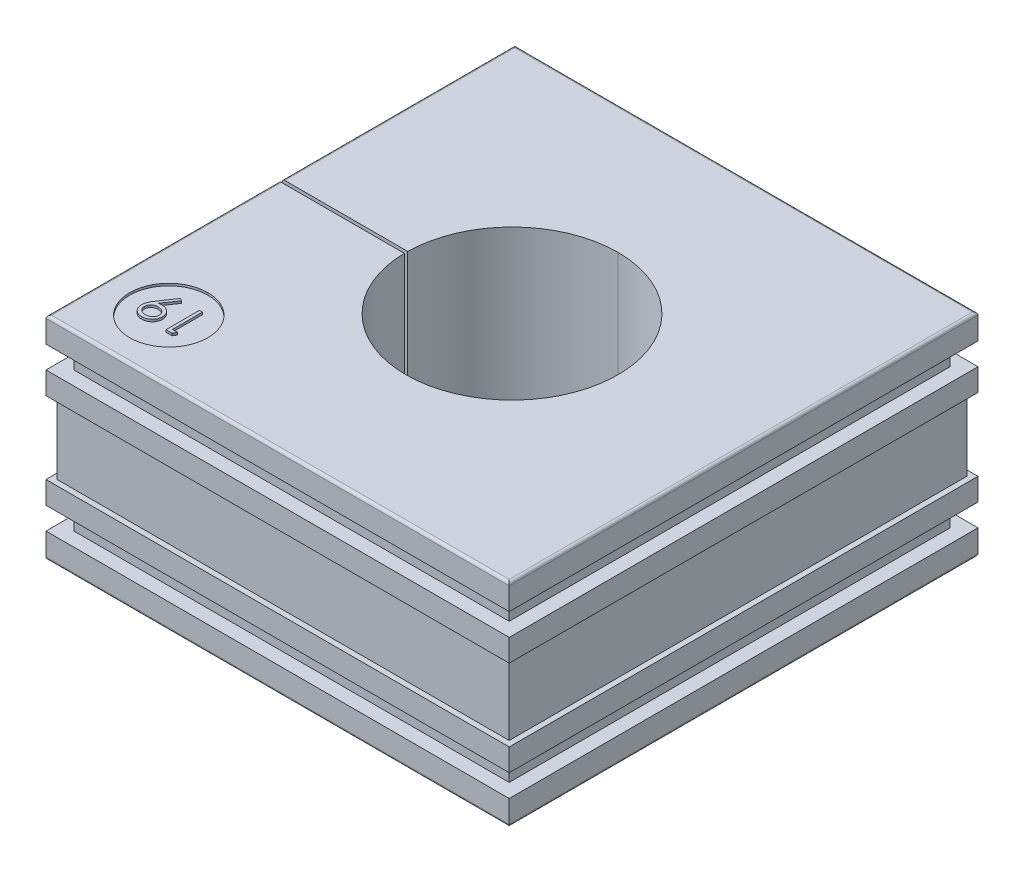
ISO-10303-21;
HEADER;
FILE_DESCRIPTION(('STEP AP214'),'2;1');
FILE_NAME('part.step','',(''),(''),'','','');
FILE_SCHEMA(('AUTOMOTIVE_DESIGN { 1 0 10303 214 1 1 1 1 }'));
ENDSEC;
DATA;
#1=APPLICATION_CONTEXT('core data for automotive mechanical design processes');
#2=APPLICATION_PROTOCOL_DEFINITION('international standard','automotive_design',2000,#1);
#3=PRODUCT_CONTEXT('',#1,'mechanical');
#4=PRODUCT('Part','Part','',(#3));
#5=PRODUCT_RELATED_PRODUCT_CATEGORY('part','',(#4));
#6=PRODUCT_DEFINITION_FORMATION('','',#4);
#7=PRODUCT_DEFINITION_CONTEXT('part definition',#1,'design');
#8=PRODUCT_DEFINITION('design','',#6,#7);
#9=PRODUCT_DEFINITION_SHAPE('','',#8);
#10=(LENGTH_UNIT() NAMED_UNIT(*) SI_UNIT(.MILLI.,.METRE.));
#11=(NAMED_UNIT(*) PLANE_ANGLE_UNIT() SI_UNIT($,.RADIAN.));
#12=(NAMED_UNIT(*) SI_UNIT($,.STERADIAN.) SOLID_ANGLE_UNIT());
#13=UNCERTAINTY_MEASURE_WITH_UNIT(LENGTH_MEASURE(1.E-05),#10,'distance_accuracy_value','');
#14=(GEOMETRIC_REPRESENTATION_CONTEXT(3) GLOBAL_UNCERTAINTY_ASSIGNED_CONTEXT((#13)) GLOBAL_UNIT_ASSIGNED_CONTEXT((#10,
#11,#12)) REPRESENTATION_CONTEXT('',''));
#15=CARTESIAN_POINT('',(0.,0.,0.));
#16=DIRECTION('',(0.,0.,1.));
#17=DIRECTION('',(1.,0.,0.));
#18=AXIS2_PLACEMENT_3D('',#15,#16,#17);
#19=CARTESIAN_POINT('',(-15.25,18.8,15.5));
#20=DIRECTION('',(0.,1.,0.));
#21=DIRECTION('',(1.,0.,0.));
#22=AXIS2_PLACEMENT_3D('',#19,#20,#21);
#23=PLANE('',#22);
#24=CARTESIAN_POINT('',(-15.6730769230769,18.8,15.9230769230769));
#25=CARTESIAN_POINT('',(-15.6735968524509,18.8,15.9028073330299));
#26=CARTESIAN_POINT('',(-15.6746222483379,18.8,15.8628319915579));
#27=CARTESIAN_POINT('',(-15.6844950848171,18.8,15.8040908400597));
#28=CARTESIAN_POINT('',(-15.7010496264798,18.8,15.7478024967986));
#29=CARTESIAN_POINT('',(-15.7230010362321,18.8,15.6934864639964));
#30=CARTESIAN_POINT('',(-15.7524604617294,18.8,15.6418454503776));
#31=CARTESIAN_POINT('',(-15.7882621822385,18.8,15.5926116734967));
#32=CARTESIAN_POINT('',(-15.8295712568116,18.8,15.5447786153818));
#33=CARTESIAN_POINT('',(-15.8777414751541,18.8,15.5010309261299));
#34=CARTESIAN_POINT('',(-15.929467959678,18.8,15.4601932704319));
#35=CARTESIAN_POINT('',(-15.9850277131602,18.8,15.4245778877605));
#36=CARTESIAN_POINT('',(-16.0433042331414,18.8,15.3947132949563));
#37=CARTESIAN_POINT('',(-16.1039233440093,18.8,15.3696681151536));
#38=CARTESIAN_POINT('',(-16.1673386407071,18.8,15.3505064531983));
#39=CARTESIAN_POINT('',(-16.2334618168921,18.8,15.3365766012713));
#40=CARTESIAN_POINT('',(-16.3023047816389,18.8,15.3289214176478));
#41=CARTESIAN_POINT('',(-16.3489409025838,18.8,15.32759558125));
#42=CARTESIAN_POINT('',(-16.3725961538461,18.8,15.3269230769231));
#43=(BOUNDED_CURVE() B_SPLINE_CURVE(3,(#24,#25,#26,#27,#28,#29,#30,#31,#32,#33,#34,#35,#36,#37,
#38,#39,#40,#41,#42),.UNSPECIFIED.,.F.,.F.) B_SPLINE_CURVE_WITH_KNOTS((4,1,1,1,1,1,1,1,1,1,1,1,
1,1,1,1,4),(0.,0.0595545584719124,0.117452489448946,0.174484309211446,0.231792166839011,
0.289281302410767,0.34877467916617,0.410547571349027,0.47472720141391,0.539757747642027,
0.604123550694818,0.668392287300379,0.732042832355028,0.796688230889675,0.862871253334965,
0.930444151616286,1.),
.UNSPECIFIED.) CURVE() GEOMETRIC_REPRESENTATION_ITEM() RATIONAL_B_SPLINE_CURVE((1.,1.,1.,1.,1.,
1.,1.,1.,1.,1.,1.,1.,1.,1.,1.,1.,1.,1.,1.)) REPRESENTATION_ITEM(''));
#44=CARTESIAN_POINT('',(-15.6730769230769,18.8,15.9230769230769));
#45=VERTEX_POINT('',#44);
#46=CARTESIAN_POINT('',(-16.3725961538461,18.8,15.3269230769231));
#47=VERTEX_POINT('',#46);
#48=EDGE_CURVE('E1191',#45,#47,#43,.T.);
#49=ORIENTED_EDGE('',*,*,#48,.T.);
#50=CARTESIAN_POINT('',(-16.3725961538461,18.8,15.3269230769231));
#51=CARTESIAN_POINT('',(-16.3964533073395,18.8,15.3275761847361));
#52=CARTESIAN_POINT('',(-16.4428950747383,18.8,15.328847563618));
#53=CARTESIAN_POINT('',(-16.5109407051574,18.8,15.3365510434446));
#54=CARTESIAN_POINT('',(-16.575132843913,18.8,15.3503104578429));
#55=CARTESIAN_POINT('',(-16.6358846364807,18.8,15.3697406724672));
#56=CARTESIAN_POINT('',(-16.6931225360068,18.8,15.3943548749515));
#57=CARTESIAN_POINT('',(-16.7468645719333,18.8,15.4243513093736));
#58=CARTESIAN_POINT('',(-16.7965617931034,18.8,15.4603871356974));
#59=CARTESIAN_POINT('',(-16.8423911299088,18.8,15.5008921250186));
#60=CARTESIAN_POINT('',(-16.88398264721,18.8,15.5452839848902));
#61=CARTESIAN_POINT('',(-16.919844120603,18.8,15.5928457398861));
#62=CARTESIAN_POINT('',(-16.9508936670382,18.8,15.6420998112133));
#63=CARTESIAN_POINT('',(-16.9756642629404,18.8,15.6940545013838));
#64=CARTESIAN_POINT('',(-16.9956268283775,18.8,15.7478598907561));
#65=CARTESIAN_POINT('',(-17.0095560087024,18.8,15.8042941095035));
#66=CARTESIAN_POINT('',(-17.0172492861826,18.8,15.8629675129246));
#67=CARTESIAN_POINT('',(-17.0185631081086,18.8,15.9028230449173));
#68=CARTESIAN_POINT('',(-17.0192307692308,18.8,15.9230769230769));
#69=(BOUNDED_CURVE() B_SPLINE_CURVE(3,(#50,#51,#52,#53,#54,#55,#56,#57,#58,#59,#60,#61,#62,#63,
#64,#65,#66,#67,#68),.UNSPECIFIED.,.F.,.F.) B_SPLINE_CURVE_WITH_KNOTS((4,1,1,1,1,1,1,1,1,1,1,1,
1,1,1,1,4),(0.,0.0727329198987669,0.141586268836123,0.20841961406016,0.272536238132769,
0.335721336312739,0.398059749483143,0.45974872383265,0.522480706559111,0.584266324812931,
0.644845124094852,0.703814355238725,0.761443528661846,0.819981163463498,0.878483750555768,
0.938247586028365,1.),
.UNSPECIFIED.) CURVE() GEOMETRIC_REPRESENTATION_ITEM() RATIONAL_B_SPLINE_CURVE((1.,1.,1.,1.,1.,
1.,1.,1.,1.,1.,1.,1.,1.,1.,1.,1.,1.,1.,1.)) REPRESENTATION_ITEM(''));
#70=CARTESIAN_POINT('',(-17.0192307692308,18.8,15.9230769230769));
#71=VERTEX_POINT('',#70);
#72=EDGE_CURVE('E1525',#47,#71,#69,.T.);
#73=ORIENTED_EDGE('',*,*,#72,.T.);
#74=CARTESIAN_POINT('',(-17.0192307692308,18.8,15.9230769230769));
#75=CARTESIAN_POINT('',(-17.0186573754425,18.8,15.943339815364));
#76=CARTESIAN_POINT('',(-17.0175274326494,18.8,15.9832703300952));
#77=CARTESIAN_POINT('',(-17.0084438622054,18.8,16.0420226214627));
#78=CARTESIAN_POINT('',(-16.9925119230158,18.8,16.0983483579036));
#79=CARTESIAN_POINT('',(-16.9709045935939,18.8,16.1526165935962));
#80=CARTESIAN_POINT('',(-16.9430332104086,18.8,16.2045847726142));
#81=CARTESIAN_POINT('',(-16.9091375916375,18.8,16.2541021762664));
#82=CARTESIAN_POINT('',(-16.8689986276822,18.8,16.3013509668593));
#83=CARTESIAN_POINT('',(-16.823262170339,18.8,16.3457391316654));
#84=CARTESIAN_POINT('',(-16.773074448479,18.8,16.3865272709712));
#85=CARTESIAN_POINT('',(-16.7194253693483,18.8,16.4219248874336));
#86=CARTESIAN_POINT('',(-16.6634911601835,18.8,16.4523504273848));
#87=CARTESIAN_POINT('',(-16.6046362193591,18.8,16.4761706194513));
#88=CARTESIAN_POINT('',(-16.5436593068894,18.8,16.4957241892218));
#89=CARTESIAN_POINT('',(-16.4798897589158,18.8,16.5095567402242));
#90=CARTESIAN_POINT('',(-16.4132501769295,18.8,16.5172653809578));
#91=CARTESIAN_POINT('',(-16.3680079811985,18.8,16.5185672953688));
#92=CARTESIAN_POINT('',(-16.3449519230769,18.8,16.5192307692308));
#93=(BOUNDED_CURVE() B_SPLINE_CURVE(3,(#74,#75,#76,#77,#78,#79,#80,#81,#82,#83,#84,#85,#86,#87,
#88,#89,#90,#91,#92),.UNSPECIFIED.,.F.,.F.) B_SPLINE_CURVE_WITH_KNOTS((4,1,1,1,1,1,1,1,1,1,1,1,
1,1,1,1,4),(0.,0.0607377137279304,0.119691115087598,0.177691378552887,0.235912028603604,
0.294490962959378,0.354131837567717,0.41550179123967,0.480063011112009,0.544975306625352,
0.609110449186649,0.67253004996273,0.735550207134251,0.799185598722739,0.86433366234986,
0.930862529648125,1.),
.UNSPECIFIED.) CURVE() GEOMETRIC_REPRESENTATION_ITEM() RATIONAL_B_SPLINE_CURVE((1.,1.,1.,1.,1.,
1.,1.,1.,1.,1.,1.,1.,1.,1.,1.,1.,1.,1.,1.)) REPRESENTATION_ITEM(''));
#94=CARTESIAN_POINT('',(-16.3449519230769,18.8,16.5192307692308));
#95=VERTEX_POINT('',#94);
#96=EDGE_CURVE('E46',#71,#95,#93,.T.);
#97=ORIENTED_EDGE('',*,*,#96,.T.);
#98=CARTESIAN_POINT('',(-16.3449519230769,18.8,16.5192307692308));
#99=CARTESIAN_POINT('',(-16.3220963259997,18.8,16.5185663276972));
#100=CARTESIAN_POINT('',(-16.2772538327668,18.8,16.5172626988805));
#101=CARTESIAN_POINT('',(-16.2112074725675,18.8,16.5095701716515));
#102=CARTESIAN_POINT('',(-16.1478661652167,18.8,16.4956352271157));
#103=CARTESIAN_POINT('',(-16.0870774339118,18.8,16.4761610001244));
#104=CARTESIAN_POINT('',(-16.0283466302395,18.8,16.4524830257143));
#105=CARTESIAN_POINT('',(-15.9728576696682,18.8,16.4219256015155));
#106=CARTESIAN_POINT('',(-15.919767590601,18.8,16.3863383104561));
#107=CARTESIAN_POINT('',(-15.8695943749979,18.8,16.3457916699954));
#108=CARTESIAN_POINT('',(-15.8239580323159,18.8,16.3011375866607));
#109=CARTESIAN_POINT('',(-15.7831235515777,18.8,16.2543127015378));
#110=CARTESIAN_POINT('',(-15.7493055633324,18.8,16.2045580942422));
#111=CARTESIAN_POINT('',(-15.7213948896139,18.8,16.1526236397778));
#112=CARTESIAN_POINT('',(-15.6997979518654,18.8,16.098346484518));
#113=CARTESIAN_POINT('',(-15.683863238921,18.8,16.042023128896));
#114=CARTESIAN_POINT('',(-15.6747804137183,18.8,15.9832701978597));
#115=CARTESIAN_POINT('',(-15.6736503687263,18.8,15.9433397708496));
#116=CARTESIAN_POINT('',(-15.6730769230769,18.8,15.9230769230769));
#117=(BOUNDED_CURVE() B_SPLINE_CURVE(3,(#98,#99,#100,#101,#102,#103,#104,#105,#106,#107,#108,
#109,#110,#111,#112,#113,#114,#115,#116),.UNSPECIFIED.,.F.,.F.) B_SPLINE_CURVE_WITH_KNOTS((4,1,
1,1,1,1,1,1,1,1,1,1,1,1,1,1,4),(0.,0.0687038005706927,0.134796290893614,0.199514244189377,
0.263304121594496,0.326477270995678,0.389521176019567,0.453311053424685,0.51838093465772,
0.583098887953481,0.645008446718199,0.70479410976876,0.763515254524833,0.821877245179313,
0.880018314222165,0.939114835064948,1.),
.UNSPECIFIED.) CURVE() GEOMETRIC_REPRESENTATION_ITEM() RATIONAL_B_SPLINE_CURVE((1.,1.,1.,1.,1.,
1.,1.,1.,1.,1.,1.,1.,1.,1.,1.,1.,1.,1.,1.)) REPRESENTATION_ITEM(''));
#118=EDGE_CURVE('E9',#95,#45,#117,.T.);
#119=ORIENTED_EDGE('',*,*,#118,.T.);
#120=EDGE_LOOP('',(#49,#73,#97,#119));
#121=FACE_BOUND('',#120,.T.);
#122=ADVANCED_FACE('F15',(#121),#23,.T.);
#123=CARTESIAN_POINT('',(-16.3449519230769,19.,16.5192307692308));
#124=CARTESIAN_POINT('',(-16.3449519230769,18.8,16.5192307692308));
#125=CARTESIAN_POINT('',(-16.3220963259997,19.,16.5185663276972));
#126=CARTESIAN_POINT('',(-16.3220963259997,18.8,16.5185663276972));
#127=CARTESIAN_POINT('',(-16.2772538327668,19.,16.5172626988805));
#128=CARTESIAN_POINT('',(-16.2772538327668,18.8,16.5172626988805));
#129=CARTESIAN_POINT('',(-16.2112074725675,19.,16.5095701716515));
#130=CARTESIAN_POINT('',(-16.2112074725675,18.8,16.5095701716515));
#131=CARTESIAN_POINT('',(-16.1478661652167,19.,16.4956352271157));
#132=CARTESIAN_POINT('',(-16.1478661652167,18.8,16.4956352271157));
#133=CARTESIAN_POINT('',(-16.0870774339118,19.,16.4761610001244));
#134=CARTESIAN_POINT('',(-16.0870774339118,18.8,16.4761610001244));
#135=CARTESIAN_POINT('',(-16.0283466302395,19.,16.4524830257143));
#136=CARTESIAN_POINT('',(-16.0283466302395,18.8,16.4524830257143));
#137=CARTESIAN_POINT('',(-15.9728576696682,19.,16.4219256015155));
#138=CARTESIAN_POINT('',(-15.9728576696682,18.8,16.4219256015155));
#139=CARTESIAN_POINT('',(-15.919767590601,19.,16.3863383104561));
#140=CARTESIAN_POINT('',(-15.919767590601,18.8,16.3863383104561));
#141=CARTESIAN_POINT('',(-15.8695943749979,19.,16.3457916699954));
#142=CARTESIAN_POINT('',(-15.8695943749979,18.8,16.3457916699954));
#143=CARTESIAN_POINT('',(-15.8239580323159,19.,16.3011375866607));
#144=CARTESIAN_POINT('',(-15.8239580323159,18.8,16.3011375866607));
#145=CARTESIAN_POINT('',(-15.7831235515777,19.,16.2543127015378));
#146=CARTESIAN_POINT('',(-15.7831235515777,18.8,16.2543127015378));
#147=CARTESIAN_POINT('',(-15.7493055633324,19.,16.2045580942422));
#148=CARTESIAN_POINT('',(-15.7493055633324,18.8,16.2045580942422));
#149=CARTESIAN_POINT('',(-15.7213948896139,19.,16.1526236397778));
#150=CARTESIAN_POINT('',(-15.7213948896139,18.8,16.1526236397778));
#151=CARTESIAN_POINT('',(-15.6997979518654,19.,16.098346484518));
#152=CARTESIAN_POINT('',(-15.6997979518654,18.8,16.098346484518));
#153=CARTESIAN_POINT('',(-15.683863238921,19.,16.042023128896));
#154=CARTESIAN_POINT('',(-15.683863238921,18.8,16.042023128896));
#155=CARTESIAN_POINT('',(-15.6747804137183,19.,15.9832701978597));
#156=CARTESIAN_POINT('',(-15.6747804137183,18.8,15.9832701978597));
#157=CARTESIAN_POINT('',(-15.6736503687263,19.,15.9433397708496));
#158=CARTESIAN_POINT('',(-15.6736503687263,18.8,15.9433397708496));
#159=CARTESIAN_POINT('',(-15.6730769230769,19.,15.9230769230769));
#160=CARTESIAN_POINT('',(-15.6730769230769,18.8,15.9230769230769));
#161=(BOUNDED_SURFACE() B_SPLINE_SURFACE(3,1,((#123,#124),(#125,#126),(#127,#128),(#129,#130),
(#131,#132),(#133,#134),(#135,#136),(#137,#138),(#139,#140),(#141,#142),(#143,#144),(#145,#146),
(#147,#148),(#149,#150),(#151,#152),(#153,#154),(#155,#156),(#157,#158),(#159,#160)),
.UNSPECIFIED.,.F.,.F.,.F.) B_SPLINE_SURFACE_WITH_KNOTS((4,1,1,1,1,1,1,1,1,1,1,1,1,1,1,1,4),(2,
2),(0.,0.0687038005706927,0.134796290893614,0.199514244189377,0.263304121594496,
0.326477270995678,0.389521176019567,0.453311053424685,0.51838093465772,0.583098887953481,
0.645008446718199,0.70479410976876,0.763515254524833,0.821877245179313,0.880018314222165,
0.939114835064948,1.),(0.,1.),
.UNSPECIFIED.) GEOMETRIC_REPRESENTATION_ITEM() RATIONAL_B_SPLINE_SURFACE(((1.,1.),(1.,1.),(1.,
1.),(1.,1.),(1.,1.),(1.,1.),(1.,1.),(1.,1.),(1.,1.),(1.,1.),(1.,1.),(1.,1.),(1.,1.),(1.,1.),(1.,
1.),(1.,1.),(1.,1.),(1.,1.),(1.,1.))) REPRESENTATION_ITEM('') SURFACE());
#162=DIRECTION('',(0.,-1.,0.));
#163=VECTOR('',#162,1.);
#164=CARTESIAN_POINT('',(-16.3449519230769,19.,16.5192307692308));
#165=LINE('',#164,#163);
#166=CARTESIAN_POINT('',(-16.3449519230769,19.,16.5192307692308));
#167=VERTEX_POINT('',#166);
#168=EDGE_CURVE('E28',#167,#95,#165,.T.);
#169=CARTESIAN_POINT('',(-16.3449519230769,19.,16.5192307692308));
#170=CARTESIAN_POINT('',(-16.3220963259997,19.,16.5185663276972));
#171=CARTESIAN_POINT('',(-16.2772538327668,19.,16.5172626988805));
#172=CARTESIAN_POINT('',(-16.2112074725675,19.,16.5095701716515));
#173=CARTESIAN_POINT('',(-16.1478661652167,19.,16.4956352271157));
#174=CARTESIAN_POINT('',(-16.0870774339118,19.,16.4761610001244));
#175=CARTESIAN_POINT('',(-16.0283466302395,19.,16.4524830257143));
#176=CARTESIAN_POINT('',(-15.9728576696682,19.,16.4219256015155));
#177=CARTESIAN_POINT('',(-15.919767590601,19.,16.3863383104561));
#178=CARTESIAN_POINT('',(-15.8695943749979,19.,16.3457916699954));
#179=CARTESIAN_POINT('',(-15.8239580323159,19.,16.3011375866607));
#180=CARTESIAN_POINT('',(-15.7831235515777,19.,16.2543127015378));
#181=CARTESIAN_POINT('',(-15.7493055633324,19.,16.2045580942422));
#182=CARTESIAN_POINT('',(-15.7213948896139,19.,16.1526236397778));
#183=CARTESIAN_POINT('',(-15.6997979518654,19.,16.098346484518));
#184=CARTESIAN_POINT('',(-15.683863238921,19.,16.042023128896));
#185=CARTESIAN_POINT('',(-15.6747804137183,19.,15.9832701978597));
#186=CARTESIAN_POINT('',(-15.6736503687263,19.,15.9433397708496));
#187=CARTESIAN_POINT('',(-15.6730769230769,19.,15.9230769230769));
#188=(BOUNDED_CURVE() B_SPLINE_CURVE(3,(#169,#170,#171,#172,#173,#174,#175,#176,#177,#178,#179,
#180,#181,#182,#183,#184,#185,#186,#187),.UNSPECIFIED.,.F.,.F.) B_SPLINE_CURVE_WITH_KNOTS((4,1,
1,1,1,1,1,1,1,1,1,1,1,1,1,1,4),(0.,0.0687038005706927,0.134796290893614,0.199514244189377,
0.263304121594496,0.326477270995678,0.389521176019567,0.453311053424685,0.51838093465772,
0.583098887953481,0.645008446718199,0.70479410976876,0.763515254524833,0.821877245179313,
0.880018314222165,0.939114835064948,1.),
.UNSPECIFIED.) CURVE() GEOMETRIC_REPRESENTATION_ITEM() RATIONAL_B_SPLINE_CURVE((1.,1.,1.,1.,1.,
1.,1.,1.,1.,1.,1.,1.,1.,1.,1.,1.,1.,1.,1.)) REPRESENTATION_ITEM(''));
#189=CARTESIAN_POINT('',(-15.6730769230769,19.,15.9230769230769));
#190=VERTEX_POINT('',#189);
#191=EDGE_CURVE('E1480',#167,#190,#188,.T.);
#192=DIRECTION('',(0.,-1.,0.));
#193=VECTOR('',#192,1.);
#194=CARTESIAN_POINT('',(-15.6730769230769,19.,15.9230769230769));
#195=LINE('',#194,#193);
#196=EDGE_CURVE('E1197',#190,#45,#195,.T.);
#197=ORIENTED_EDGE('',*,*,#118,.F.);
#198=ORIENTED_EDGE('',*,*,#168,.F.);
#199=ORIENTED_EDGE('',*,*,#191,.T.);
#200=ORIENTED_EDGE('',*,*,#196,.T.);
#201=EDGE_LOOP('',(#197,#198,#199,#200));
#202=FACE_BOUND('',#201,.T.);
#203=ADVANCED_FACE('F17',(#202),#161,.T.);
#204=CARTESIAN_POINT('',(-17.0192307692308,19.,15.9230769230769));
#205=CARTESIAN_POINT('',(-17.0192307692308,18.8,15.9230769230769));
#206=CARTESIAN_POINT('',(-17.0186573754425,19.,15.943339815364));
#207=CARTESIAN_POINT('',(-17.0186573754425,18.8,15.943339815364));
#208=CARTESIAN_POINT('',(-17.0175274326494,19.,15.9832703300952));
#209=CARTESIAN_POINT('',(-17.0175274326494,18.8,15.9832703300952));
#210=CARTESIAN_POINT('',(-17.0084438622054,19.,16.0420226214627));
#211=CARTESIAN_POINT('',(-17.0084438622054,18.8,16.0420226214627));
#212=CARTESIAN_POINT('',(-16.9925119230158,19.,16.0983483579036));
#213=CARTESIAN_POINT('',(-16.9925119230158,18.8,16.0983483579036));
#214=CARTESIAN_POINT('',(-16.9709045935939,19.,16.1526165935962));
#215=CARTESIAN_POINT('',(-16.9709045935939,18.8,16.1526165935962));
#216=CARTESIAN_POINT('',(-16.9430332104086,19.,16.2045847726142));
#217=CARTESIAN_POINT('',(-16.9430332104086,18.8,16.2045847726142));
#218=CARTESIAN_POINT('',(-16.9091375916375,19.,16.2541021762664));
#219=CARTESIAN_POINT('',(-16.9091375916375,18.8,16.2541021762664));
#220=CARTESIAN_POINT('',(-16.8689986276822,19.,16.3013509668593));
#221=CARTESIAN_POINT('',(-16.8689986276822,18.8,16.3013509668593));
#222=CARTESIAN_POINT('',(-16.823262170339,19.,16.3457391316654));
#223=CARTESIAN_POINT('',(-16.823262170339,18.8,16.3457391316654));
#224=CARTESIAN_POINT('',(-16.773074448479,19.,16.3865272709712));
#225=CARTESIAN_POINT('',(-16.773074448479,18.8,16.3865272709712));
#226=CARTESIAN_POINT('',(-16.7194253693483,19.,16.4219248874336));
#227=CARTESIAN_POINT('',(-16.7194253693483,18.8,16.4219248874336));
#228=CARTESIAN_POINT('',(-16.6634911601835,19.,16.4523504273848));
#229=CARTESIAN_POINT('',(-16.6634911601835,18.8,16.4523504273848));
#230=CARTESIAN_POINT('',(-16.6046362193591,19.,16.4761706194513));
#231=CARTESIAN_POINT('',(-16.6046362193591,18.8,16.4761706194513));
#232=CARTESIAN_POINT('',(-16.5436593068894,19.,16.4957241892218));
#233=CARTESIAN_POINT('',(-16.5436593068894,18.8,16.4957241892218));
#234=CARTESIAN_POINT('',(-16.4798897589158,19.,16.5095567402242));
#235=CARTESIAN_POINT('',(-16.4798897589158,18.8,16.5095567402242));
#236=CARTESIAN_POINT('',(-16.4132501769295,19.,16.5172653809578));
#237=CARTESIAN_POINT('',(-16.4132501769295,18.8,16.5172653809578));
#238=CARTESIAN_POINT('',(-16.3680079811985,19.,16.5185672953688));
#239=CARTESIAN_POINT('',(-16.3680079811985,18.8,16.5185672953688));
#240=CARTESIAN_POINT('',(-16.3449519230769,19.,16.5192307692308));
#241=CARTESIAN_POINT('',(-16.3449519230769,18.8,16.5192307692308));
#242=(BOUNDED_SURFACE() B_SPLINE_SURFACE(3,1,((#204,#205),(#206,#207),(#208,#209),(#210,#211),
(#212,#213),(#214,#215),(#216,#217),(#218,#219),(#220,#221),(#222,#223),(#224,#225),(#226,#227),
(#228,#229),(#230,#231),(#232,#233),(#234,#235),(#236,#237),(#238,#239),(#240,#241)),
.UNSPECIFIED.,.F.,.F.,.F.) B_SPLINE_SURFACE_WITH_KNOTS((4,1,1,1,1,1,1,1,1,1,1,1,1,1,1,1,4),(2,
2),(0.,0.0607377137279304,0.119691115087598,0.177691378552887,0.235912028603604,
0.294490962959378,0.354131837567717,0.41550179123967,0.480063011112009,0.544975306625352,
0.609110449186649,0.67253004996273,0.735550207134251,0.799185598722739,0.86433366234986,
0.930862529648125,1.),(0.,1.),
.UNSPECIFIED.) GEOMETRIC_REPRESENTATION_ITEM() RATIONAL_B_SPLINE_SURFACE(((1.,1.),(1.,1.),(1.,
1.),(1.,1.),(1.,1.),(1.,1.),(1.,1.),(1.,1.),(1.,1.),(1.,1.),(1.,1.),(1.,1.),(1.,1.),(1.,1.),(1.,
1.),(1.,1.),(1.,1.),(1.,1.),(1.,1.))) REPRESENTATION_ITEM('') SURFACE());
#243=DIRECTION('',(0.,-1.,0.));
#244=VECTOR('',#243,1.);
#245=CARTESIAN_POINT('',(-17.0192307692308,19.,15.9230769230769));
#246=LINE('',#245,#244);
#247=CARTESIAN_POINT('',(-17.0192307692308,19.,15.9230769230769));
#248=VERTEX_POINT('',#247);
#249=EDGE_CURVE('E1531',#248,#71,#246,.T.);
#250=CARTESIAN_POINT('',(-17.0192307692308,19.,15.9230769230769));
#251=CARTESIAN_POINT('',(-17.0186573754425,19.,15.943339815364));
#252=CARTESIAN_POINT('',(-17.0175274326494,19.,15.9832703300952));
#253=CARTESIAN_POINT('',(-17.0084438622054,19.,16.0420226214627));
#254=CARTESIAN_POINT('',(-16.9925119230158,19.,16.0983483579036));
#255=CARTESIAN_POINT('',(-16.9709045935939,19.,16.1526165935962));
#256=CARTESIAN_POINT('',(-16.9430332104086,19.,16.2045847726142));
#257=CARTESIAN_POINT('',(-16.9091375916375,19.,16.2541021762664));
#258=CARTESIAN_POINT('',(-16.8689986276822,19.,16.3013509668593));
#259=CARTESIAN_POINT('',(-16.823262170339,19.,16.3457391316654));
#260=CARTESIAN_POINT('',(-16.773074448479,19.,16.3865272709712));
#261=CARTESIAN_POINT('',(-16.7194253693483,19.,16.4219248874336));
#262=CARTESIAN_POINT('',(-16.6634911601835,19.,16.4523504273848));
#263=CARTESIAN_POINT('',(-16.6046362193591,19.,16.4761706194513));
#264=CARTESIAN_POINT('',(-16.5436593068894,19.,16.4957241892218));
#265=CARTESIAN_POINT('',(-16.4798897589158,19.,16.5095567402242));
#266=CARTESIAN_POINT('',(-16.4132501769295,19.,16.5172653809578));
#267=CARTESIAN_POINT('',(-16.3680079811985,19.,16.5185672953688));
#268=CARTESIAN_POINT('',(-16.3449519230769,19.,16.5192307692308));
#269=(BOUNDED_CURVE() B_SPLINE_CURVE(3,(#250,#251,#252,#253,#254,#255,#256,#257,#258,#259,#260,
#261,#262,#263,#264,#265,#266,#267,#268),.UNSPECIFIED.,.F.,.F.) B_SPLINE_CURVE_WITH_KNOTS((4,1,
1,1,1,1,1,1,1,1,1,1,1,1,1,1,4),(0.,0.0607377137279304,0.119691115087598,0.177691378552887,
0.235912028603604,0.294490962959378,0.354131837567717,0.41550179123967,0.480063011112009,
0.544975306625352,0.609110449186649,0.67253004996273,0.735550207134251,0.799185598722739,
0.86433366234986,0.930862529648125,1.),
.UNSPECIFIED.) CURVE() GEOMETRIC_REPRESENTATION_ITEM() RATIONAL_B_SPLINE_CURVE((1.,1.,1.,1.,1.,
1.,1.,1.,1.,1.,1.,1.,1.,1.,1.,1.,1.,1.,1.)) REPRESENTATION_ITEM(''));
#270=EDGE_CURVE('E1489',#248,#167,#269,.T.);
#271=ORIENTED_EDGE('',*,*,#96,.F.);
#272=ORIENTED_EDGE('',*,*,#249,.F.);
#273=ORIENTED_EDGE('',*,*,#270,.T.);
#274=ORIENTED_EDGE('',*,*,#168,.T.);
#275=EDGE_LOOP('',(#271,#272,#273,#274));
#276=FACE_BOUND('',#275,.T.);
#277=ADVANCED_FACE('F1545',(#276),#242,.T.);
#278=CARTESIAN_POINT('',(-16.3725961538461,19.,15.3269230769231));
#279=CARTESIAN_POINT('',(-16.3725961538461,18.8,15.3269230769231));
#280=CARTESIAN_POINT('',(-16.3964533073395,19.,15.3275761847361));
#281=CARTESIAN_POINT('',(-16.3964533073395,18.8,15.3275761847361));
#282=CARTESIAN_POINT('',(-16.4428950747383,19.,15.328847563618));
#283=CARTESIAN_POINT('',(-16.4428950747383,18.8,15.328847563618));
#284=CARTESIAN_POINT('',(-16.5109407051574,19.,15.3365510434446));
#285=CARTESIAN_POINT('',(-16.5109407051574,18.8,15.3365510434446));
#286=CARTESIAN_POINT('',(-16.575132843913,19.,15.3503104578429));
#287=CARTESIAN_POINT('',(-16.575132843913,18.8,15.3503104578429));
#288=CARTESIAN_POINT('',(-16.6358846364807,19.,15.3697406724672));
#289=CARTESIAN_POINT('',(-16.6358846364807,18.8,15.3697406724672));
#290=CARTESIAN_POINT('',(-16.6931225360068,19.,15.3943548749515));
#291=CARTESIAN_POINT('',(-16.6931225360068,18.8,15.3943548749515));
#292=CARTESIAN_POINT('',(-16.7468645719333,19.,15.4243513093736));
#293=CARTESIAN_POINT('',(-16.7468645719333,18.8,15.4243513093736));
#294=CARTESIAN_POINT('',(-16.7965617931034,19.,15.4603871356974));
#295=CARTESIAN_POINT('',(-16.7965617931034,18.8,15.4603871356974));
#296=CARTESIAN_POINT('',(-16.8423911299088,19.,15.5008921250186));
#297=CARTESIAN_POINT('',(-16.8423911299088,18.8,15.5008921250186));
#298=CARTESIAN_POINT('',(-16.88398264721,19.,15.5452839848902));
#299=CARTESIAN_POINT('',(-16.88398264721,18.8,15.5452839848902));
#300=CARTESIAN_POINT('',(-16.919844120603,19.,15.5928457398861));
#301=CARTESIAN_POINT('',(-16.919844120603,18.8,15.5928457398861));
#302=CARTESIAN_POINT('',(-16.9508936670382,19.,15.6420998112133));
#303=CARTESIAN_POINT('',(-16.9508936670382,18.8,15.6420998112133));
#304=CARTESIAN_POINT('',(-16.9756642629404,19.,15.6940545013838));
#305=CARTESIAN_POINT('',(-16.9756642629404,18.8,15.6940545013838));
#306=CARTESIAN_POINT('',(-16.9956268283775,19.,15.7478598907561));
#307=CARTESIAN_POINT('',(-16.9956268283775,18.8,15.7478598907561));
#308=CARTESIAN_POINT('',(-17.0095560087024,19.,15.8042941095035));
#309=CARTESIAN_POINT('',(-17.0095560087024,18.8,15.8042941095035));
#310=CARTESIAN_POINT('',(-17.0172492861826,19.,15.8629675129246));
#311=CARTESIAN_POINT('',(-17.0172492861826,18.8,15.8629675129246));
#312=CARTESIAN_POINT('',(-17.0185631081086,19.,15.9028230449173));
#313=CARTESIAN_POINT('',(-17.0185631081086,18.8,15.9028230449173));
#314=CARTESIAN_POINT('',(-17.0192307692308,19.,15.9230769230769));
#315=CARTESIAN_POINT('',(-17.0192307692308,18.8,15.9230769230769));
#316=(BOUNDED_SURFACE() B_SPLINE_SURFACE(3,1,((#278,#279),(#280,#281),(#282,#283),(#284,#285),
(#286,#287),(#288,#289),(#290,#291),(#292,#293),(#294,#295),(#296,#297),(#298,#299),(#300,#301),
(#302,#303),(#304,#305),(#306,#307),(#308,#309),(#310,#311),(#312,#313),(#314,#315)),
.UNSPECIFIED.,.F.,.F.,.F.) B_SPLINE_SURFACE_WITH_KNOTS((4,1,1,1,1,1,1,1,1,1,1,1,1,1,1,1,4),(2,
2),(0.,0.0727329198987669,0.141586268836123,0.20841961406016,0.272536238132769,
0.335721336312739,0.398059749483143,0.45974872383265,0.522480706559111,0.584266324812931,
0.644845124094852,0.703814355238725,0.761443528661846,0.819981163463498,0.878483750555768,
0.938247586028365,1.),(0.,1.),
.UNSPECIFIED.) GEOMETRIC_REPRESENTATION_ITEM() RATIONAL_B_SPLINE_SURFACE(((1.,1.),(1.,1.),(1.,
1.),(1.,1.),(1.,1.),(1.,1.),(1.,1.),(1.,1.),(1.,1.),(1.,1.),(1.,1.),(1.,1.),(1.,1.),(1.,1.),(1.,
1.),(1.,1.),(1.,1.),(1.,1.),(1.,1.))) REPRESENTATION_ITEM('') SURFACE());
#317=DIRECTION('',(0.,-1.,0.));
#318=VECTOR('',#317,1.);
#319=CARTESIAN_POINT('',(-16.3725961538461,19.,15.3269230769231));
#320=LINE('',#319,#318);
#321=CARTESIAN_POINT('',(-16.3725961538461,19.,15.3269230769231));
#322=VERTEX_POINT('',#321);
#323=EDGE_CURVE('E1521',#322,#47,#320,.T.);
#324=CARTESIAN_POINT('',(-16.3725961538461,19.,15.3269230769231));
#325=CARTESIAN_POINT('',(-16.3964533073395,19.,15.3275761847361));
#326=CARTESIAN_POINT('',(-16.4428950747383,19.,15.328847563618));
#327=CARTESIAN_POINT('',(-16.5109407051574,19.,15.3365510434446));
#328=CARTESIAN_POINT('',(-16.575132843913,19.,15.3503104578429));
#329=CARTESIAN_POINT('',(-16.6358846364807,19.,15.3697406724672));
#330=CARTESIAN_POINT('',(-16.6931225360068,19.,15.3943548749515));
#331=CARTESIAN_POINT('',(-16.7468645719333,19.,15.4243513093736));
#332=CARTESIAN_POINT('',(-16.7965617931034,19.,15.4603871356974));
#333=CARTESIAN_POINT('',(-16.8423911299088,19.,15.5008921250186));
#334=CARTESIAN_POINT('',(-16.88398264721,19.,15.5452839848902));
#335=CARTESIAN_POINT('',(-16.919844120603,19.,15.5928457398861));
#336=CARTESIAN_POINT('',(-16.9508936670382,19.,15.6420998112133));
#337=CARTESIAN_POINT('',(-16.9756642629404,19.,15.6940545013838));
#338=CARTESIAN_POINT('',(-16.9956268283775,19.,15.7478598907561));
#339=CARTESIAN_POINT('',(-17.0095560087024,19.,15.8042941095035));
#340=CARTESIAN_POINT('',(-17.0172492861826,19.,15.8629675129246));
#341=CARTESIAN_POINT('',(-17.0185631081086,19.,15.9028230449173));
#342=CARTESIAN_POINT('',(-17.0192307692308,19.,15.9230769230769));
#343=(BOUNDED_CURVE() B_SPLINE_CURVE(3,(#324,#325,#326,#327,#328,#329,#330,#331,#332,#333,#334,
#335,#336,#337,#338,#339,#340,#341,#342),.UNSPECIFIED.,.F.,.F.) B_SPLINE_CURVE_WITH_KNOTS((4,1,
1,1,1,1,1,1,1,1,1,1,1,1,1,1,4),(0.,0.0727329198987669,0.141586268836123,0.20841961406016,
0.272536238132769,0.335721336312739,0.398059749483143,0.45974872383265,0.522480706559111,
0.584266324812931,0.644845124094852,0.703814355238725,0.761443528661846,0.819981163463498,
0.878483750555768,0.938247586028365,1.),
.UNSPECIFIED.) CURVE() GEOMETRIC_REPRESENTATION_ITEM() RATIONAL_B_SPLINE_CURVE((1.,1.,1.,1.,1.,
1.,1.,1.,1.,1.,1.,1.,1.,1.,1.,1.,1.,1.,1.)) REPRESENTATION_ITEM(''));
#344=EDGE_CURVE('E1465',#322,#248,#343,.T.);
#345=ORIENTED_EDGE('',*,*,#72,.F.);
#346=ORIENTED_EDGE('',*,*,#323,.F.);
#347=ORIENTED_EDGE('',*,*,#344,.T.);
#348=ORIENTED_EDGE('',*,*,#249,.T.);
#349=EDGE_LOOP('',(#345,#346,#347,#348));
#350=FACE_BOUND('',#349,.T.);
#351=ADVANCED_FACE('F1551',(#350),#316,.T.);
#352=CARTESIAN_POINT('',(-15.6730769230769,19.,15.9230769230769));
#353=CARTESIAN_POINT('',(-15.6730769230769,18.8,15.9230769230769));
#354=CARTESIAN_POINT('',(-15.6735968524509,19.,15.9028073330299));
#355=CARTESIAN_POINT('',(-15.6735968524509,18.8,15.9028073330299));
#356=CARTESIAN_POINT('',(-15.6746222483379,19.,15.8628319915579));
#357=CARTESIAN_POINT('',(-15.6746222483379,18.8,15.8628319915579));
#358=CARTESIAN_POINT('',(-15.6844950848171,19.,15.8040908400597));
#359=CARTESIAN_POINT('',(-15.6844950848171,18.8,15.8040908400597));
#360=CARTESIAN_POINT('',(-15.7010496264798,19.,15.7478024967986));
#361=CARTESIAN_POINT('',(-15.7010496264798,18.8,15.7478024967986));
#362=CARTESIAN_POINT('',(-15.7230010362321,19.,15.6934864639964));
#363=CARTESIAN_POINT('',(-15.7230010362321,18.8,15.6934864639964));
#364=CARTESIAN_POINT('',(-15.7524604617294,19.,15.6418454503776));
#365=CARTESIAN_POINT('',(-15.7524604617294,18.8,15.6418454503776));
#366=CARTESIAN_POINT('',(-15.7882621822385,19.,15.5926116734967));
#367=CARTESIAN_POINT('',(-15.7882621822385,18.8,15.5926116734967));
#368=CARTESIAN_POINT('',(-15.8295712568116,19.,15.5447786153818));
#369=CARTESIAN_POINT('',(-15.8295712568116,18.8,15.5447786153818));
#370=CARTESIAN_POINT('',(-15.8777414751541,19.,15.5010309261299));
#371=CARTESIAN_POINT('',(-15.8777414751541,18.8,15.5010309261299));
#372=CARTESIAN_POINT('',(-15.929467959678,19.,15.4601932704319));
#373=CARTESIAN_POINT('',(-15.929467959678,18.8,15.4601932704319));
#374=CARTESIAN_POINT('',(-15.9850277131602,19.,15.4245778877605));
#375=CARTESIAN_POINT('',(-15.9850277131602,18.8,15.4245778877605));
#376=CARTESIAN_POINT('',(-16.0433042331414,19.,15.3947132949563));
#377=CARTESIAN_POINT('',(-16.0433042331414,18.8,15.3947132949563));
#378=CARTESIAN_POINT('',(-16.1039233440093,19.,15.3696681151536));
#379=CARTESIAN_POINT('',(-16.1039233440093,18.8,15.3696681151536));
#380=CARTESIAN_POINT('',(-16.1673386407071,19.,15.3505064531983));
#381=CARTESIAN_POINT('',(-16.1673386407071,18.8,15.3505064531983));
#382=CARTESIAN_POINT('',(-16.2334618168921,19.,15.3365766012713));
#383=CARTESIAN_POINT('',(-16.2334618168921,18.8,15.3365766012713));
#384=CARTESIAN_POINT('',(-16.3023047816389,19.,15.3289214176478));
#385=CARTESIAN_POINT('',(-16.3023047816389,18.8,15.3289214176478));
#386=CARTESIAN_POINT('',(-16.3489409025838,19.,15.32759558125));
#387=CARTESIAN_POINT('',(-16.3489409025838,18.8,15.32759558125));
#388=CARTESIAN_POINT('',(-16.3725961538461,19.,15.3269230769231));
#389=CARTESIAN_POINT('',(-16.3725961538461,18.8,15.3269230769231));
#390=(BOUNDED_SURFACE() B_SPLINE_SURFACE(3,1,((#352,#353),(#354,#355),(#356,#357),(#358,#359),
(#360,#361),(#362,#363),(#364,#365),(#366,#367),(#368,#369),(#370,#371),(#372,#373),(#374,#375),
(#376,#377),(#378,#379),(#380,#381),(#382,#383),(#384,#385),(#386,#387),(#388,#389)),
.UNSPECIFIED.,.F.,.F.,.F.) B_SPLINE_SURFACE_WITH_KNOTS((4,1,1,1,1,1,1,1,1,1,1,1,1,1,1,1,4),(2,
2),(0.,0.0595545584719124,0.117452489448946,0.174484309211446,0.231792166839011,
0.289281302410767,0.34877467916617,0.410547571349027,0.47472720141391,0.539757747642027,
0.604123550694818,0.668392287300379,0.732042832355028,0.796688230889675,0.862871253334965,
0.930444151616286,1.),(0.,1.),
.UNSPECIFIED.) GEOMETRIC_REPRESENTATION_ITEM() RATIONAL_B_SPLINE_SURFACE(((1.,1.),(1.,1.),(1.,
1.),(1.,1.),(1.,1.),(1.,1.),(1.,1.),(1.,1.),(1.,1.),(1.,1.),(1.,1.),(1.,1.),(1.,1.),(1.,1.),(1.,
1.),(1.,1.),(1.,1.),(1.,1.),(1.,1.))) REPRESENTATION_ITEM('') SURFACE());
#391=CARTESIAN_POINT('',(-15.6730769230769,19.,15.9230769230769));
#392=CARTESIAN_POINT('',(-15.6735968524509,19.,15.9028073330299));
#393=CARTESIAN_POINT('',(-15.6746222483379,19.,15.8628319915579));
#394=CARTESIAN_POINT('',(-15.6844950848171,19.,15.8040908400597));
#395=CARTESIAN_POINT('',(-15.7010496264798,19.,15.7478024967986));
#396=CARTESIAN_POINT('',(-15.7230010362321,19.,15.6934864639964));
#397=CARTESIAN_POINT('',(-15.7524604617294,19.,15.6418454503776));
#398=CARTESIAN_POINT('',(-15.7882621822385,19.,15.5926116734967));
#399=CARTESIAN_POINT('',(-15.8295712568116,19.,15.5447786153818));
#400=CARTESIAN_POINT('',(-15.8777414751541,19.,15.5010309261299));
#401=CARTESIAN_POINT('',(-15.929467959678,19.,15.4601932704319));
#402=CARTESIAN_POINT('',(-15.9850277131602,19.,15.4245778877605));
#403=CARTESIAN_POINT('',(-16.0433042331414,19.,15.3947132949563));
#404=CARTESIAN_POINT('',(-16.1039233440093,19.,15.3696681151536));
#405=CARTESIAN_POINT('',(-16.1673386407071,19.,15.3505064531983));
#406=CARTESIAN_POINT('',(-16.2334618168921,19.,15.3365766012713));
#407=CARTESIAN_POINT('',(-16.3023047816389,19.,15.3289214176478));
#408=CARTESIAN_POINT('',(-16.3489409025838,19.,15.32759558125));
#409=CARTESIAN_POINT('',(-16.3725961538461,19.,15.3269230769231));
#410=(BOUNDED_CURVE() B_SPLINE_CURVE(3,(#391,#392,#393,#394,#395,#396,#397,#398,#399,#400,#401,
#402,#403,#404,#405,#406,#407,#408,#409),.UNSPECIFIED.,.F.,.F.) B_SPLINE_CURVE_WITH_KNOTS((4,1,
1,1,1,1,1,1,1,1,1,1,1,1,1,1,4),(0.,0.0595545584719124,0.117452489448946,0.174484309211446,
0.231792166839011,0.289281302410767,0.34877467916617,0.410547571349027,0.47472720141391,
0.539757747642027,0.604123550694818,0.668392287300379,0.732042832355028,0.796688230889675,
0.862871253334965,0.930444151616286,1.),
.UNSPECIFIED.) CURVE() GEOMETRIC_REPRESENTATION_ITEM() RATIONAL_B_SPLINE_CURVE((1.,1.,1.,1.,1.,
1.,1.,1.,1.,1.,1.,1.,1.,1.,1.,1.,1.,1.,1.)) REPRESENTATION_ITEM(''));
#411=EDGE_CURVE('E1471',#190,#322,#410,.T.);
#412=ORIENTED_EDGE('',*,*,#48,.F.);
#413=ORIENTED_EDGE('',*,*,#196,.F.);
#414=ORIENTED_EDGE('',*,*,#411,.T.);
#415=ORIENTED_EDGE('',*,*,#323,.T.);
#416=EDGE_LOOP('',(#412,#413,#414,#415));
#417=FACE_BOUND('',#416,.T.);
#418=ADVANCED_FACE('F1553',(#417),#390,.T.);
#419=CARTESIAN_POINT('',(-16.0192307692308,19.,13.6730769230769));
#420=DIRECTION('',(0.57099729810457,0.,-0.820951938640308));
#421=DIRECTION('',(0.,-1.,0.));
#422=AXIS2_PLACEMENT_3D('',#419,#420,#421);
#423=PLANE('',#422);
#424=DIRECTION('',(0.820951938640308,0.,0.57099729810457));
#425=VECTOR('',#424,1.);
#426=CARTESIAN_POINT('',(-16.0192307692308,18.8,13.6730769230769));
#427=LINE('',#426,#425);
#428=CARTESIAN_POINT('',(-16.0192307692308,18.8,13.6730769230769));
#429=VERTEX_POINT('',#428);
#430=CARTESIAN_POINT('',(-15.8040865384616,18.8,13.8227163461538));
#431=VERTEX_POINT('',#430);
#432=EDGE_CURVE('E649',#429,#431,#427,.T.);
#433=ORIENTED_EDGE('',*,*,#432,.F.);
#434=DIRECTION('',(0.,-1.,0.));
#435=VECTOR('',#434,1.);
#436=CARTESIAN_POINT('',(-16.0192307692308,19.,13.6730769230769));
#437=LINE('',#436,#435);
#438=CARTESIAN_POINT('',(-16.0192307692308,19.,13.6730769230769));
#439=VERTEX_POINT('',#438);
#440=EDGE_CURVE('E1504',#439,#429,#437,.T.);
#441=ORIENTED_EDGE('',*,*,#440,.F.);
#442=DIRECTION('',(0.820951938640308,0.,0.57099729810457));
#443=VECTOR('',#442,1.);
#444=CARTESIAN_POINT('',(-16.0192307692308,19.,13.6730769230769));
#445=LINE('',#444,#443);
#446=CARTESIAN_POINT('',(-15.8040865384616,19.,13.8227163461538));
#447=VERTEX_POINT('',#446);
#448=EDGE_CURVE('E1461',#439,#447,#445,.T.);
#449=ORIENTED_EDGE('',*,*,#448,.T.);
#450=DIRECTION('',(0.,-1.,0.));
#451=VECTOR('',#450,1.);
#452=CARTESIAN_POINT('',(-15.8040865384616,19.,13.8227163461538));
#453=LINE('',#452,#451);
#454=EDGE_CURVE('E1198',#447,#431,#453,.T.);
#455=ORIENTED_EDGE('',*,*,#454,.T.);
#456=EDGE_LOOP('',(#433,#441,#449,#455));
#457=FACE_BOUND('',#456,.T.);
#458=ADVANCED_FACE('F1606',(#457),#423,.T.);
#459=CARTESIAN_POINT('',(-15.8040865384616,19.,13.8227163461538));
#460=DIRECTION('',(0.825357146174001,0.,0.564610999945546));
#461=DIRECTION('',(0.,-1.,0.));
#462=AXIS2_PLACEMENT_3D('',#459,#460,#461);
#463=PLANE('',#462);
#464=DIRECTION('',(-0.564610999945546,0.,0.825357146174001));
#465=VECTOR('',#464,1.);
#466=CARTESIAN_POINT('',(-15.8040865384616,18.8,13.8227163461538));
#467=LINE('',#466,#465);
#468=CARTESIAN_POINT('',(-16.6382211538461,18.8,15.0420673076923));
#469=VERTEX_POINT('',#468);
#470=EDGE_CURVE('E677',#431,#469,#467,.T.);
#471=ORIENTED_EDGE('',*,*,#470,.F.);
#472=ORIENTED_EDGE('',*,*,#454,.F.);
#473=DIRECTION('',(-0.564610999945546,0.,0.825357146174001));
#474=VECTOR('',#473,1.);
#475=CARTESIAN_POINT('',(-15.8040865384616,19.,13.8227163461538));
#476=LINE('',#475,#474);
#477=CARTESIAN_POINT('',(-16.6382211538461,19.,15.0420673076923));
#478=VERTEX_POINT('',#477);
#479=EDGE_CURVE('E1454',#447,#478,#476,.T.);
#480=ORIENTED_EDGE('',*,*,#479,.T.);
#481=DIRECTION('',(0.,-1.,0.));
#482=VECTOR('',#481,1.);
#483=CARTESIAN_POINT('',(-16.6382211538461,19.,15.0420673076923));
#484=LINE('',#483,#482);
#485=EDGE_CURVE('E668',#478,#469,#484,.T.);
#486=ORIENTED_EDGE('',*,*,#485,.T.);
#487=EDGE_LOOP('',(#471,#472,#480,#486));
#488=FACE_BOUND('',#487,.T.);
#489=ADVANCED_FACE('F1598',(#488),#463,.T.);
#490=CARTESIAN_POINT('',(-16.6382211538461,19.,15.0420673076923));
#491=CARTESIAN_POINT('',(-16.6382211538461,18.8,15.0420673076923));
#492=CARTESIAN_POINT('',(-16.5850078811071,19.,15.0352552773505));
#493=CARTESIAN_POINT('',(-16.5850078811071,18.8,15.0352552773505));
#494=CARTESIAN_POINT('',(-16.4802558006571,19.,15.0218455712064));
#495=CARTESIAN_POINT('',(-16.4802558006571,18.8,15.0218455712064));
#496=CARTESIAN_POINT('',(-16.3746668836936,19.,15.0200930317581));
#497=CARTESIAN_POINT('',(-16.3746668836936,18.8,15.0200930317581));
#498=CARTESIAN_POINT('',(-16.3227163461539,19.,15.0192307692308));
#499=CARTESIAN_POINT('',(-16.3227163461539,18.8,15.0192307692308));
#500=(BOUNDED_SURFACE() B_SPLINE_SURFACE(3,1,((#490,#491),(#492,#493),(#494,#495),(#496,#497),
(#498,#499)),.UNSPECIFIED.,.F.,.F.,.F.) B_SPLINE_SURFACE_WITH_KNOTS((4,1,4),(2,2),(0.,
0.507992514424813,1.),(0.,1.),
.UNSPECIFIED.) GEOMETRIC_REPRESENTATION_ITEM() RATIONAL_B_SPLINE_SURFACE(((1.,1.),(1.,1.),(1.,
1.),(1.,1.),(1.,1.))) REPRESENTATION_ITEM('') SURFACE());
#501=CARTESIAN_POINT('',(-16.6382211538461,18.8,15.0420673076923));
#502=CARTESIAN_POINT('',(-16.5850078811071,18.8,15.0352552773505));
#503=CARTESIAN_POINT('',(-16.4802558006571,18.8,15.0218455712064));
#504=CARTESIAN_POINT('',(-16.3746668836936,18.8,15.0200930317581));
#505=CARTESIAN_POINT('',(-16.3227163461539,18.8,15.0192307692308));
#506=(BOUNDED_CURVE() B_SPLINE_CURVE(3,(#501,#502,#503,#504,#505),.UNSPECIFIED.,.F.,
.F.) B_SPLINE_CURVE_WITH_KNOTS((4,1,4),(0.,0.507992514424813,1.),
.UNSPECIFIED.) CURVE() GEOMETRIC_REPRESENTATION_ITEM() RATIONAL_B_SPLINE_CURVE((1.,1.,1.,1.,1.)) REPRESENTATION_ITEM(''));
#507=CARTESIAN_POINT('',(-16.3227163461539,18.8,15.0192307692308));
#508=VERTEX_POINT('',#507);
#509=EDGE_CURVE('E670',#469,#508,#506,.T.);
#510=CARTESIAN_POINT('',(-16.6382211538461,19.,15.0420673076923));
#511=CARTESIAN_POINT('',(-16.5850078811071,19.,15.0352552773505));
#512=CARTESIAN_POINT('',(-16.4802558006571,19.,15.0218455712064));
#513=CARTESIAN_POINT('',(-16.3746668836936,19.,15.0200930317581));
#514=CARTESIAN_POINT('',(-16.3227163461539,19.,15.0192307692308));
#515=(BOUNDED_CURVE() B_SPLINE_CURVE(3,(#510,#511,#512,#513,#514),.UNSPECIFIED.,.F.,
.F.) B_SPLINE_CURVE_WITH_KNOTS((4,1,4),(0.,0.507992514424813,1.),
.UNSPECIFIED.) CURVE() GEOMETRIC_REPRESENTATION_ITEM() RATIONAL_B_SPLINE_CURVE((1.,1.,1.,1.,1.)) REPRESENTATION_ITEM(''));
#516=CARTESIAN_POINT('',(-16.3227163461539,19.,15.0192307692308));
#517=VERTEX_POINT('',#516);
#518=EDGE_CURVE('E1445',#478,#517,#515,.T.);
#519=DIRECTION('',(0.,-1.,0.));
#520=VECTOR('',#519,1.);
#521=CARTESIAN_POINT('',(-16.3227163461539,19.,15.0192307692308));
#522=LINE('',#521,#520);
#523=EDGE_CURVE('E665',#517,#508,#522,.T.);
#524=ORIENTED_EDGE('',*,*,#509,.F.);
#525=ORIENTED_EDGE('',*,*,#485,.F.);
#526=ORIENTED_EDGE('',*,*,#518,.T.);
#527=ORIENTED_EDGE('',*,*,#523,.T.);
#528=EDGE_LOOP('',(#524,#525,#526,#527));
#529=FACE_BOUND('',#528,.T.);
#530=ADVANCED_FACE('F1596',(#529),#500,.T.);
#531=CARTESIAN_POINT('',(-16.3227163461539,19.,15.0192307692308));
#532=CARTESIAN_POINT('',(-16.3227163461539,18.8,15.0192307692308));
#533=CARTESIAN_POINT('',(-16.2912240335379,19.,15.020039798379));
#534=CARTESIAN_POINT('',(-16.2912240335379,18.8,15.020039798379));
#535=CARTESIAN_POINT('',(-16.2294073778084,19.,15.0216278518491));
#536=CARTESIAN_POINT('',(-16.2294073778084,18.8,15.0216278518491));
#537=CARTESIAN_POINT('',(-16.1385107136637,19.,15.0341439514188));
#538=CARTESIAN_POINT('',(-16.1385107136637,18.8,15.0341439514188));
#539=CARTESIAN_POINT('',(-16.0510404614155,19.,15.0536392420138));
#540=CARTESIAN_POINT('',(-16.0510404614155,18.8,15.0536392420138));
#541=CARTESIAN_POINT('',(-15.9673297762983,19.,15.0820549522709));
#542=CARTESIAN_POINT('',(-15.9673297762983,18.8,15.0820549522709));
#543=CARTESIAN_POINT('',(-15.8874533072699,19.,15.1183710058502));
#544=CARTESIAN_POINT('',(-15.8874533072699,18.8,15.1183710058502));
#545=CARTESIAN_POINT('',(-15.811132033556,19.,15.1626085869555));
#546=CARTESIAN_POINT('',(-15.811132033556,18.8,15.1626085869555));
#547=CARTESIAN_POINT('',(-15.7384681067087,19.,15.2149328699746));
#548=CARTESIAN_POINT('',(-15.7384681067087,18.8,15.2149328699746));
#549=CARTESIAN_POINT('',(-15.6703123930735,19.,15.2747794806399));
#550=CARTESIAN_POINT('',(-15.6703123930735,18.8,15.2747794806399));
#551=CARTESIAN_POINT('',(-15.6083416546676,19.,15.3405104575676));
#552=CARTESIAN_POINT('',(-15.6083416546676,18.8,15.3405104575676));
#553=CARTESIAN_POINT('',(-15.5530863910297,19.,15.4100555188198));
#554=CARTESIAN_POINT('',(-15.5530863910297,18.8,15.4100555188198));
#555=CARTESIAN_POINT('',(-15.5074153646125,19.,15.4841692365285));
#556=CARTESIAN_POINT('',(-15.5074153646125,18.8,15.4841692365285));
#557=CARTESIAN_POINT('',(-15.4687990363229,19.,15.5612875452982));
#558=CARTESIAN_POINT('',(-15.4687990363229,18.8,15.5612875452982));
#559=CARTESIAN_POINT('',(-15.4403342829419,19.,15.6430567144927));
#560=CARTESIAN_POINT('',(-15.4403342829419,18.8,15.6430567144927));
#561=CARTESIAN_POINT('',(-15.4191052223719,19.,15.7280892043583));
#562=CARTESIAN_POINT('',(-15.4191052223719,18.8,15.7280892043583));
#563=CARTESIAN_POINT('',(-15.4061785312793,19.,15.8169128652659));
#564=CARTESIAN_POINT('',(-15.4061785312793,18.8,15.8169128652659));
#565=CARTESIAN_POINT('',(-15.4046315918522,19.,15.8773610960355));
#566=CARTESIAN_POINT('',(-15.4046315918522,18.8,15.8773610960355));
#567=CARTESIAN_POINT('',(-15.4038461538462,19.,15.9080528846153));
#568=CARTESIAN_POINT('',(-15.4038461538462,18.8,15.9080528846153));
#569=(BOUNDED_SURFACE() B_SPLINE_SURFACE(3,1,((#531,#532),(#533,#534),(#535,#536),(#537,#538),
(#539,#540),(#541,#542),(#543,#544),(#545,#546),(#547,#548),(#549,#550),(#551,#552),(#553,#554),
(#555,#556),(#557,#558),(#559,#560),(#561,#562),(#563,#564),(#565,#566),(#567,#568)),
.UNSPECIFIED.,.F.,.F.,.F.) B_SPLINE_SURFACE_WITH_KNOTS((4,1,1,1,1,1,1,1,1,1,1,1,1,1,1,1,4),(2,
2),(0.,0.0662926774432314,0.130126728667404,0.192855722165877,0.254750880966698,0.31591438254,
0.377340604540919,0.440205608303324,0.504173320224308,0.568029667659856,0.630221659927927,
0.69085337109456,0.751032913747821,0.811472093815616,0.872754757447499,0.935392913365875,1.),
(0.,1.),.UNSPECIFIED.) GEOMETRIC_REPRESENTATION_ITEM() RATIONAL_B_SPLINE_SURFACE(((1.,1.),(1.,
1.),(1.,1.),(1.,1.),(1.,1.),(1.,1.),(1.,1.),(1.,1.),(1.,1.),(1.,1.),(1.,1.),(1.,1.),(1.,1.),(1.,
1.),(1.,1.),(1.,1.),(1.,1.),(1.,1.),(1.,1.))) REPRESENTATION_ITEM('') SURFACE());
#570=CARTESIAN_POINT('',(-16.3227163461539,18.8,15.0192307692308));
#571=CARTESIAN_POINT('',(-16.2912240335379,18.8,15.020039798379));
#572=CARTESIAN_POINT('',(-16.2294073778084,18.8,15.0216278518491));
#573=CARTESIAN_POINT('',(-16.1385107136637,18.8,15.0341439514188));
#574=CARTESIAN_POINT('',(-16.0510404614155,18.8,15.0536392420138));
#575=CARTESIAN_POINT('',(-15.9673297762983,18.8,15.0820549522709));
#576=CARTESIAN_POINT('',(-15.8874533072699,18.8,15.1183710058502));
#577=CARTESIAN_POINT('',(-15.811132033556,18.8,15.1626085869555));
#578=CARTESIAN_POINT('',(-15.7384681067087,18.8,15.2149328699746));
#579=CARTESIAN_POINT('',(-15.6703123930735,18.8,15.2747794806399));
#580=CARTESIAN_POINT('',(-15.6083416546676,18.8,15.3405104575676));
#581=CARTESIAN_POINT('',(-15.5530863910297,18.8,15.4100555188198));
#582=CARTESIAN_POINT('',(-15.5074153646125,18.8,15.4841692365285));
#583=CARTESIAN_POINT('',(-15.4687990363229,18.8,15.5612875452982));
#584=CARTESIAN_POINT('',(-15.4403342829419,18.8,15.6430567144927));
#585=CARTESIAN_POINT('',(-15.4191052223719,18.8,15.7280892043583));
#586=CARTESIAN_POINT('',(-15.4061785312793,18.8,15.8169128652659));
#587=CARTESIAN_POINT('',(-15.4046315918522,18.8,15.8773610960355));
#588=CARTESIAN_POINT('',(-15.4038461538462,18.8,15.9080528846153));
#589=(BOUNDED_CURVE() B_SPLINE_CURVE(3,(#570,#571,#572,#573,#574,#575,#576,#577,#578,#579,#580,
#581,#582,#583,#584,#585,#586,#587,#588),.UNSPECIFIED.,.F.,.F.) B_SPLINE_CURVE_WITH_KNOTS((4,1,
1,1,1,1,1,1,1,1,1,1,1,1,1,1,4),(0.,0.0662926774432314,0.130126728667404,0.192855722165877,
0.254750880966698,0.31591438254,0.377340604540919,0.440205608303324,0.504173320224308,
0.568029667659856,0.630221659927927,0.69085337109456,0.751032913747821,0.811472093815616,
0.872754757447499,0.935392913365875,1.),
.UNSPECIFIED.) CURVE() GEOMETRIC_REPRESENTATION_ITEM() RATIONAL_B_SPLINE_CURVE((1.,1.,1.,1.,1.,
1.,1.,1.,1.,1.,1.,1.,1.,1.,1.,1.,1.,1.,1.)) REPRESENTATION_ITEM(''));
#590=CARTESIAN_POINT('',(-15.4038461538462,18.8,15.9080528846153));
#591=VERTEX_POINT('',#590);
#592=EDGE_CURVE('E676',#508,#591,#589,.T.);
#593=CARTESIAN_POINT('',(-16.3227163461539,19.,15.0192307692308));
#594=CARTESIAN_POINT('',(-16.2912240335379,19.,15.020039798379));
#595=CARTESIAN_POINT('',(-16.2294073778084,19.,15.0216278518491));
#596=CARTESIAN_POINT('',(-16.1385107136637,19.,15.0341439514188));
#597=CARTESIAN_POINT('',(-16.0510404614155,19.,15.0536392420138));
#598=CARTESIAN_POINT('',(-15.9673297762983,19.,15.0820549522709));
#599=CARTESIAN_POINT('',(-15.8874533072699,19.,15.1183710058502));
#600=CARTESIAN_POINT('',(-15.811132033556,19.,15.1626085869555));
#601=CARTESIAN_POINT('',(-15.7384681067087,19.,15.2149328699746));
#602=CARTESIAN_POINT('',(-15.6703123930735,19.,15.2747794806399));
#603=CARTESIAN_POINT('',(-15.6083416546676,19.,15.3405104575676));
#604=CARTESIAN_POINT('',(-15.5530863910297,19.,15.4100555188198));
#605=CARTESIAN_POINT('',(-15.5074153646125,19.,15.4841692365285));
#606=CARTESIAN_POINT('',(-15.4687990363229,19.,15.5612875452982));
#607=CARTESIAN_POINT('',(-15.4403342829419,19.,15.6430567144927));
#608=CARTESIAN_POINT('',(-15.4191052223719,19.,15.7280892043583));
#609=CARTESIAN_POINT('',(-15.4061785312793,19.,15.8169128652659));
#610=CARTESIAN_POINT('',(-15.4046315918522,19.,15.8773610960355));
#611=CARTESIAN_POINT('',(-15.4038461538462,19.,15.9080528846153));
#612=(BOUNDED_CURVE() B_SPLINE_CURVE(3,(#593,#594,#595,#596,#597,#598,#599,#600,#601,#602,#603,
#604,#605,#606,#607,#608,#609,#610,#611),.UNSPECIFIED.,.F.,.F.) B_SPLINE_CURVE_WITH_KNOTS((4,1,
1,1,1,1,1,1,1,1,1,1,1,1,1,1,4),(0.,0.0662926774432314,0.130126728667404,0.192855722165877,
0.254750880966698,0.31591438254,0.377340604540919,0.440205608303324,0.504173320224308,
0.568029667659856,0.630221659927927,0.69085337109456,0.751032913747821,0.811472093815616,
0.872754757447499,0.935392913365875,1.),
.UNSPECIFIED.) CURVE() GEOMETRIC_REPRESENTATION_ITEM() RATIONAL_B_SPLINE_CURVE((1.,1.,1.,1.,1.,
1.,1.,1.,1.,1.,1.,1.,1.,1.,1.,1.,1.,1.,1.)) REPRESENTATION_ITEM(''));
#613=CARTESIAN_POINT('',(-15.4038461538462,19.,15.9080528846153));
#614=VERTEX_POINT('',#613);
#615=EDGE_CURVE('E1436',#517,#614,#612,.T.);
#616=DIRECTION('',(0.,-1.,0.));
#617=VECTOR('',#616,1.);
#618=CARTESIAN_POINT('',(-15.4038461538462,19.,15.9080528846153));
#619=LINE('',#618,#617);
#620=EDGE_CURVE('E669',#614,#591,#619,.T.);
#621=ORIENTED_EDGE('',*,*,#592,.F.);
#622=ORIENTED_EDGE('',*,*,#523,.F.);
#623=ORIENTED_EDGE('',*,*,#615,.T.);
#624=ORIENTED_EDGE('',*,*,#620,.T.);
#625=EDGE_LOOP('',(#621,#622,#623,#624));
#626=FACE_BOUND('',#625,.T.);
#627=ADVANCED_FACE('F1585',(#626),#569,.T.);
#628=CARTESIAN_POINT('',(-15.4038461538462,19.,15.9080528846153));
#629=CARTESIAN_POINT('',(-15.4038461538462,18.8,15.9080528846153));
#630=CARTESIAN_POINT('',(-15.4053358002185,19.,15.9500243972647));
#631=CARTESIAN_POINT('',(-15.4053358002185,18.8,15.9500243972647));
#632=CARTESIAN_POINT('',(-15.4082596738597,19.,16.0324059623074));
#633=CARTESIAN_POINT('',(-15.4082596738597,18.8,16.0324059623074));
#634=CARTESIAN_POINT('',(-15.4317015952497,19.,16.1528007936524));
#635=CARTESIAN_POINT('',(-15.4317015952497,18.8,16.1528007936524));
#636=CARTESIAN_POINT('',(-15.4705405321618,19.,16.2667022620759));
#637=CARTESIAN_POINT('',(-15.4705405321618,18.8,16.2667022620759));
#638=CARTESIAN_POINT('',(-15.5238449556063,19.,16.3739830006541));
#639=CARTESIAN_POINT('',(-15.5238449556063,18.8,16.3739830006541));
#640=CARTESIAN_POINT('',(-15.5922708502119,19.,16.472178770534));
#641=CARTESIAN_POINT('',(-15.5922708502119,18.8,16.472178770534));
#642=CARTESIAN_POINT('',(-15.6735316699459,19.,16.5609568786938));
#643=CARTESIAN_POINT('',(-15.6735316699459,18.8,16.5609568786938));
#644=CARTESIAN_POINT('',(-15.7682841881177,19.,16.6387336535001));
#645=CARTESIAN_POINT('',(-15.7682841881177,18.8,16.6387336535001));
#646=CARTESIAN_POINT('',(-15.8740545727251,19.,16.7055141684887));
#647=CARTESIAN_POINT('',(-15.8740545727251,18.8,16.7055141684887));
#648=CARTESIAN_POINT('',(-15.9882061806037,19.,16.7595889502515));
#649=CARTESIAN_POINT('',(-15.9882061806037,18.8,16.7595889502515));
#650=CARTESIAN_POINT('',(-16.1082542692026,19.,16.7980067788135));
#651=CARTESIAN_POINT('',(-16.1082542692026,18.8,16.7980067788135));
#652=CARTESIAN_POINT('',(-16.2321765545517,19.,16.8225489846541));
#653=CARTESIAN_POINT('',(-16.2321765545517,18.8,16.8225489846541));
#654=CARTESIAN_POINT('',(-16.3163928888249,19.,16.8254587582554));
#655=CARTESIAN_POINT('',(-16.3163928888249,18.8,16.8254587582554));
#656=CARTESIAN_POINT('',(-16.3587740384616,19.,16.826923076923));
#657=CARTESIAN_POINT('',(-16.3587740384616,18.8,16.826923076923));
#658=(BOUNDED_SURFACE() B_SPLINE_SURFACE(3,1,((#628,#629),(#630,#631),(#632,#633),(#634,#635),
(#636,#637),(#638,#639),(#640,#641),(#642,#643),(#644,#645),(#646,#647),(#648,#649),(#650,#651),
(#652,#653),(#654,#655),(#656,#657)),.UNSPECIFIED.,.F.,.F.,.F.) B_SPLINE_SURFACE_WITH_KNOTS((4,
1,1,1,1,1,1,1,1,1,1,1,4),(2,2),(0.,0.085250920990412,0.16733026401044,0.248180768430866,
0.329200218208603,0.409946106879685,0.490624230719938,0.573035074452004,0.658308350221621,
0.744266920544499,0.828981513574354,0.913936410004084,1.),(0.,1.),
.UNSPECIFIED.) GEOMETRIC_REPRESENTATION_ITEM() RATIONAL_B_SPLINE_SURFACE(((1.,1.),(1.,1.),(1.,
1.),(1.,1.),(1.,1.),(1.,1.),(1.,1.),(1.,1.),(1.,1.),(1.,1.),(1.,1.),(1.,1.),(1.,1.),(1.,1.),(1.,1.))) REPRESENTATION_ITEM('') SURFACE());
#659=CARTESIAN_POINT('',(-15.4038461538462,18.8,15.9080528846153));
#660=CARTESIAN_POINT('',(-15.4053358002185,18.8,15.9500243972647));
#661=CARTESIAN_POINT('',(-15.4082596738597,18.8,16.0324059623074));
#662=CARTESIAN_POINT('',(-15.4317015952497,18.8,16.1528007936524));
#663=CARTESIAN_POINT('',(-15.4705405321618,18.8,16.2667022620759));
#664=CARTESIAN_POINT('',(-15.5238449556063,18.8,16.3739830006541));
#665=CARTESIAN_POINT('',(-15.5922708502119,18.8,16.472178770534));
#666=CARTESIAN_POINT('',(-15.6735316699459,18.8,16.5609568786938));
#667=CARTESIAN_POINT('',(-15.7682841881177,18.8,16.6387336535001));
#668=CARTESIAN_POINT('',(-15.8740545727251,18.8,16.7055141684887));
#669=CARTESIAN_POINT('',(-15.9882061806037,18.8,16.7595889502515));
#670=CARTESIAN_POINT('',(-16.1082542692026,18.8,16.7980067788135));
#671=CARTESIAN_POINT('',(-16.2321765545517,18.8,16.8225489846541));
#672=CARTESIAN_POINT('',(-16.3163928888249,18.8,16.8254587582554));
#673=CARTESIAN_POINT('',(-16.3587740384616,18.8,16.826923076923));
#674=(BOUNDED_CURVE() B_SPLINE_CURVE(3,(#659,#660,#661,#662,#663,#664,#665,#666,#667,#668,#669,
#670,#671,#672,#673),.UNSPECIFIED.,.F.,.F.) B_SPLINE_CURVE_WITH_KNOTS((4,1,1,1,1,1,1,1,1,1,1,1,
4),(0.,0.085250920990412,0.16733026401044,0.248180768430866,0.329200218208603,0.409946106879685,
0.490624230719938,0.573035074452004,0.658308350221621,0.744266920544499,0.828981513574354,
0.913936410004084,1.),
.UNSPECIFIED.) CURVE() GEOMETRIC_REPRESENTATION_ITEM() RATIONAL_B_SPLINE_CURVE((1.,1.,1.,1.,1.,
1.,1.,1.,1.,1.,1.,1.,1.,1.,1.)) REPRESENTATION_ITEM(''));
#675=CARTESIAN_POINT('',(-16.3587740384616,18.8,16.826923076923));
#676=VERTEX_POINT('',#675);
#677=EDGE_CURVE('E786',#591,#676,#674,.T.);
#678=CARTESIAN_POINT('',(-15.4038461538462,19.,15.9080528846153));
#679=CARTESIAN_POINT('',(-15.4053358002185,19.,15.9500243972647));
#680=CARTESIAN_POINT('',(-15.4082596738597,19.,16.0324059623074));
#681=CARTESIAN_POINT('',(-15.4317015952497,19.,16.1528007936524));
#682=CARTESIAN_POINT('',(-15.4705405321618,19.,16.2667022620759));
#683=CARTESIAN_POINT('',(-15.5238449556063,19.,16.3739830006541));
#684=CARTESIAN_POINT('',(-15.5922708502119,19.,16.472178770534));
#685=CARTESIAN_POINT('',(-15.6735316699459,19.,16.5609568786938));
#686=CARTESIAN_POINT('',(-15.7682841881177,19.,16.6387336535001));
#687=CARTESIAN_POINT('',(-15.8740545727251,19.,16.7055141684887));
#688=CARTESIAN_POINT('',(-15.9882061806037,19.,16.7595889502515));
#689=CARTESIAN_POINT('',(-16.1082542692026,19.,16.7980067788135));
#690=CARTESIAN_POINT('',(-16.2321765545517,19.,16.8225489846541));
#691=CARTESIAN_POINT('',(-16.3163928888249,19.,16.8254587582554));
#692=CARTESIAN_POINT('',(-16.3587740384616,19.,16.826923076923));
#693=(BOUNDED_CURVE() B_SPLINE_CURVE(3,(#678,#679,#680,#681,#682,#683,#684,#685,#686,#687,#688,
#689,#690,#691,#692),.UNSPECIFIED.,.F.,.F.) B_SPLINE_CURVE_WITH_KNOTS((4,1,1,1,1,1,1,1,1,1,1,1,
4),(0.,0.085250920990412,0.16733026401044,0.248180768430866,0.329200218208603,0.409946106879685,
0.490624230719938,0.573035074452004,0.658308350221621,0.744266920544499,0.828981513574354,
0.913936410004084,1.),
.UNSPECIFIED.) CURVE() GEOMETRIC_REPRESENTATION_ITEM() RATIONAL_B_SPLINE_CURVE((1.,1.,1.,1.,1.,
1.,1.,1.,1.,1.,1.,1.,1.,1.,1.)) REPRESENTATION_ITEM(''));
#694=CARTESIAN_POINT('',(-16.3587740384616,19.,16.826923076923));
#695=VERTEX_POINT('',#694);
#696=EDGE_CURVE('E862',#614,#695,#693,.T.);
#697=DIRECTION('',(0.,-1.,0.));
#698=VECTOR('',#697,1.);
#699=CARTESIAN_POINT('',(-16.3587740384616,19.,16.826923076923));
#700=LINE('',#699,#698);
#701=EDGE_CURVE('E1510',#695,#676,#700,.T.);
#702=ORIENTED_EDGE('',*,*,#677,.F.);
#703=ORIENTED_EDGE('',*,*,#620,.F.);
#704=ORIENTED_EDGE('',*,*,#696,.T.);
#705=ORIENTED_EDGE('',*,*,#701,.T.);
#706=EDGE_LOOP('',(#702,#703,#704,#705));
#707=FACE_BOUND('',#706,.T.);
#708=ADVANCED_FACE('F1579',(#707),#658,.T.);
#709=CARTESIAN_POINT('',(-16.3587740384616,19.,16.826923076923));
#710=CARTESIAN_POINT('',(-16.3587740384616,18.8,16.826923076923));
#711=CARTESIAN_POINT('',(-16.4003371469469,19.,16.8253599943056));
#712=CARTESIAN_POINT('',(-16.4003371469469,18.8,16.8253599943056));
#713=CARTESIAN_POINT('',(-16.482461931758,19.,16.8222714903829));
#714=CARTESIAN_POINT('',(-16.482461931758,18.8,16.8222714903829));
#715=CARTESIAN_POINT('',(-16.6033883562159,19.,16.799453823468));
#716=CARTESIAN_POINT('',(-16.6033883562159,18.8,16.799453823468));
#717=CARTESIAN_POINT('',(-16.7193114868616,19.,16.761406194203));
#718=CARTESIAN_POINT('',(-16.7193114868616,18.8,16.761406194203));
#719=CARTESIAN_POINT('',(-16.8293237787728,19.,16.7085876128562));
#720=CARTESIAN_POINT('',(-16.8293237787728,18.8,16.7085876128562));
#721=CARTESIAN_POINT('',(-16.9306437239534,19.,16.6419429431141));
#722=CARTESIAN_POINT('',(-16.9306437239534,18.8,16.6419429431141));
#723=CARTESIAN_POINT('',(-17.0221518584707,19.,16.5632166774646));
#724=CARTESIAN_POINT('',(-17.0221518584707,18.8,16.5632166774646));
#725=CARTESIAN_POINT('',(-17.1010567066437,19.,16.4715048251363));
#726=CARTESIAN_POINT('',(-17.1010567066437,18.8,16.4715048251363));
#727=CARTESIAN_POINT('',(-17.1683519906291,19.,16.3696170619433));
#728=CARTESIAN_POINT('',(-17.1683519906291,18.8,16.3696170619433));
#729=CARTESIAN_POINT('',(-17.221359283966,19.,16.259458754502));
#730=CARTESIAN_POINT('',(-17.221359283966,18.8,16.259458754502));
#731=CARTESIAN_POINT('',(-17.2602016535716,19.,16.1446950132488));
#732=CARTESIAN_POINT('',(-17.2602016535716,18.8,16.1446950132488));
#733=CARTESIAN_POINT('',(-17.2839442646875,19.,16.0260125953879));
#734=CARTESIAN_POINT('',(-17.2839442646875,18.8,16.0260125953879));
#735=CARTESIAN_POINT('',(-17.2869464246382,19.,15.945620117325));
#736=CARTESIAN_POINT('',(-17.2869464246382,18.8,15.945620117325));
#737=CARTESIAN_POINT('',(-17.2884615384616,19.,15.9050480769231));
#738=CARTESIAN_POINT('',(-17.2884615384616,18.8,15.9050480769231));
#739=(BOUNDED_SURFACE() B_SPLINE_SURFACE(3,1,((#709,#710),(#711,#712),(#713,#714),(#715,#716),
(#717,#718),(#719,#720),(#721,#722),(#723,#724),(#725,#726),(#727,#728),(#729,#730),(#731,#732),
(#733,#734),(#735,#736),(#737,#738)),.UNSPECIFIED.,.F.,.F.,.F.) B_SPLINE_SURFACE_WITH_KNOTS((4,
1,1,1,1,1,1,1,1,1,1,1,4),(2,2),(0.,0.0855258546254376,0.168991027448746,0.252316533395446,
0.336049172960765,0.419424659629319,0.501274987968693,0.583707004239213,0.667653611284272,
0.751936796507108,0.834609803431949,0.916531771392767,1.),(0.,1.),
.UNSPECIFIED.) GEOMETRIC_REPRESENTATION_ITEM() RATIONAL_B_SPLINE_SURFACE(((1.,1.),(1.,1.),(1.,
1.),(1.,1.),(1.,1.),(1.,1.),(1.,1.),(1.,1.),(1.,1.),(1.,1.),(1.,1.),(1.,1.),(1.,1.),(1.,1.),(1.,1.))) REPRESENTATION_ITEM('') SURFACE());
#740=CARTESIAN_POINT('',(-16.3587740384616,18.8,16.826923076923));
#741=CARTESIAN_POINT('',(-16.4003371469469,18.8,16.8253599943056));
#742=CARTESIAN_POINT('',(-16.482461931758,18.8,16.8222714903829));
#743=CARTESIAN_POINT('',(-16.6033883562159,18.8,16.799453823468));
#744=CARTESIAN_POINT('',(-16.7193114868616,18.8,16.761406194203));
#745=CARTESIAN_POINT('',(-16.8293237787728,18.8,16.7085876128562));
#746=CARTESIAN_POINT('',(-16.9306437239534,18.8,16.6419429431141));
#747=CARTESIAN_POINT('',(-17.0221518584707,18.8,16.5632166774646));
#748=CARTESIAN_POINT('',(-17.1010567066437,18.8,16.4715048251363));
#749=CARTESIAN_POINT('',(-17.1683519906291,18.8,16.3696170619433));
#750=CARTESIAN_POINT('',(-17.221359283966,18.8,16.259458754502));
#751=CARTESIAN_POINT('',(-17.2602016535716,18.8,16.1446950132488));
#752=CARTESIAN_POINT('',(-17.2839442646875,18.8,16.0260125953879));
#753=CARTESIAN_POINT('',(-17.2869464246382,18.8,15.945620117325));
#754=CARTESIAN_POINT('',(-17.2884615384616,18.8,15.9050480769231));
#755=(BOUNDED_CURVE() B_SPLINE_CURVE(3,(#740,#741,#742,#743,#744,#745,#746,#747,#748,#749,#750,
#751,#752,#753,#754),.UNSPECIFIED.,.F.,.F.) B_SPLINE_CURVE_WITH_KNOTS((4,1,1,1,1,1,1,1,1,1,1,1,
4),(0.,0.0855258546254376,0.168991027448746,0.252316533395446,0.336049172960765,
0.419424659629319,0.501274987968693,0.583707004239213,0.667653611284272,0.751936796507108,
0.834609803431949,0.916531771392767,1.),
.UNSPECIFIED.) CURVE() GEOMETRIC_REPRESENTATION_ITEM() RATIONAL_B_SPLINE_CURVE((1.,1.,1.,1.,1.,
1.,1.,1.,1.,1.,1.,1.,1.,1.,1.)) REPRESENTATION_ITEM(''));
#756=CARTESIAN_POINT('',(-17.2884615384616,18.8,15.9050480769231));
#757=VERTEX_POINT('',#756);
#758=EDGE_CURVE('E801',#676,#757,#755,.T.);
#759=CARTESIAN_POINT('',(-16.3587740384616,19.,16.826923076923));
#760=CARTESIAN_POINT('',(-16.4003371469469,19.,16.8253599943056));
#761=CARTESIAN_POINT('',(-16.482461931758,19.,16.8222714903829));
#762=CARTESIAN_POINT('',(-16.6033883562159,19.,16.799453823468));
#763=CARTESIAN_POINT('',(-16.7193114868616,19.,16.761406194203));
#764=CARTESIAN_POINT('',(-16.8293237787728,19.,16.7085876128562));
#765=CARTESIAN_POINT('',(-16.9306437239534,19.,16.6419429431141));
#766=CARTESIAN_POINT('',(-17.0221518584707,19.,16.5632166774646));
#767=CARTESIAN_POINT('',(-17.1010567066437,19.,16.4715048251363));
#768=CARTESIAN_POINT('',(-17.1683519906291,19.,16.3696170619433));
#769=CARTESIAN_POINT('',(-17.221359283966,19.,16.259458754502));
#770=CARTESIAN_POINT('',(-17.2602016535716,19.,16.1446950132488));
#771=CARTESIAN_POINT('',(-17.2839442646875,19.,16.0260125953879));
#772=CARTESIAN_POINT('',(-17.2869464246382,19.,15.945620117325));
#773=CARTESIAN_POINT('',(-17.2884615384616,19.,15.9050480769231));
#774=(BOUNDED_CURVE() B_SPLINE_CURVE(3,(#759,#760,#761,#762,#763,#764,#765,#766,#767,#768,#769,
#770,#771,#772,#773),.UNSPECIFIED.,.F.,.F.) B_SPLINE_CURVE_WITH_KNOTS((4,1,1,1,1,1,1,1,1,1,1,1,
4),(0.,0.0855258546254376,0.168991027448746,0.252316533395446,0.336049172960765,
0.419424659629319,0.501274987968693,0.583707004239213,0.667653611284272,0.751936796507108,
0.834609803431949,0.916531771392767,1.),
.UNSPECIFIED.) CURVE() GEOMETRIC_REPRESENTATION_ITEM() RATIONAL_B_SPLINE_CURVE((1.,1.,1.,1.,1.,
1.,1.,1.,1.,1.,1.,1.,1.,1.,1.)) REPRESENTATION_ITEM(''));
#775=CARTESIAN_POINT('',(-17.2884615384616,19.,15.9050480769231));
#776=VERTEX_POINT('',#775);
#777=EDGE_CURVE('E856',#695,#776,#774,.T.);
#778=DIRECTION('',(0.,-1.,0.));
#779=VECTOR('',#778,1.);
#780=CARTESIAN_POINT('',(-17.2884615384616,19.,15.9050480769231));
#781=LINE('',#780,#779);
#782=EDGE_CURVE('E1507',#776,#757,#781,.T.);
#783=ORIENTED_EDGE('',*,*,#758,.F.);
#784=ORIENTED_EDGE('',*,*,#701,.F.);
#785=ORIENTED_EDGE('',*,*,#777,.T.);
#786=ORIENTED_EDGE('',*,*,#782,.T.);
#787=EDGE_LOOP('',(#783,#784,#785,#786));
#788=FACE_BOUND('',#787,.T.);
#789=ADVANCED_FACE('F1584',(#788),#739,.T.);
#790=CARTESIAN_POINT('',(-17.2884615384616,19.,15.9050480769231));
#791=CARTESIAN_POINT('',(-17.2884615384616,18.8,15.9050480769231));
#792=CARTESIAN_POINT('',(-17.2874595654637,19.,15.8735520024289));
#793=CARTESIAN_POINT('',(-17.2874595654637,18.8,15.8735520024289));
#794=CARTESIAN_POINT('',(-17.2854273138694,19.,15.8096700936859));
#795=CARTESIAN_POINT('',(-17.2854273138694,18.8,15.8096700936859));
#796=CARTESIAN_POINT('',(-17.2709897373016,19.,15.7128773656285));
#797=CARTESIAN_POINT('',(-17.2709897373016,18.8,15.7128773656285));
#798=CARTESIAN_POINT('',(-17.2472377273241,19.,15.6140564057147));
#799=CARTESIAN_POINT('',(-17.2472377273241,18.8,15.6140564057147));
#800=CARTESIAN_POINT('',(-17.220113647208,19.,15.5302292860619));
#801=CARTESIAN_POINT('',(-17.220113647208,18.8,15.5302292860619));
#802=CARTESIAN_POINT('',(-17.1919214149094,19.,15.4614823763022));
#803=CARTESIAN_POINT('',(-17.1919214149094,18.8,15.4614823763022));
#804=CARTESIAN_POINT('',(-17.168373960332,19.,15.406155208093));
#805=CARTESIAN_POINT('',(-17.168373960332,18.8,15.406155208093));
#806=CARTESIAN_POINT('',(-17.1396614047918,19.,15.3488113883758));
#807=CARTESIAN_POINT('',(-17.1396614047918,18.8,15.3488113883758));
#808=CARTESIAN_POINT('',(-17.1069850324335,19.,15.2890362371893));
#809=CARTESIAN_POINT('',(-17.1069850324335,18.8,15.2890362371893));
#810=CARTESIAN_POINT('',(-17.071953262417,19.,15.2259590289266));
#811=CARTESIAN_POINT('',(-17.071953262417,18.8,15.2259590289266));
#812=CARTESIAN_POINT('',(-17.0324625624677,19.,15.160752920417));
#813=CARTESIAN_POINT('',(-17.0324625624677,18.8,15.160752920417));
#814=CARTESIAN_POINT('',(-16.9893467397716,19.,15.0930493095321));
#815=CARTESIAN_POINT('',(-16.9893467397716,18.8,15.0930493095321));
#816=CARTESIAN_POINT('',(-16.958635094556,19.,15.0474092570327));
#817=CARTESIAN_POINT('',(-16.958635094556,18.8,15.0474092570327));
#818=CARTESIAN_POINT('',(-16.9429086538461,19.,15.0240384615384));
#819=CARTESIAN_POINT('',(-16.9429086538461,18.8,15.0240384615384));
#820=(BOUNDED_SURFACE() B_SPLINE_SURFACE(3,1,((#790,#791),(#792,#793),(#794,#795),(#796,#797),
(#798,#799),(#800,#801),(#802,#803),(#804,#805),(#806,#807),(#808,#809),(#810,#811),(#812,#813),
(#814,#815),(#816,#817),(#818,#819)),.UNSPECIFIED.,.F.,.F.,.F.) B_SPLINE_SURFACE_WITH_KNOTS((4,
1,1,1,1,1,1,1,1,1,1,1,4),(2,2),(0.,0.0983120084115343,0.19940131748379,0.304823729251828,
0.415374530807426,0.474020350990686,0.536758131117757,0.6030424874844,0.674116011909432,
0.749437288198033,0.828267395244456,0.912061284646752,1.),(0.,1.),
.UNSPECIFIED.) GEOMETRIC_REPRESENTATION_ITEM() RATIONAL_B_SPLINE_SURFACE(((1.,1.),(1.,1.),(1.,
1.),(1.,1.),(1.,1.),(1.,1.),(1.,1.),(1.,1.),(1.,1.),(1.,1.),(1.,1.),(1.,1.),(1.,1.),(1.,1.),(1.,1.))) REPRESENTATION_ITEM('') SURFACE());
#821=CARTESIAN_POINT('',(-17.2884615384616,18.8,15.9050480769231));
#822=CARTESIAN_POINT('',(-17.2874595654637,18.8,15.8735520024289));
#823=CARTESIAN_POINT('',(-17.2854273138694,18.8,15.8096700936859));
#824=CARTESIAN_POINT('',(-17.2709897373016,18.8,15.7128773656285));
#825=CARTESIAN_POINT('',(-17.2472377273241,18.8,15.6140564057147));
#826=CARTESIAN_POINT('',(-17.220113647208,18.8,15.5302292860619));
#827=CARTESIAN_POINT('',(-17.1919214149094,18.8,15.4614823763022));
#828=CARTESIAN_POINT('',(-17.168373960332,18.8,15.406155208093));
#829=CARTESIAN_POINT('',(-17.1396614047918,18.8,15.3488113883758));
#830=CARTESIAN_POINT('',(-17.1069850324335,18.8,15.2890362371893));
#831=CARTESIAN_POINT('',(-17.071953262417,18.8,15.2259590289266));
#832=CARTESIAN_POINT('',(-17.0324625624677,18.8,15.160752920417));
#833=CARTESIAN_POINT('',(-16.9893467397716,18.8,15.0930493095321));
#834=CARTESIAN_POINT('',(-16.958635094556,18.8,15.0474092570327));
#835=CARTESIAN_POINT('',(-16.9429086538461,18.8,15.0240384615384));
#836=(BOUNDED_CURVE() B_SPLINE_CURVE(3,(#821,#822,#823,#824,#825,#826,#827,#828,#829,#830,#831,
#832,#833,#834,#835),.UNSPECIFIED.,.F.,.F.) B_SPLINE_CURVE_WITH_KNOTS((4,1,1,1,1,1,1,1,1,1,1,1,
4),(0.,0.0983120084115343,0.19940131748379,0.304823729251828,0.415374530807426,
0.474020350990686,0.536758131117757,0.6030424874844,0.674116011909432,0.749437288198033,
0.828267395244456,0.912061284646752,1.),
.UNSPECIFIED.) CURVE() GEOMETRIC_REPRESENTATION_ITEM() RATIONAL_B_SPLINE_CURVE((1.,1.,1.,1.,1.,
1.,1.,1.,1.,1.,1.,1.,1.,1.,1.)) REPRESENTATION_ITEM(''));
#837=CARTESIAN_POINT('',(-16.9429086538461,18.8,15.0240384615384));
#838=VERTEX_POINT('',#837);
#839=EDGE_CURVE('E821',#757,#838,#836,.T.);
#840=CARTESIAN_POINT('',(-17.2884615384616,19.,15.9050480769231));
#841=CARTESIAN_POINT('',(-17.2874595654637,19.,15.8735520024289));
#842=CARTESIAN_POINT('',(-17.2854273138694,19.,15.8096700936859));
#843=CARTESIAN_POINT('',(-17.2709897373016,19.,15.7128773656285));
#844=CARTESIAN_POINT('',(-17.2472377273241,19.,15.6140564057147));
#845=CARTESIAN_POINT('',(-17.220113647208,19.,15.5302292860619));
#846=CARTESIAN_POINT('',(-17.1919214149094,19.,15.4614823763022));
#847=CARTESIAN_POINT('',(-17.168373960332,19.,15.406155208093));
#848=CARTESIAN_POINT('',(-17.1396614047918,19.,15.3488113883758));
#849=CARTESIAN_POINT('',(-17.1069850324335,19.,15.2890362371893));
#850=CARTESIAN_POINT('',(-17.071953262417,19.,15.2259590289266));
#851=CARTESIAN_POINT('',(-17.0324625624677,19.,15.160752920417));
#852=CARTESIAN_POINT('',(-16.9893467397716,19.,15.0930493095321));
#853=CARTESIAN_POINT('',(-16.958635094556,19.,15.0474092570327));
#854=CARTESIAN_POINT('',(-16.9429086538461,19.,15.0240384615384));
#855=(BOUNDED_CURVE() B_SPLINE_CURVE(3,(#840,#841,#842,#843,#844,#845,#846,#847,#848,#849,#850,
#851,#852,#853,#854),.UNSPECIFIED.,.F.,.F.) B_SPLINE_CURVE_WITH_KNOTS((4,1,1,1,1,1,1,1,1,1,1,1,
4),(0.,0.0983120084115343,0.19940131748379,0.304823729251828,0.415374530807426,
0.474020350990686,0.536758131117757,0.6030424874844,0.674116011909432,0.749437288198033,
0.828267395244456,0.912061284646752,1.),
.UNSPECIFIED.) CURVE() GEOMETRIC_REPRESENTATION_ITEM() RATIONAL_B_SPLINE_CURVE((1.,1.,1.,1.,1.,
1.,1.,1.,1.,1.,1.,1.,1.,1.,1.)) REPRESENTATION_ITEM(''));
#856=CARTESIAN_POINT('',(-16.9429086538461,19.,15.0240384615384));
#857=VERTEX_POINT('',#856);
#858=EDGE_CURVE('E863',#776,#857,#855,.T.);
#859=DIRECTION('',(0.,-1.,0.));
#860=VECTOR('',#859,1.);
#861=CARTESIAN_POINT('',(-16.9429086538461,19.,15.0240384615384));
#862=LINE('',#861,#860);
#863=EDGE_CURVE('E1498',#857,#838,#862,.T.);
#864=ORIENTED_EDGE('',*,*,#839,.F.);
#865=ORIENTED_EDGE('',*,*,#782,.F.);
#866=ORIENTED_EDGE('',*,*,#858,.T.);
#867=ORIENTED_EDGE('',*,*,#863,.T.);
#868=EDGE_LOOP('',(#864,#865,#866,#867));
#869=FACE_BOUND('',#868,.T.);
#870=ADVANCED_FACE('F1577',(#869),#820,.T.);
#871=CARTESIAN_POINT('',(-16.9429086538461,19.,15.0240384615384));
#872=DIRECTION('',(-0.825496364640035,0.,-0.564407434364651));
#873=DIRECTION('',(-0.564407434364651,0.,0.825496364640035));
#874=AXIS2_PLACEMENT_3D('',#871,#872,#873);
#875=PLANE('',#874);
#876=DIRECTION('',(0.564407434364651,0.,-0.825496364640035));
#877=VECTOR('',#876,1.);
#878=CARTESIAN_POINT('',(-16.9429086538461,18.8,15.0240384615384));
#879=LINE('',#878,#877);
#880=EDGE_CURVE('E624',#838,#429,#879,.T.);
#881=ORIENTED_EDGE('',*,*,#880,.F.);
#882=ORIENTED_EDGE('',*,*,#863,.F.);
#883=DIRECTION('',(0.564407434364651,0.,-0.825496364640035));
#884=VECTOR('',#883,1.);
#885=CARTESIAN_POINT('',(-16.9429086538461,19.,15.0240384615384));
#886=LINE('',#885,#884);
#887=EDGE_CURVE('E1422',#857,#439,#886,.T.);
#888=ORIENTED_EDGE('',*,*,#887,.T.);
#889=ORIENTED_EDGE('',*,*,#440,.T.);
#890=EDGE_LOOP('',(#881,#882,#888,#889));
#891=FACE_BOUND('',#890,.T.);
#892=ADVANCED_FACE('F1574',(#891),#875,.T.);
#893=CARTESIAN_POINT('',(-16.4808871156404,19.,15.0248211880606));
#894=DIRECTION('',(0.,1.,0.));
#895=DIRECTION('',(1.,0.,0.));
#896=AXIS2_PLACEMENT_3D('',#893,#894,#895);
#897=PLANE('',#896);
#898=ORIENTED_EDGE('',*,*,#344,.F.);
#899=ORIENTED_EDGE('',*,*,#411,.F.);
#900=ORIENTED_EDGE('',*,*,#191,.F.);
#901=ORIENTED_EDGE('',*,*,#270,.F.);
#902=EDGE_LOOP('',(#898,#899,#900,#901));
#903=FACE_BOUND('',#902,.T.);
#904=ORIENTED_EDGE('',*,*,#887,.F.);
#905=ORIENTED_EDGE('',*,*,#858,.F.);
#906=ORIENTED_EDGE('',*,*,#777,.F.);
#907=ORIENTED_EDGE('',*,*,#696,.F.);
#908=ORIENTED_EDGE('',*,*,#615,.F.);
#909=ORIENTED_EDGE('',*,*,#518,.F.);
#910=ORIENTED_EDGE('',*,*,#479,.F.);
#911=ORIENTED_EDGE('',*,*,#448,.F.);
#912=EDGE_LOOP('',(#904,#905,#906,#907,#908,#909,#910,#911));
#913=FACE_BOUND('',#912,.T.);
#914=ADVANCED_FACE('F1557',(#903,#913),#897,.T.);
#915=CARTESIAN_POINT('',(0.,19.,0.));
#916=DIRECTION('',(0.,-1.,0.));
#917=DIRECTION('',(0.,0.,-1.));
#918=AXIS2_PLACEMENT_3D('',#915,#916,#917);
#919=PLANE('',#918);
#920=DIRECTION('',(-0.496686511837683,0.,0.86793001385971));
#921=VECTOR('',#920,1.);
#922=CARTESIAN_POINT('',(-13.5192307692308,19.,16.4423076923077));
#923=LINE('',#922,#921);
#924=CARTESIAN_POINT('',(-13.5192307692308,19.,16.4423076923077));
#925=VERTEX_POINT('',#924);
#926=CARTESIAN_POINT('',(-13.6953125,19.,16.75));
#927=VERTEX_POINT('',#926);
#928=EDGE_CURVE('E1408',#925,#927,#923,.T.);
#929=ORIENTED_EDGE('',*,*,#928,.F.);
#930=DIRECTION('',(1.,0.,0.));
#931=VECTOR('',#930,1.);
#932=CARTESIAN_POINT('',(-13.9807692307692,19.,16.4423076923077));
#933=LINE('',#932,#931);
#934=CARTESIAN_POINT('',(-13.9807692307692,19.,16.4423076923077));
#935=VERTEX_POINT('',#934);
#936=EDGE_CURVE('E988',#935,#925,#933,.T.);
#937=ORIENTED_EDGE('',*,*,#936,.F.);
#938=DIRECTION('',(0.,0.,1.));
#939=VECTOR('',#938,1.);
#940=CARTESIAN_POINT('',(-13.9807692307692,19.,13.75));
#941=LINE('',#940,#939);
#942=CARTESIAN_POINT('',(-13.9807692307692,19.,13.75));
#943=VERTEX_POINT('',#942);
#944=EDGE_CURVE('E1063',#943,#935,#941,.T.);
#945=ORIENTED_EDGE('',*,*,#944,.F.);
#946=DIRECTION('',(1.,0.,0.));
#947=VECTOR('',#946,1.);
#948=CARTESIAN_POINT('',(-14.25,19.,13.75));
#949=LINE('',#948,#947);
#950=CARTESIAN_POINT('',(-14.25,19.,13.75));
#951=VERTEX_POINT('',#950);
#952=EDGE_CURVE('E1187',#951,#943,#949,.T.);
#953=ORIENTED_EDGE('',*,*,#952,.F.);
#954=DIRECTION('',(0.,0.,-1.));
#955=VECTOR('',#954,1.);
#956=CARTESIAN_POINT('',(-14.25,19.,16.75));
#957=LINE('',#956,#955);
#958=CARTESIAN_POINT('',(-14.25,19.,16.75));
#959=VERTEX_POINT('',#958);
#960=EDGE_CURVE('E1076',#959,#951,#957,.T.);
#961=ORIENTED_EDGE('',*,*,#960,.F.);
#962=DIRECTION('',(-1.,0.,0.));
#963=VECTOR('',#962,1.);
#964=CARTESIAN_POINT('',(-13.6953125,19.,16.75));
#965=LINE('',#964,#963);
#966=EDGE_CURVE('E1079',#927,#959,#965,.T.);
#967=ORIENTED_EDGE('',*,*,#966,.F.);
#968=EDGE_LOOP('',(#929,#937,#945,#953,#961,#967));
#969=FACE_BOUND('',#968,.T.);
#970=ADVANCED_FACE('F1570',(#969),#919,.F.);
#971=CARTESIAN_POINT('',(-13.6953125,19.,16.75));
#972=DIRECTION('',(0.,0.,1.));
#973=DIRECTION('',(1.,0.,0.));
#974=AXIS2_PLACEMENT_3D('',#971,#972,#973);
#975=PLANE('',#974);
#976=DIRECTION('',(-1.,0.,0.));
#977=VECTOR('',#976,1.);
#978=CARTESIAN_POINT('',(-13.6953125,18.8,16.75));
#979=LINE('',#978,#977);
#980=CARTESIAN_POINT('',(-13.6953125,18.8,16.75));
#981=VERTEX_POINT('',#980);
#982=CARTESIAN_POINT('',(-14.25,18.8,16.75));
#983=VERTEX_POINT('',#982);
#984=EDGE_CURVE('E840',#981,#983,#979,.T.);
#985=ORIENTED_EDGE('',*,*,#984,.F.);
#986=DIRECTION('',(0.,-1.,0.));
#987=VECTOR('',#986,1.);
#988=CARTESIAN_POINT('',(-13.6953125,19.,16.75));
#989=LINE('',#988,#987);
#990=EDGE_CURVE('E989',#927,#981,#989,.T.);
#991=ORIENTED_EDGE('',*,*,#990,.F.);
#992=ORIENTED_EDGE('',*,*,#966,.T.);
#993=DIRECTION('',(0.,-1.,0.));
#994=VECTOR('',#993,1.);
#995=CARTESIAN_POINT('',(-14.25,19.,16.75));
#996=LINE('',#995,#994);
#997=EDGE_CURVE('E1080',#959,#983,#996,.T.);
#998=ORIENTED_EDGE('',*,*,#997,.T.);
#999=EDGE_LOOP('',(#985,#991,#992,#998));
#1000=FACE_BOUND('',#999,.T.);
#1001=ADVANCED_FACE('F1696',(#1000),#975,.T.);
#1002=CARTESIAN_POINT('',(-14.25,19.,16.75));
#1003=DIRECTION('',(-1.,0.,0.));
#1004=DIRECTION('',(0.,0.,1.));
#1005=AXIS2_PLACEMENT_3D('',#1002,#1003,#1004);
#1006=PLANE('',#1005);
#1007=DIRECTION('',(0.,0.,-1.));
#1008=VECTOR('',#1007,1.);
#1009=CARTESIAN_POINT('',(-14.25,18.8,16.75));
#1010=LINE('',#1009,#1008);
#1011=CARTESIAN_POINT('',(-14.25,18.8,13.75));
#1012=VERTEX_POINT('',#1011);
#1013=EDGE_CURVE('E847',#983,#1012,#1010,.T.);
#1014=ORIENTED_EDGE('',*,*,#1013,.F.);
#1015=ORIENTED_EDGE('',*,*,#997,.F.);
#1016=ORIENTED_EDGE('',*,*,#960,.T.);
#1017=DIRECTION('',(0.,-1.,0.));
#1018=VECTOR('',#1017,1.);
#1019=CARTESIAN_POINT('',(-14.25,19.,13.75));
#1020=LINE('',#1019,#1018);
#1021=EDGE_CURVE('E1205',#951,#1012,#1020,.T.);
#1022=ORIENTED_EDGE('',*,*,#1021,.T.);
#1023=EDGE_LOOP('',(#1014,#1015,#1016,#1022));
#1024=FACE_BOUND('',#1023,.T.);
#1025=ADVANCED_FACE('F1703',(#1024),#1006,.T.);
#1026=CARTESIAN_POINT('',(-14.25,19.,13.75));
#1027=DIRECTION('',(0.,0.,-1.));
#1028=DIRECTION('',(0.,-1.,0.));
#1029=AXIS2_PLACEMENT_3D('',#1026,#1027,#1028);
#1030=PLANE('',#1029);
#1031=DIRECTION('',(1.,0.,0.));
#1032=VECTOR('',#1031,1.);
#1033=CARTESIAN_POINT('',(-14.25,18.8,13.75));
#1034=LINE('',#1033,#1032);
#1035=CARTESIAN_POINT('',(-13.9807692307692,18.8,13.75));
#1036=VERTEX_POINT('',#1035);
#1037=EDGE_CURVE('E851',#1012,#1036,#1034,.T.);
#1038=ORIENTED_EDGE('',*,*,#1037,.F.);
#1039=ORIENTED_EDGE('',*,*,#1021,.F.);
#1040=ORIENTED_EDGE('',*,*,#952,.T.);
#1041=DIRECTION('',(0.,-1.,0.));
#1042=VECTOR('',#1041,1.);
#1043=CARTESIAN_POINT('',(-13.9807692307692,19.,13.75));
#1044=LINE('',#1043,#1042);
#1045=EDGE_CURVE('E1060',#943,#1036,#1044,.T.);
#1046=ORIENTED_EDGE('',*,*,#1045,.T.);
#1047=EDGE_LOOP('',(#1038,#1039,#1040,#1046));
#1048=FACE_BOUND('',#1047,.T.);
#1049=ADVANCED_FACE('F1710',(#1048),#1030,.T.);
#1050=CARTESIAN_POINT('',(-13.9807692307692,19.,13.75));
#1051=DIRECTION('',(1.,0.,0.));
#1052=DIRECTION('',(0.,1.,0.));
#1053=AXIS2_PLACEMENT_3D('',#1050,#1051,#1052);
#1054=PLANE('',#1053);
#1055=DIRECTION('',(0.,0.,1.));
#1056=VECTOR('',#1055,1.);
#1057=CARTESIAN_POINT('',(-13.9807692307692,18.8,13.75));
#1058=LINE('',#1057,#1056);
#1059=CARTESIAN_POINT('',(-13.9807692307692,18.8,16.4423076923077));
#1060=VERTEX_POINT('',#1059);
#1061=EDGE_CURVE('E855',#1036,#1060,#1058,.T.);
#1062=ORIENTED_EDGE('',*,*,#1061,.F.);
#1063=ORIENTED_EDGE('',*,*,#1045,.F.);
#1064=ORIENTED_EDGE('',*,*,#944,.T.);
#1065=DIRECTION('',(0.,-1.,0.));
#1066=VECTOR('',#1065,1.);
#1067=CARTESIAN_POINT('',(-13.9807692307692,19.,16.4423076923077));
#1068=LINE('',#1067,#1066);
#1069=EDGE_CURVE('E985',#935,#1060,#1068,.T.);
#1070=ORIENTED_EDGE('',*,*,#1069,.T.);
#1071=EDGE_LOOP('',(#1062,#1063,#1064,#1070));
#1072=FACE_BOUND('',#1071,.T.);
#1073=ADVANCED_FACE('F1718',(#1072),#1054,.T.);
#1074=CARTESIAN_POINT('',(-13.9807692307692,19.,16.4423076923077));
#1075=DIRECTION('',(0.,0.,-1.));
#1076=DIRECTION('',(0.,-1.,0.));
#1077=AXIS2_PLACEMENT_3D('',#1074,#1075,#1076);
#1078=PLANE('',#1077);
#1079=DIRECTION('',(1.,0.,0.));
#1080=VECTOR('',#1079,1.);
#1081=CARTESIAN_POINT('',(-13.9807692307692,18.8,16.4423076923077));
#1082=LINE('',#1081,#1080);
#1083=CARTESIAN_POINT('',(-13.5192307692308,18.8,16.4423076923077));
#1084=VERTEX_POINT('',#1083);
#1085=EDGE_CURVE('E870',#1060,#1084,#1082,.T.);
#1086=ORIENTED_EDGE('',*,*,#1085,.F.);
#1087=ORIENTED_EDGE('',*,*,#1069,.F.);
#1088=ORIENTED_EDGE('',*,*,#936,.T.);
#1089=DIRECTION('',(0.,-1.,0.));
#1090=VECTOR('',#1089,1.);
#1091=CARTESIAN_POINT('',(-13.5192307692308,19.,16.4423076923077));
#1092=LINE('',#1091,#1090);
#1093=EDGE_CURVE('E1296',#925,#1084,#1092,.T.);
#1094=ORIENTED_EDGE('',*,*,#1093,.T.);
#1095=EDGE_LOOP('',(#1086,#1087,#1088,#1094));
#1096=FACE_BOUND('',#1095,.T.);
#1097=ADVANCED_FACE('F1726',(#1096),#1078,.T.);
#1098=CARTESIAN_POINT('',(-13.5192307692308,19.,16.4423076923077));
#1099=DIRECTION('',(0.86793001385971,0.,0.496686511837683));
#1100=DIRECTION('',(0.,-1.,0.));
#1101=AXIS2_PLACEMENT_3D('',#1098,#1099,#1100);
#1102=PLANE('',#1101);
#1103=DIRECTION('',(-0.496686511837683,0.,0.86793001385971));
#1104=VECTOR('',#1103,1.);
#1105=CARTESIAN_POINT('',(-13.5192307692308,18.8,16.4423076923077));
#1106=LINE('',#1105,#1104);
#1107=EDGE_CURVE('E833',#1084,#981,#1106,.T.);
#1108=ORIENTED_EDGE('',*,*,#1107,.F.);
#1109=ORIENTED_EDGE('',*,*,#1093,.F.);
#1110=ORIENTED_EDGE('',*,*,#928,.T.);
#1111=ORIENTED_EDGE('',*,*,#990,.T.);
#1112=EDGE_LOOP('',(#1108,#1109,#1110,#1111));
#1113=FACE_BOUND('',#1112,.T.);
#1114=ADVANCED_FACE('F1734',(#1113),#1102,.T.);
#1115=CARTESIAN_POINT('',(-15.25,18.8,15.5));
#1116=DIRECTION('',(0.,1.,0.));
#1117=DIRECTION('',(0.,0.,1.));
#1118=AXIS2_PLACEMENT_3D('',#1115,#1116,#1117);
#1119=CYLINDRICAL_SURFACE('',#1118,3.5);
#1120=DIRECTION('',(0.,1.,0.));
#1121=VECTOR('',#1120,1.);
#1122=CARTESIAN_POINT('',(-15.25,18.8,12.));
#1123=LINE('',#1122,#1121);
#1124=CARTESIAN_POINT('',(-15.25,18.8,12.));
#1125=VERTEX_POINT('',#1124);
#1126=CARTESIAN_POINT('',(-15.25,19.,12.));
#1127=VERTEX_POINT('',#1126);
#1128=EDGE_CURVE('E628',#1125,#1127,#1123,.T.);
#1129=ORIENTED_EDGE('',*,*,#1128,.F.);
#1130=CARTESIAN_POINT('',(-15.25,18.8,15.5));
#1131=DIRECTION('',(0.,1.,0.));
#1132=DIRECTION('',(0.,0.,1.));
#1133=AXIS2_PLACEMENT_3D('',#1130,#1131,#1132);
#1134=CIRCLE('',#1133,3.5);
#1135=CARTESIAN_POINT('',(-15.25,18.8,19.));
#1136=VERTEX_POINT('',#1135);
#1137=EDGE_CURVE('E615',#1136,#1125,#1134,.T.);
#1138=ORIENTED_EDGE('',*,*,#1137,.F.);
#1139=DIRECTION('',(0.,1.,0.));
#1140=VECTOR('',#1139,1.);
#1141=CARTESIAN_POINT('',(-15.25,18.8,19.));
#1142=LINE('',#1141,#1140);
#1143=CARTESIAN_POINT('',(-15.25,19.,19.));
#1144=VERTEX_POINT('',#1143);
#1145=EDGE_CURVE('E638',#1136,#1144,#1142,.T.);
#1146=ORIENTED_EDGE('',*,*,#1145,.T.);
#1147=CARTESIAN_POINT('',(-15.25,19.,15.5));
#1148=DIRECTION('',(0.,1.,0.));
#1149=DIRECTION('',(0.,0.,1.));
#1150=AXIS2_PLACEMENT_3D('',#1147,#1148,#1149);
#1151=CIRCLE('',#1150,3.5);
#1152=EDGE_CURVE('E630',#1144,#1127,#1151,.T.);
#1153=ORIENTED_EDGE('',*,*,#1152,.T.);
#1154=EDGE_LOOP('',(#1129,#1138,#1146,#1153));
#1155=FACE_BOUND('',#1154,.T.);
#1156=ADVANCED_FACE('F629',(#1155),#1119,.F.);
#1157=CARTESIAN_POINT('',(-20.5,18.75,-21.));
#1158=DIRECTION('',(0.,0.,1.));
#1159=DIRECTION('',(1.,0.,0.));
#1160=AXIS2_PLACEMENT_3D('',#1157,#1158,#1159);
#1161=CYLINDRICAL_SURFACE('',#1160,0.25);
#1162=CARTESIAN_POINT('',(-20.5,18.75,0.15));
#1163=DIRECTION('',(0.,0.,-1.));
#1164=DIRECTION('',(-1.,0.,0.));
#1165=AXIS2_PLACEMENT_3D('',#1162,#1163,#1164);
#1166=CIRCLE('',#1165,0.25);
#1167=CARTESIAN_POINT('',(-20.75,18.75,0.15));
#1168=VERTEX_POINT('',#1167);
#1169=CARTESIAN_POINT('',(-20.5,19.,0.15));
#1170=VERTEX_POINT('',#1169);
#1171=EDGE_CURVE('E1363',#1168,#1170,#1166,.T.);
#1172=ORIENTED_EDGE('',*,*,#1171,.F.);
#1173=DIRECTION('',(0.,0.,-1.));
#1174=VECTOR('',#1173,1.);
#1175=CARTESIAN_POINT('',(-20.75,18.75,21.));
#1176=LINE('',#1175,#1174);
#1177=CARTESIAN_POINT('',(-20.75,18.75,21.));
#1178=VERTEX_POINT('',#1177);
#1179=EDGE_CURVE('E953',#1178,#1168,#1176,.T.);
#1180=ORIENTED_EDGE('',*,*,#1179,.F.);
#1181=CARTESIAN_POINT('',(-20.75,18.75,21.));
#1182=CARTESIAN_POINT('',(-20.75,18.8964466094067,21.));
#1183=CARTESIAN_POINT('',(-20.6464466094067,19.,20.8964466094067));
#1184=CARTESIAN_POINT('',(-20.5,19.,20.75));
#1185=(BOUNDED_CURVE() B_SPLINE_CURVE(3,(#1181,#1182,#1183,#1184),.UNSPECIFIED.,.F.,
.F.) B_SPLINE_CURVE_WITH_KNOTS((4,4),(3.1415926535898,4.71238898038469),
.UNSPECIFIED.) CURVE() GEOMETRIC_REPRESENTATION_ITEM() RATIONAL_B_SPLINE_CURVE((1.,
0.804737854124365,0.804737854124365,1.)) REPRESENTATION_ITEM(''));
#1186=CARTESIAN_POINT('',(-20.5,19.,20.75));
#1187=VERTEX_POINT('',#1186);
#1188=EDGE_CURVE('E691',#1178,#1187,#1185,.T.);
#1189=ORIENTED_EDGE('',*,*,#1188,.T.);
#1190=DIRECTION('',(0.,0.,1.));
#1191=VECTOR('',#1190,1.);
#1192=CARTESIAN_POINT('',(-20.5,19.,-21.));
#1193=LINE('',#1192,#1191);
#1194=EDGE_CURVE('E1328',#1170,#1187,#1193,.T.);
#1195=ORIENTED_EDGE('',*,*,#1194,.F.);
#1196=EDGE_LOOP('',(#1172,#1180,#1189,#1195));
#1197=FACE_BOUND('',#1196,.T.);
#1198=ADVANCED_FACE('F1749',(#1197),#1161,.T.);
#1199=CARTESIAN_POINT('',(-20.75,18.75,20.75));
#1200=DIRECTION('',(1.,0.,0.));
#1201=DIRECTION('',(0.,0.,-1.));
#1202=AXIS2_PLACEMENT_3D('',#1199,#1200,#1201);
#1203=CYLINDRICAL_SURFACE('',#1202,0.25);
#1204=CARTESIAN_POINT('',(20.75,18.75,21.));
#1205=CARTESIAN_POINT('',(20.75,18.8964466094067,21.));
#1206=CARTESIAN_POINT('',(20.6464466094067,19.,20.8964466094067));
#1207=CARTESIAN_POINT('',(20.5,19.,20.75));
#1208=(BOUNDED_CURVE() B_SPLINE_CURVE(3,(#1204,#1205,#1206,#1207),.UNSPECIFIED.,.F.,
.F.) B_SPLINE_CURVE_WITH_KNOTS((4,4),(0.,1.5707963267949),
.UNSPECIFIED.) CURVE() GEOMETRIC_REPRESENTATION_ITEM() RATIONAL_B_SPLINE_CURVE((1.,
0.804737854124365,0.804737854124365,1.)) REPRESENTATION_ITEM(''));
#1209=CARTESIAN_POINT('',(20.75,18.75,21.));
#1210=VERTEX_POINT('',#1209);
#1211=CARTESIAN_POINT('',(20.5,19.,20.75));
#1212=VERTEX_POINT('',#1211);
#1213=EDGE_CURVE('E686',#1210,#1212,#1208,.T.);
#1214=ORIENTED_EDGE('',*,*,#1213,.T.);
#1215=DIRECTION('',(1.,0.,0.));
#1216=VECTOR('',#1215,1.);
#1217=CARTESIAN_POINT('',(-20.75,19.,20.75));
#1218=LINE('',#1217,#1216);
#1219=EDGE_CURVE('E1332',#1187,#1212,#1218,.T.);
#1220=ORIENTED_EDGE('',*,*,#1219,.F.);
#1221=ORIENTED_EDGE('',*,*,#1188,.F.);
#1222=DIRECTION('',(-1.,0.,0.));
#1223=VECTOR('',#1222,1.);
#1224=CARTESIAN_POINT('',(-20.75,18.75,21.));
#1225=LINE('',#1224,#1223);
#1226=EDGE_CURVE('E1309',#1210,#1178,#1225,.T.);
#1227=ORIENTED_EDGE('',*,*,#1226,.F.);
#1228=EDGE_LOOP('',(#1214,#1220,#1221,#1227));
#1229=FACE_BOUND('',#1228,.T.);
#1230=ADVANCED_FACE('F1756',(#1229),#1203,.T.);
#1231=CARTESIAN_POINT('',(20.5,18.75,-21.));
#1232=DIRECTION('',(0.,0.,-1.));
#1233=DIRECTION('',(-1.,0.,0.));
#1234=AXIS2_PLACEMENT_3D('',#1231,#1232,#1233);
#1235=CYLINDRICAL_SURFACE('',#1234,0.25);
#1236=CARTESIAN_POINT('',(20.75,18.75,-21.));
#1237=CARTESIAN_POINT('',(20.75,18.8964466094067,-21.));
#1238=CARTESIAN_POINT('',(20.6464466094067,19.,-20.8964466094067));
#1239=CARTESIAN_POINT('',(20.5,19.,-20.75));
#1240=(BOUNDED_CURVE() B_SPLINE_CURVE(3,(#1236,#1237,#1238,#1239),.UNSPECIFIED.,.F.,
.F.) B_SPLINE_CURVE_WITH_KNOTS((4,4),(0.,1.5707963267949),
.UNSPECIFIED.) CURVE() GEOMETRIC_REPRESENTATION_ITEM() RATIONAL_B_SPLINE_CURVE((1.,
0.804737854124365,0.804737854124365,1.)) REPRESENTATION_ITEM(''));
#1241=CARTESIAN_POINT('',(20.75,18.75,-21.));
#1242=VERTEX_POINT('',#1241);
#1243=CARTESIAN_POINT('',(20.5,19.,-20.75));
#1244=VERTEX_POINT('',#1243);
#1245=EDGE_CURVE('E692',#1242,#1244,#1240,.T.);
#1246=ORIENTED_EDGE('',*,*,#1245,.T.);
#1247=DIRECTION('',(0.,0.,-1.));
#1248=VECTOR('',#1247,1.);
#1249=CARTESIAN_POINT('',(20.5,19.,-21.));
#1250=LINE('',#1249,#1248);
#1251=EDGE_CURVE('E1336',#1212,#1244,#1250,.T.);
#1252=ORIENTED_EDGE('',*,*,#1251,.F.);
#1253=ORIENTED_EDGE('',*,*,#1213,.F.);
#1254=DIRECTION('',(0.,0.,1.));
#1255=VECTOR('',#1254,1.);
#1256=CARTESIAN_POINT('',(20.75,18.75,21.));
#1257=LINE('',#1256,#1255);
#1258=EDGE_CURVE('E1316',#1242,#1210,#1257,.T.);
#1259=ORIENTED_EDGE('',*,*,#1258,.F.);
#1260=EDGE_LOOP('',(#1246,#1252,#1253,#1259));
#1261=FACE_BOUND('',#1260,.T.);
#1262=ADVANCED_FACE('F1764',(#1261),#1235,.T.);
#1263=CARTESIAN_POINT('',(-20.75,18.75,-20.75));
#1264=DIRECTION('',(-1.,0.,0.));
#1265=DIRECTION('',(0.,0.,1.));
#1266=AXIS2_PLACEMENT_3D('',#1263,#1264,#1265);
#1267=CYLINDRICAL_SURFACE('',#1266,0.25);
#1268=CARTESIAN_POINT('',(-20.75,18.75,-21.));
#1269=CARTESIAN_POINT('',(-20.75,18.8964466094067,-21.));
#1270=CARTESIAN_POINT('',(-20.6464466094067,19.,-20.8964466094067));
#1271=CARTESIAN_POINT('',(-20.5,19.,-20.75));
#1272=(BOUNDED_CURVE() B_SPLINE_CURVE(3,(#1268,#1269,#1270,#1271),.UNSPECIFIED.,.F.,
.F.) B_SPLINE_CURVE_WITH_KNOTS((4,4),(0.,1.5707963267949),
.UNSPECIFIED.) CURVE() GEOMETRIC_REPRESENTATION_ITEM() RATIONAL_B_SPLINE_CURVE((1.,
0.804737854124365,0.804737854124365,1.)) REPRESENTATION_ITEM(''));
#1273=CARTESIAN_POINT('',(-20.75,18.75,-21.));
#1274=VERTEX_POINT('',#1273);
#1275=CARTESIAN_POINT('',(-20.5,19.,-20.75));
#1276=VERTEX_POINT('',#1275);
#1277=EDGE_CURVE('E1388',#1274,#1276,#1272,.T.);
#1278=ORIENTED_EDGE('',*,*,#1277,.T.);
#1279=DIRECTION('',(-1.,0.,0.));
#1280=VECTOR('',#1279,1.);
#1281=CARTESIAN_POINT('',(-20.75,19.,-20.75));
#1282=LINE('',#1281,#1280);
#1283=EDGE_CURVE('E1340',#1244,#1276,#1282,.T.);
#1284=ORIENTED_EDGE('',*,*,#1283,.F.);
#1285=ORIENTED_EDGE('',*,*,#1245,.F.);
#1286=DIRECTION('',(1.,0.,0.));
#1287=VECTOR('',#1286,1.);
#1288=CARTESIAN_POINT('',(-20.75,18.75,-21.));
#1289=LINE('',#1288,#1287);
#1290=EDGE_CURVE('E1320',#1274,#1242,#1289,.T.);
#1291=ORIENTED_EDGE('',*,*,#1290,.F.);
#1292=EDGE_LOOP('',(#1278,#1284,#1285,#1291));
#1293=FACE_BOUND('',#1292,.T.);
#1294=ADVANCED_FACE('F1772',(#1293),#1267,.T.);
#1295=CARTESIAN_POINT('',(-20.5,18.75,-21.));
#1296=DIRECTION('',(0.,0.,1.));
#1297=DIRECTION('',(1.,0.,0.));
#1298=AXIS2_PLACEMENT_3D('',#1295,#1296,#1297);
#1299=CYLINDRICAL_SURFACE('',#1298,0.25);
#1300=CARTESIAN_POINT('',(-20.5,18.75,-0.15));
#1301=DIRECTION('',(0.,0.,1.));
#1302=DIRECTION('',(-1.,0.,0.));
#1303=AXIS2_PLACEMENT_3D('',#1300,#1301,#1302);
#1304=CIRCLE('',#1303,0.25);
#1305=CARTESIAN_POINT('',(-20.5,19.,-0.15));
#1306=VERTEX_POINT('',#1305);
#1307=CARTESIAN_POINT('',(-20.75,18.75,-0.15));
#1308=VERTEX_POINT('',#1307);
#1309=EDGE_CURVE('E875',#1306,#1308,#1304,.T.);
#1310=ORIENTED_EDGE('',*,*,#1309,.F.);
#1311=DIRECTION('',(0.,0.,1.));
#1312=VECTOR('',#1311,1.);
#1313=CARTESIAN_POINT('',(-20.5,19.,-21.));
#1314=LINE('',#1313,#1312);
#1315=EDGE_CURVE('E1344',#1276,#1306,#1314,.T.);
#1316=ORIENTED_EDGE('',*,*,#1315,.F.);
#1317=ORIENTED_EDGE('',*,*,#1277,.F.);
#1318=DIRECTION('',(0.,0.,-1.));
#1319=VECTOR('',#1318,1.);
#1320=CARTESIAN_POINT('',(-20.75,18.75,21.));
#1321=LINE('',#1320,#1319);
#1322=EDGE_CURVE('E1291',#1308,#1274,#1321,.T.);
#1323=ORIENTED_EDGE('',*,*,#1322,.F.);
#1324=EDGE_LOOP('',(#1310,#1316,#1317,#1323));
#1325=FACE_BOUND('',#1324,.T.);
#1326=ADVANCED_FACE('F1780',(#1325),#1299,.T.);
#1327=CARTESIAN_POINT('',(-20.5,0.25,21.));
#1328=DIRECTION('',(0.,0.,-1.));
#1329=DIRECTION('',(-1.,0.,0.));
#1330=AXIS2_PLACEMENT_3D('',#1327,#1328,#1329);
#1331=CYLINDRICAL_SURFACE('',#1330,0.25);
#1332=CARTESIAN_POINT('',(-20.75,0.25,-21.));
#1333=CARTESIAN_POINT('',(-20.75,0.103553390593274,-21.));
#1334=CARTESIAN_POINT('',(-20.6464466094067,0.,-20.8964466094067));
#1335=CARTESIAN_POINT('',(-20.5,0.,-20.75));
#1336=(BOUNDED_CURVE() B_SPLINE_CURVE(3,(#1332,#1333,#1334,#1335),.UNSPECIFIED.,.F.,
.F.) B_SPLINE_CURVE_WITH_KNOTS((4,4),(3.1415926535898,4.71238898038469),
.UNSPECIFIED.) CURVE() GEOMETRIC_REPRESENTATION_ITEM() RATIONAL_B_SPLINE_CURVE((1.,
0.804737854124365,0.804737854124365,1.)) REPRESENTATION_ITEM(''));
#1337=CARTESIAN_POINT('',(-20.75,0.25,-21.));
#1338=VERTEX_POINT('',#1337);
#1339=CARTESIAN_POINT('',(-20.5,0.,-20.75));
#1340=VERTEX_POINT('',#1339);
#1341=EDGE_CURVE('E1380',#1338,#1340,#1336,.T.);
#1342=ORIENTED_EDGE('',*,*,#1341,.T.);
#1343=DIRECTION('',(0.,0.,-1.));
#1344=VECTOR('',#1343,1.);
#1345=CARTESIAN_POINT('',(-20.5,0.,-21.));
#1346=LINE('',#1345,#1344);
#1347=CARTESIAN_POINT('',(-20.5,0.,-0.15));
#1348=VERTEX_POINT('',#1347);
#1349=EDGE_CURVE('E928',#1348,#1340,#1346,.T.);
#1350=ORIENTED_EDGE('',*,*,#1349,.F.);
#1351=CARTESIAN_POINT('',(-20.5,0.25,-0.15));
#1352=DIRECTION('',(0.,0.,1.));
#1353=DIRECTION('',(-1.,0.,0.));
#1354=AXIS2_PLACEMENT_3D('',#1351,#1352,#1353);
#1355=CIRCLE('',#1354,0.25);
#1356=CARTESIAN_POINT('',(-20.75,0.25,-0.15));
#1357=VERTEX_POINT('',#1356);
#1358=EDGE_CURVE('E879',#1357,#1348,#1355,.T.);
#1359=ORIENTED_EDGE('',*,*,#1358,.F.);
#1360=DIRECTION('',(0.,0.,1.));
#1361=VECTOR('',#1360,1.);
#1362=CARTESIAN_POINT('',(-20.75,0.25,-0.15));
#1363=LINE('',#1362,#1361);
#1364=EDGE_CURVE('E726',#1338,#1357,#1363,.T.);
#1365=ORIENTED_EDGE('',*,*,#1364,.F.);
#1366=EDGE_LOOP('',(#1342,#1350,#1359,#1365));
#1367=FACE_BOUND('',#1366,.T.);
#1368=ADVANCED_FACE('F1788',(#1367),#1331,.T.);
#1369=CARTESIAN_POINT('',(-20.75,0.25,-20.75));
#1370=DIRECTION('',(1.,0.,0.));
#1371=DIRECTION('',(0.,0.,-1.));
#1372=AXIS2_PLACEMENT_3D('',#1369,#1370,#1371);
#1373=CYLINDRICAL_SURFACE('',#1372,0.25);
#1374=CARTESIAN_POINT('',(20.75,0.25,-21.));
#1375=CARTESIAN_POINT('',(20.75,0.103553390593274,-21.));
#1376=CARTESIAN_POINT('',(20.6464466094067,0.,-20.8964466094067));
#1377=CARTESIAN_POINT('',(20.5,0.,-20.75));
#1378=(BOUNDED_CURVE() B_SPLINE_CURVE(3,(#1374,#1375,#1376,#1377),.UNSPECIFIED.,.F.,
.F.) B_SPLINE_CURVE_WITH_KNOTS((4,4),(0.,1.5707963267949),
.UNSPECIFIED.) CURVE() GEOMETRIC_REPRESENTATION_ITEM() RATIONAL_B_SPLINE_CURVE((1.,
0.804737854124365,0.804737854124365,1.)) REPRESENTATION_ITEM(''));
#1379=CARTESIAN_POINT('',(20.75,0.25,-21.));
#1380=VERTEX_POINT('',#1379);
#1381=CARTESIAN_POINT('',(20.5,0.,-20.75));
#1382=VERTEX_POINT('',#1381);
#1383=EDGE_CURVE('E1372',#1380,#1382,#1378,.T.);
#1384=ORIENTED_EDGE('',*,*,#1383,.T.);
#1385=DIRECTION('',(1.,0.,0.));
#1386=VECTOR('',#1385,1.);
#1387=CARTESIAN_POINT('',(20.75,0.,-20.75));
#1388=LINE('',#1387,#1386);
#1389=EDGE_CURVE('E715',#1340,#1382,#1388,.T.);
#1390=ORIENTED_EDGE('',*,*,#1389,.F.);
#1391=ORIENTED_EDGE('',*,*,#1341,.F.);
#1392=DIRECTION('',(-1.,0.,0.));
#1393=VECTOR('',#1392,1.);
#1394=CARTESIAN_POINT('',(-20.75,0.25,-21.));
#1395=LINE('',#1394,#1393);
#1396=EDGE_CURVE('E1135',#1380,#1338,#1395,.T.);
#1397=ORIENTED_EDGE('',*,*,#1396,.F.);
#1398=EDGE_LOOP('',(#1384,#1390,#1391,#1397));
#1399=FACE_BOUND('',#1398,.T.);
#1400=ADVANCED_FACE('F1796',(#1399),#1373,.T.);
#1401=CARTESIAN_POINT('',(20.5,0.25,21.));
#1402=DIRECTION('',(0.,0.,1.));
#1403=DIRECTION('',(1.,0.,0.));
#1404=AXIS2_PLACEMENT_3D('',#1401,#1402,#1403);
#1405=CYLINDRICAL_SURFACE('',#1404,0.25);
#1406=CARTESIAN_POINT('',(20.75,0.25,21.));
#1407=CARTESIAN_POINT('',(20.75,0.103553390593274,21.));
#1408=CARTESIAN_POINT('',(20.6464466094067,0.,20.8964466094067));
#1409=CARTESIAN_POINT('',(20.5,0.,20.75));
#1410=(BOUNDED_CURVE() B_SPLINE_CURVE(3,(#1406,#1407,#1408,#1409),.UNSPECIFIED.,.F.,
.F.) B_SPLINE_CURVE_WITH_KNOTS((4,4),(0.,1.5707963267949),
.UNSPECIFIED.) CURVE() GEOMETRIC_REPRESENTATION_ITEM() RATIONAL_B_SPLINE_CURVE((1.,
0.804737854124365,0.804737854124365,1.)) REPRESENTATION_ITEM(''));
#1411=CARTESIAN_POINT('',(20.75,0.25,21.));
#1412=VERTEX_POINT('',#1411);
#1413=CARTESIAN_POINT('',(20.5,0.,20.75));
#1414=VERTEX_POINT('',#1413);
#1415=EDGE_CURVE('E1106',#1412,#1414,#1410,.T.);
#1416=ORIENTED_EDGE('',*,*,#1415,.T.);
#1417=DIRECTION('',(0.,0.,1.));
#1418=VECTOR('',#1417,1.);
#1419=CARTESIAN_POINT('',(20.5,0.,21.));
#1420=LINE('',#1419,#1418);
#1421=EDGE_CURVE('E710',#1382,#1414,#1420,.T.);
#1422=ORIENTED_EDGE('',*,*,#1421,.F.);
#1423=ORIENTED_EDGE('',*,*,#1383,.F.);
#1424=DIRECTION('',(0.,0.,-1.));
#1425=VECTOR('',#1424,1.);
#1426=CARTESIAN_POINT('',(20.75,0.25,-21.));
#1427=LINE('',#1426,#1425);
#1428=EDGE_CURVE('E914',#1412,#1380,#1427,.T.);
#1429=ORIENTED_EDGE('',*,*,#1428,.F.);
#1430=EDGE_LOOP('',(#1416,#1422,#1423,#1429));
#1431=FACE_BOUND('',#1430,.T.);
#1432=ADVANCED_FACE('F1804',(#1431),#1405,.T.);
#1433=CARTESIAN_POINT('',(-20.75,0.25,20.75));
#1434=DIRECTION('',(-1.,0.,0.));
#1435=DIRECTION('',(0.,0.,1.));
#1436=AXIS2_PLACEMENT_3D('',#1433,#1434,#1435);
#1437=CYLINDRICAL_SURFACE('',#1436,0.25);
#1438=CARTESIAN_POINT('',(-20.75,0.25,21.));
#1439=CARTESIAN_POINT('',(-20.75,0.103553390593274,21.));
#1440=CARTESIAN_POINT('',(-20.6464466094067,0.,20.8964466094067));
#1441=CARTESIAN_POINT('',(-20.5,0.,20.75));
#1442=(BOUNDED_CURVE() B_SPLINE_CURVE(3,(#1438,#1439,#1440,#1441),.UNSPECIFIED.,.F.,
.F.) B_SPLINE_CURVE_WITH_KNOTS((4,4),(0.,1.5707963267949),
.UNSPECIFIED.) CURVE() GEOMETRIC_REPRESENTATION_ITEM() RATIONAL_B_SPLINE_CURVE((1.,
0.804737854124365,0.804737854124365,1.)) REPRESENTATION_ITEM(''));
#1443=CARTESIAN_POINT('',(-20.75,0.25,21.));
#1444=VERTEX_POINT('',#1443);
#1445=CARTESIAN_POINT('',(-20.5,0.,20.75));
#1446=VERTEX_POINT('',#1445);
#1447=EDGE_CURVE('E878',#1444,#1446,#1442,.T.);
#1448=ORIENTED_EDGE('',*,*,#1447,.T.);
#1449=DIRECTION('',(-1.,0.,0.));
#1450=VECTOR('',#1449,1.);
#1451=CARTESIAN_POINT('',(-20.75,0.,20.75));
#1452=LINE('',#1451,#1450);
#1453=EDGE_CURVE('E714',#1414,#1446,#1452,.T.);
#1454=ORIENTED_EDGE('',*,*,#1453,.F.);
#1455=ORIENTED_EDGE('',*,*,#1415,.F.);
#1456=DIRECTION('',(1.,0.,0.));
#1457=VECTOR('',#1456,1.);
#1458=CARTESIAN_POINT('',(20.75,0.25,21.));
#1459=LINE('',#1458,#1457);
#1460=EDGE_CURVE('E915',#1444,#1412,#1459,.T.);
#1461=ORIENTED_EDGE('',*,*,#1460,.F.);
#1462=EDGE_LOOP('',(#1448,#1454,#1455,#1461));
#1463=FACE_BOUND('',#1462,.T.);
#1464=ADVANCED_FACE('F1812',(#1463),#1437,.T.);
#1465=CARTESIAN_POINT('',(-20.5,0.25,21.));
#1466=DIRECTION('',(0.,0.,-1.));
#1467=DIRECTION('',(-1.,0.,0.));
#1468=AXIS2_PLACEMENT_3D('',#1465,#1466,#1467);
#1469=CYLINDRICAL_SURFACE('',#1468,0.25);
#1470=CARTESIAN_POINT('',(-20.5,0.25,0.15));
#1471=DIRECTION('',(0.,0.,-1.));
#1472=DIRECTION('',(-1.,0.,0.));
#1473=AXIS2_PLACEMENT_3D('',#1470,#1471,#1472);
#1474=CIRCLE('',#1473,0.25);
#1475=CARTESIAN_POINT('',(-20.5,0.,0.15));
#1476=VERTEX_POINT('',#1475);
#1477=CARTESIAN_POINT('',(-20.75,0.25,0.15));
#1478=VERTEX_POINT('',#1477);
#1479=EDGE_CURVE('E1360',#1476,#1478,#1474,.T.);
#1480=ORIENTED_EDGE('',*,*,#1479,.F.);
#1481=DIRECTION('',(0.,0.,-1.));
#1482=VECTOR('',#1481,1.);
#1483=CARTESIAN_POINT('',(-20.5,0.,0.15));
#1484=LINE('',#1483,#1482);
#1485=EDGE_CURVE('E705',#1446,#1476,#1484,.T.);
#1486=ORIENTED_EDGE('',*,*,#1485,.F.);
#1487=ORIENTED_EDGE('',*,*,#1447,.F.);
#1488=DIRECTION('',(0.,0.,1.));
#1489=VECTOR('',#1488,1.);
#1490=CARTESIAN_POINT('',(-20.75,0.25,21.));
#1491=LINE('',#1490,#1489);
#1492=EDGE_CURVE('E887',#1478,#1444,#1491,.T.);
#1493=ORIENTED_EDGE('',*,*,#1492,.F.);
#1494=EDGE_LOOP('',(#1480,#1486,#1487,#1493));
#1495=FACE_BOUND('',#1494,.T.);
#1496=ADVANCED_FACE('F1820',(#1495),#1469,.T.);
#1497=CARTESIAN_POINT('',(-20.75,19.,-0.15));
#1498=DIRECTION('',(0.,0.,-1.));
#1499=DIRECTION('',(0.,-1.,0.));
#1500=AXIS2_PLACEMENT_3D('',#1497,#1498,#1499);
#1501=PLANE('',#1500);
#1502=DIRECTION('',(0.,-1.,0.));
#1503=VECTOR('',#1502,1.);
#1504=CARTESIAN_POINT('',(-20.75,0.,-0.15));
#1505=LINE('',#1504,#1503);
#1506=CARTESIAN_POINT('',(-20.75,2.25,-0.15));
#1507=VERTEX_POINT('',#1506);
#1508=EDGE_CURVE('E730',#1507,#1357,#1505,.T.);
#1509=ORIENTED_EDGE('',*,*,#1508,.T.);
#1510=ORIENTED_EDGE('',*,*,#1358,.T.);
#1511=DIRECTION('',(1.,0.,0.));
#1512=VECTOR('',#1511,1.);
#1513=CARTESIAN_POINT('',(-20.75,0.,-0.15));
#1514=LINE('',#1513,#1512);
#1515=CARTESIAN_POINT('',(-9.49881571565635,0.,-0.15));
#1516=VERTEX_POINT('',#1515);
#1517=EDGE_CURVE('E1139',#1348,#1516,#1514,.T.);
#1518=ORIENTED_EDGE('',*,*,#1517,.T.);
#1519=DIRECTION('',(0.,-1.,0.));
#1520=VECTOR('',#1519,1.);
#1521=CARTESIAN_POINT('',(-9.49881571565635,-26.8700576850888,-0.15));
#1522=LINE('',#1521,#1520);
#1523=CARTESIAN_POINT('',(-9.49881571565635,19.,-0.15));
#1524=VERTEX_POINT('',#1523);
#1525=EDGE_CURVE('E725',#1524,#1516,#1522,.T.);
#1526=ORIENTED_EDGE('',*,*,#1525,.F.);
#1527=DIRECTION('',(-1.,0.,0.));
#1528=VECTOR('',#1527,1.);
#1529=CARTESIAN_POINT('',(-20.75,19.,-0.15));
#1530=LINE('',#1529,#1528);
#1531=EDGE_CURVE('E1348',#1524,#1306,#1530,.T.);
#1532=ORIENTED_EDGE('',*,*,#1531,.T.);
#1533=ORIENTED_EDGE('',*,*,#1309,.T.);
#1534=DIRECTION('',(0.,-1.,0.));
#1535=VECTOR('',#1534,1.);
#1536=CARTESIAN_POINT('',(-20.75,0.,-0.15));
#1537=LINE('',#1536,#1535);
#1538=CARTESIAN_POINT('',(-20.75,16.75,-0.15));
#1539=VERTEX_POINT('',#1538);
#1540=EDGE_CURVE('E1288',#1308,#1539,#1537,.T.);
#1541=ORIENTED_EDGE('',*,*,#1540,.T.);
#1542=DIRECTION('',(1.,0.,0.));
#1543=VECTOR('',#1542,1.);
#1544=CARTESIAN_POINT('',(-20.75,16.75,-0.15));
#1545=LINE('',#1544,#1543);
#1546=CARTESIAN_POINT('',(-19.5,16.75,-0.15));
#1547=VERTEX_POINT('',#1546);
#1548=EDGE_CURVE('E1266',#1539,#1547,#1545,.T.);
#1549=ORIENTED_EDGE('',*,*,#1548,.T.);
#1550=DIRECTION('',(0.,1.,0.));
#1551=VECTOR('',#1550,1.);
#1552=CARTESIAN_POINT('',(-19.5,16.75,-0.15));
#1553=LINE('',#1552,#1551);
#1554=CARTESIAN_POINT('',(-19.5,14.75,-0.15));
#1555=VERTEX_POINT('',#1554);
#1556=EDGE_CURVE('E1238',#1555,#1547,#1553,.T.);
#1557=ORIENTED_EDGE('',*,*,#1556,.F.);
#1558=DIRECTION('',(1.,0.,0.));
#1559=VECTOR('',#1558,1.);
#1560=CARTESIAN_POINT('',(-20.75,14.75,-0.15));
#1561=LINE('',#1560,#1559);
#1562=CARTESIAN_POINT('',(-20.75,14.75,-0.15));
#1563=VERTEX_POINT('',#1562);
#1564=EDGE_CURVE('E920',#1563,#1555,#1561,.T.);
#1565=ORIENTED_EDGE('',*,*,#1564,.F.);
#1566=DIRECTION('',(0.,-1.,0.));
#1567=VECTOR('',#1566,1.);
#1568=CARTESIAN_POINT('',(-20.75,0.,-0.15));
#1569=LINE('',#1568,#1567);
#1570=CARTESIAN_POINT('',(-20.75,12.75,-0.15));
#1571=VERTEX_POINT('',#1570);
#1572=EDGE_CURVE('E1226',#1563,#1571,#1569,.T.);
#1573=ORIENTED_EDGE('',*,*,#1572,.T.);
#1574=DIRECTION('',(1.,0.,0.));
#1575=VECTOR('',#1574,1.);
#1576=CARTESIAN_POINT('',(-20.75,12.75,-0.15));
#1577=LINE('',#1576,#1575);
#1578=CARTESIAN_POINT('',(-20.25,12.75,-0.15));
#1579=VERTEX_POINT('',#1578);
#1580=EDGE_CURVE('E1190',#1571,#1579,#1577,.T.);
#1581=ORIENTED_EDGE('',*,*,#1580,.T.);
#1582=DIRECTION('',(0.,1.,0.));
#1583=VECTOR('',#1582,1.);
#1584=CARTESIAN_POINT('',(-20.25,12.75,-0.15));
#1585=LINE('',#1584,#1583);
#1586=CARTESIAN_POINT('',(-20.25,6.25,-0.15));
#1587=VERTEX_POINT('',#1586);
#1588=EDGE_CURVE('E900',#1587,#1579,#1585,.T.);
#1589=ORIENTED_EDGE('',*,*,#1588,.F.);
#1590=DIRECTION('',(1.,0.,0.));
#1591=VECTOR('',#1590,1.);
#1592=CARTESIAN_POINT('',(-20.75,6.25,-0.15));
#1593=LINE('',#1592,#1591);
#1594=CARTESIAN_POINT('',(-20.75,6.25,-0.15));
#1595=VERTEX_POINT('',#1594);
#1596=EDGE_CURVE('E720',#1595,#1587,#1593,.T.);
#1597=ORIENTED_EDGE('',*,*,#1596,.F.);
#1598=DIRECTION('',(0.,-1.,0.));
#1599=VECTOR('',#1598,1.);
#1600=CARTESIAN_POINT('',(-20.75,0.,-0.15));
#1601=LINE('',#1600,#1599);
#1602=CARTESIAN_POINT('',(-20.75,4.25,-0.15));
#1603=VERTEX_POINT('',#1602);
#1604=EDGE_CURVE('E892',#1595,#1603,#1601,.T.);
#1605=ORIENTED_EDGE('',*,*,#1604,.T.);
#1606=DIRECTION('',(1.,0.,0.));
#1607=VECTOR('',#1606,1.);
#1608=CARTESIAN_POINT('',(-20.75,4.25,-0.15));
#1609=LINE('',#1608,#1607);
#1610=CARTESIAN_POINT('',(-19.5,4.25,-0.15));
#1611=VERTEX_POINT('',#1610);
#1612=EDGE_CURVE('E1163',#1603,#1611,#1609,.T.);
#1613=ORIENTED_EDGE('',*,*,#1612,.T.);
#1614=DIRECTION('',(0.,1.,0.));
#1615=VECTOR('',#1614,1.);
#1616=CARTESIAN_POINT('',(-19.5,4.25,-0.15));
#1617=LINE('',#1616,#1615);
#1618=CARTESIAN_POINT('',(-19.5,2.25,-0.15));
#1619=VERTEX_POINT('',#1618);
#1620=EDGE_CURVE('E764',#1619,#1611,#1617,.T.);
#1621=ORIENTED_EDGE('',*,*,#1620,.F.);
#1622=DIRECTION('',(1.,0.,0.));
#1623=VECTOR('',#1622,1.);
#1624=CARTESIAN_POINT('',(-20.75,2.25,-0.15));
#1625=LINE('',#1624,#1623);
#1626=EDGE_CURVE('E768',#1507,#1619,#1625,.T.);
#1627=ORIENTED_EDGE('',*,*,#1626,.F.);
#1628=EDGE_LOOP('',(#1509,#1510,#1518,#1526,#1532,#1533,#1541,#1549,#1557,#1565,#1573,#1581,
#1589,#1597,#1605,#1613,#1621,#1627));
#1629=FACE_BOUND('',#1628,.T.);
#1630=ADVANCED_FACE('F1828',(#1629),#1501,.F.);
#1631=CARTESIAN_POINT('',(-20.75,19.,0.15));
#1632=DIRECTION('',(0.,0.,-1.));
#1633=DIRECTION('',(0.,-1.,0.));
#1634=AXIS2_PLACEMENT_3D('',#1631,#1632,#1633);
#1635=PLANE('',#1634);
#1636=DIRECTION('',(1.,0.,0.));
#1637=VECTOR('',#1636,1.);
#1638=CARTESIAN_POINT('',(-20.75,0.,0.15));
#1639=LINE('',#1638,#1637);
#1640=CARTESIAN_POINT('',(-9.49881571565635,0.,0.15));
#1641=VERTEX_POINT('',#1640);
#1642=EDGE_CURVE('E700',#1476,#1641,#1639,.T.);
#1643=ORIENTED_EDGE('',*,*,#1642,.F.);
#1644=ORIENTED_EDGE('',*,*,#1479,.T.);
#1645=DIRECTION('',(0.,-1.,0.));
#1646=VECTOR('',#1645,1.);
#1647=CARTESIAN_POINT('',(-20.75,0.,0.15));
#1648=LINE('',#1647,#1646);
#1649=CARTESIAN_POINT('',(-20.75,2.25,0.15));
#1650=VERTEX_POINT('',#1649);
#1651=EDGE_CURVE('E883',#1650,#1478,#1648,.T.);
#1652=ORIENTED_EDGE('',*,*,#1651,.F.);
#1653=DIRECTION('',(1.,0.,0.));
#1654=VECTOR('',#1653,1.);
#1655=CARTESIAN_POINT('',(-20.75,2.25,0.15));
#1656=LINE('',#1655,#1654);
#1657=CARTESIAN_POINT('',(-19.5,2.25,0.15));
#1658=VERTEX_POINT('',#1657);
#1659=EDGE_CURVE('E809',#1650,#1658,#1656,.T.);
#1660=ORIENTED_EDGE('',*,*,#1659,.T.);
#1661=DIRECTION('',(0.,1.,0.));
#1662=VECTOR('',#1661,1.);
#1663=CARTESIAN_POINT('',(-19.5,4.25,0.15));
#1664=LINE('',#1663,#1662);
#1665=CARTESIAN_POINT('',(-19.5,4.25,0.15));
#1666=VERTEX_POINT('',#1665);
#1667=EDGE_CURVE('E909',#1658,#1666,#1664,.T.);
#1668=ORIENTED_EDGE('',*,*,#1667,.T.);
#1669=DIRECTION('',(1.,0.,0.));
#1670=VECTOR('',#1669,1.);
#1671=CARTESIAN_POINT('',(-20.75,4.25,0.15));
#1672=LINE('',#1671,#1670);
#1673=CARTESIAN_POINT('',(-20.75,4.25,0.15));
#1674=VERTEX_POINT('',#1673);
#1675=EDGE_CURVE('E757',#1674,#1666,#1672,.T.);
#1676=ORIENTED_EDGE('',*,*,#1675,.F.);
#1677=DIRECTION('',(0.,-1.,0.));
#1678=VECTOR('',#1677,1.);
#1679=CARTESIAN_POINT('',(-20.75,0.,0.15));
#1680=LINE('',#1679,#1678);
#1681=CARTESIAN_POINT('',(-20.75,6.25,0.15));
#1682=VERTEX_POINT('',#1681);
#1683=EDGE_CURVE('E947',#1682,#1674,#1680,.T.);
#1684=ORIENTED_EDGE('',*,*,#1683,.F.);
#1685=DIRECTION('',(1.,0.,0.));
#1686=VECTOR('',#1685,1.);
#1687=CARTESIAN_POINT('',(-20.75,6.25,0.15));
#1688=LINE('',#1687,#1686);
#1689=CARTESIAN_POINT('',(-20.25,6.25,0.15));
#1690=VERTEX_POINT('',#1689);
#1691=EDGE_CURVE('E977',#1682,#1690,#1688,.T.);
#1692=ORIENTED_EDGE('',*,*,#1691,.T.);
#1693=DIRECTION('',(0.,1.,0.));
#1694=VECTOR('',#1693,1.);
#1695=CARTESIAN_POINT('',(-20.25,12.75,0.15));
#1696=LINE('',#1695,#1694);
#1697=CARTESIAN_POINT('',(-20.25,12.75,0.15));
#1698=VERTEX_POINT('',#1697);
#1699=EDGE_CURVE('E969',#1690,#1698,#1696,.T.);
#1700=ORIENTED_EDGE('',*,*,#1699,.T.);
#1701=DIRECTION('',(1.,0.,0.));
#1702=VECTOR('',#1701,1.);
#1703=CARTESIAN_POINT('',(-20.75,12.75,0.15));
#1704=LINE('',#1703,#1702);
#1705=CARTESIAN_POINT('',(-20.75,12.75,0.15));
#1706=VERTEX_POINT('',#1705);
#1707=EDGE_CURVE('E1223',#1706,#1698,#1704,.T.);
#1708=ORIENTED_EDGE('',*,*,#1707,.F.);
#1709=DIRECTION('',(0.,-1.,0.));
#1710=VECTOR('',#1709,1.);
#1711=CARTESIAN_POINT('',(-20.75,0.,0.15));
#1712=LINE('',#1711,#1710);
#1713=CARTESIAN_POINT('',(-20.75,14.75,0.15));
#1714=VERTEX_POINT('',#1713);
#1715=EDGE_CURVE('E1003',#1714,#1706,#1712,.T.);
#1716=ORIENTED_EDGE('',*,*,#1715,.F.);
#1717=DIRECTION('',(1.,0.,0.));
#1718=VECTOR('',#1717,1.);
#1719=CARTESIAN_POINT('',(-20.75,14.75,0.15));
#1720=LINE('',#1719,#1718);
#1721=CARTESIAN_POINT('',(-19.5,14.75,0.15));
#1722=VERTEX_POINT('',#1721);
#1723=EDGE_CURVE('E933',#1714,#1722,#1720,.T.);
#1724=ORIENTED_EDGE('',*,*,#1723,.T.);
#1725=DIRECTION('',(0.,1.,0.));
#1726=VECTOR('',#1725,1.);
#1727=CARTESIAN_POINT('',(-19.5,16.75,0.15));
#1728=LINE('',#1727,#1726);
#1729=CARTESIAN_POINT('',(-19.5,16.75,0.15));
#1730=VERTEX_POINT('',#1729);
#1731=EDGE_CURVE('E1023',#1722,#1730,#1728,.T.);
#1732=ORIENTED_EDGE('',*,*,#1731,.T.);
#1733=DIRECTION('',(1.,0.,0.));
#1734=VECTOR('',#1733,1.);
#1735=CARTESIAN_POINT('',(-20.75,16.75,0.15));
#1736=LINE('',#1735,#1734);
#1737=CARTESIAN_POINT('',(-20.75,16.75,0.15));
#1738=VERTEX_POINT('',#1737);
#1739=EDGE_CURVE('E1285',#1738,#1730,#1736,.T.);
#1740=ORIENTED_EDGE('',*,*,#1739,.F.);
#1741=DIRECTION('',(0.,-1.,0.));
#1742=VECTOR('',#1741,1.);
#1743=CARTESIAN_POINT('',(-20.75,0.,0.15));
#1744=LINE('',#1743,#1742);
#1745=EDGE_CURVE('E948',#1168,#1738,#1744,.T.);
#1746=ORIENTED_EDGE('',*,*,#1745,.F.);
#1747=ORIENTED_EDGE('',*,*,#1171,.T.);
#1748=DIRECTION('',(-1.,0.,0.));
#1749=VECTOR('',#1748,1.);
#1750=CARTESIAN_POINT('',(-20.75,19.,0.15));
#1751=LINE('',#1750,#1749);
#1752=CARTESIAN_POINT('',(-9.49881571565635,19.,0.15));
#1753=VERTEX_POINT('',#1752);
#1754=EDGE_CURVE('E1324',#1753,#1170,#1751,.T.);
#1755=ORIENTED_EDGE('',*,*,#1754,.F.);
#1756=DIRECTION('',(0.,-1.,0.));
#1757=VECTOR('',#1756,1.);
#1758=CARTESIAN_POINT('',(-9.49881571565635,-26.8700576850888,0.15));
#1759=LINE('',#1758,#1757);
#1760=EDGE_CURVE('E1357',#1753,#1641,#1759,.T.);
#1761=ORIENTED_EDGE('',*,*,#1760,.T.);
#1762=EDGE_LOOP('',(#1643,#1644,#1652,#1660,#1668,#1676,#1684,#1692,#1700,#1708,#1716,#1724,
#1732,#1740,#1746,#1747,#1755,#1761));
#1763=FACE_BOUND('',#1762,.T.);
#1764=ADVANCED_FACE('F1836',(#1763),#1635,.T.);
#1765=CARTESIAN_POINT('',(0.,-26.8700576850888,0.));
#1766=DIRECTION('',(0.,1.,0.));
#1767=DIRECTION('',(0.,0.,1.));
#1768=AXIS2_PLACEMENT_3D('',#1765,#1766,#1767);
#1769=CYLINDRICAL_SURFACE('',#1768,9.5);
#1770=DIRECTION('',(0.,1.,0.));
#1771=VECTOR('',#1770,1.);
#1772=CARTESIAN_POINT('',(0.,-26.8700576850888,9.5));
#1773=LINE('',#1772,#1771);
#1774=CARTESIAN_POINT('',(0.,0.,9.5));
#1775=VERTEX_POINT('',#1774);
#1776=CARTESIAN_POINT('',(0.,19.,9.5));
#1777=VERTEX_POINT('',#1776);
#1778=EDGE_CURVE('E744',#1775,#1777,#1773,.T.);
#1779=ORIENTED_EDGE('',*,*,#1778,.F.);
#1780=CARTESIAN_POINT('',(0.,0.,0.));
#1781=DIRECTION('',(0.,1.,0.));
#1782=DIRECTION('',(0.,0.,-1.));
#1783=AXIS2_PLACEMENT_3D('',#1780,#1781,#1782);
#1784=CIRCLE('',#1783,9.5);
#1785=EDGE_CURVE('E704',#1641,#1775,#1784,.T.);
#1786=ORIENTED_EDGE('',*,*,#1785,.F.);
#1787=ORIENTED_EDGE('',*,*,#1760,.F.);
#1788=CARTESIAN_POINT('',(0.,19.,0.));
#1789=DIRECTION('',(0.,1.,0.));
#1790=DIRECTION('',(0.,0.,1.));
#1791=AXIS2_PLACEMENT_3D('',#1788,#1789,#1790);
#1792=CIRCLE('',#1791,9.5);
#1793=EDGE_CURVE('E1352',#1753,#1777,#1792,.T.);
#1794=ORIENTED_EDGE('',*,*,#1793,.T.);
#1795=EDGE_LOOP('',(#1779,#1786,#1787,#1794));
#1796=FACE_BOUND('',#1795,.T.);
#1797=ADVANCED_FACE('F1844',(#1796),#1769,.F.);
#1798=CARTESIAN_POINT('',(-20.75,19.,-21.));
#1799=DIRECTION('',(0.,-1.,0.));
#1800=DIRECTION('',(0.,0.,-1.));
#1801=AXIS2_PLACEMENT_3D('',#1798,#1799,#1800);
#1802=PLANE('',#1801);
#1803=ORIENTED_EDGE('',*,*,#1152,.F.);
#1804=CARTESIAN_POINT('',(-15.25,19.,15.5));
#1805=DIRECTION('',(0.,1.,0.));
#1806=DIRECTION('',(0.,0.,1.));
#1807=AXIS2_PLACEMENT_3D('',#1804,#1805,#1806);
#1808=CIRCLE('',#1807,3.5);
#1809=EDGE_CURVE('E635',#1127,#1144,#1808,.T.);
#1810=ORIENTED_EDGE('',*,*,#1809,.F.);
#1811=EDGE_LOOP('',(#1803,#1810));
#1812=FACE_BOUND('',#1811,.T.);
#1813=ORIENTED_EDGE('',*,*,#1754,.T.);
#1814=ORIENTED_EDGE('',*,*,#1194,.T.);
#1815=ORIENTED_EDGE('',*,*,#1219,.T.);
#1816=ORIENTED_EDGE('',*,*,#1251,.T.);
#1817=ORIENTED_EDGE('',*,*,#1283,.T.);
#1818=ORIENTED_EDGE('',*,*,#1315,.T.);
#1819=ORIENTED_EDGE('',*,*,#1531,.F.);
#1820=CARTESIAN_POINT('',(0.,19.,0.));
#1821=DIRECTION('',(0.,1.,0.));
#1822=DIRECTION('',(0.,0.,1.));
#1823=AXIS2_PLACEMENT_3D('',#1820,#1821,#1822);
#1824=CIRCLE('',#1823,9.5);
#1825=CARTESIAN_POINT('',(0.,19.,-9.5));
#1826=VERTEX_POINT('',#1825);
#1827=EDGE_CURVE('E709',#1826,#1524,#1824,.T.);
#1828=ORIENTED_EDGE('',*,*,#1827,.F.);
#1829=CARTESIAN_POINT('',(0.,19.,0.));
#1830=DIRECTION('',(0.,1.,0.));
#1831=DIRECTION('',(0.,0.,1.));
#1832=AXIS2_PLACEMENT_3D('',#1829,#1830,#1831);
#1833=CIRCLE('',#1832,9.5);
#1834=EDGE_CURVE('E625',#1777,#1826,#1833,.T.);
#1835=ORIENTED_EDGE('',*,*,#1834,.F.);
#1836=ORIENTED_EDGE('',*,*,#1793,.F.);
#1837=EDGE_LOOP('',(#1813,#1814,#1815,#1816,#1817,#1818,#1819,#1828,#1835,#1836));
#1838=FACE_BOUND('',#1837,.T.);
#1839=ADVANCED_FACE('F1852',(#1812,#1838),#1802,.F.);
#1840=CARTESIAN_POINT('',(-20.75,19.,-21.));
#1841=DIRECTION('',(0.,0.,1.));
#1842=DIRECTION('',(1.,0.,0.));
#1843=AXIS2_PLACEMENT_3D('',#1840,#1841,#1842);
#1844=PLANE('',#1843);
#1845=DIRECTION('',(0.,-1.,0.));
#1846=VECTOR('',#1845,1.);
#1847=CARTESIAN_POINT('',(-20.75,19.,-21.));
#1848=LINE('',#1847,#1846);
#1849=CARTESIAN_POINT('',(-20.75,16.75,-21.));
#1850=VERTEX_POINT('',#1849);
#1851=EDGE_CURVE('E1303',#1274,#1850,#1848,.T.);
#1852=ORIENTED_EDGE('',*,*,#1851,.F.);
#1853=ORIENTED_EDGE('',*,*,#1290,.T.);
#1854=DIRECTION('',(0.,-1.,0.));
#1855=VECTOR('',#1854,1.);
#1856=CARTESIAN_POINT('',(20.75,19.,-21.));
#1857=LINE('',#1856,#1855);
#1858=CARTESIAN_POINT('',(20.75,16.75,-21.));
#1859=VERTEX_POINT('',#1858);
#1860=EDGE_CURVE('E1313',#1242,#1859,#1857,.T.);
#1861=ORIENTED_EDGE('',*,*,#1860,.T.);
#1862=DIRECTION('',(-1.,0.,0.));
#1863=VECTOR('',#1862,1.);
#1864=CARTESIAN_POINT('',(-20.75,16.75,-21.));
#1865=LINE('',#1864,#1863);
#1866=EDGE_CURVE('E1273',#1859,#1850,#1865,.T.);
#1867=ORIENTED_EDGE('',*,*,#1866,.T.);
#1868=EDGE_LOOP('',(#1852,#1853,#1861,#1867));
#1869=FACE_BOUND('',#1868,.T.);
#1870=ADVANCED_FACE('F1860',(#1869),#1844,.F.);
#1871=CARTESIAN_POINT('',(20.75,19.,21.));
#1872=DIRECTION('',(-1.,0.,0.));
#1873=DIRECTION('',(0.,0.,1.));
#1874=AXIS2_PLACEMENT_3D('',#1871,#1872,#1873);
#1875=PLANE('',#1874);
#1876=ORIENTED_EDGE('',*,*,#1860,.F.);
#1877=ORIENTED_EDGE('',*,*,#1258,.T.);
#1878=DIRECTION('',(0.,-1.,0.));
#1879=VECTOR('',#1878,1.);
#1880=CARTESIAN_POINT('',(20.75,19.,21.));
#1881=LINE('',#1880,#1879);
#1882=CARTESIAN_POINT('',(20.75,16.75,21.));
#1883=VERTEX_POINT('',#1882);
#1884=EDGE_CURVE('E1306',#1210,#1883,#1881,.T.);
#1885=ORIENTED_EDGE('',*,*,#1884,.T.);
#1886=DIRECTION('',(0.,0.,-1.));
#1887=VECTOR('',#1886,1.);
#1888=CARTESIAN_POINT('',(20.75,16.75,21.));
#1889=LINE('',#1888,#1887);
#1890=EDGE_CURVE('E1277',#1883,#1859,#1889,.T.);
#1891=ORIENTED_EDGE('',*,*,#1890,.T.);
#1892=EDGE_LOOP('',(#1876,#1877,#1885,#1891));
#1893=FACE_BOUND('',#1892,.T.);
#1894=ADVANCED_FACE('F1868',(#1893),#1875,.F.);
#1895=CARTESIAN_POINT('',(-20.75,19.,21.));
#1896=DIRECTION('',(0.,0.,-1.));
#1897=DIRECTION('',(0.,-1.,0.));
#1898=AXIS2_PLACEMENT_3D('',#1895,#1896,#1897);
#1899=PLANE('',#1898);
#1900=ORIENTED_EDGE('',*,*,#1884,.F.);
#1901=ORIENTED_EDGE('',*,*,#1226,.T.);
#1902=DIRECTION('',(0.,-1.,0.));
#1903=VECTOR('',#1902,1.);
#1904=CARTESIAN_POINT('',(-20.75,19.,21.));
#1905=LINE('',#1904,#1903);
#1906=CARTESIAN_POINT('',(-20.75,16.75,21.));
#1907=VERTEX_POINT('',#1906);
#1908=EDGE_CURVE('E1036',#1178,#1907,#1905,.T.);
#1909=ORIENTED_EDGE('',*,*,#1908,.T.);
#1910=DIRECTION('',(1.,0.,0.));
#1911=VECTOR('',#1910,1.);
#1912=CARTESIAN_POINT('',(-20.75,16.75,21.));
#1913=LINE('',#1912,#1911);
#1914=EDGE_CURVE('E1281',#1907,#1883,#1913,.T.);
#1915=ORIENTED_EDGE('',*,*,#1914,.T.);
#1916=EDGE_LOOP('',(#1900,#1901,#1909,#1915));
#1917=FACE_BOUND('',#1916,.T.);
#1918=ADVANCED_FACE('F1876',(#1917),#1899,.F.);
#1919=CARTESIAN_POINT('',(-20.75,19.,21.));
#1920=DIRECTION('',(1.,0.,0.));
#1921=DIRECTION('',(0.,1.,0.));
#1922=AXIS2_PLACEMENT_3D('',#1919,#1920,#1921);
#1923=PLANE('',#1922);
#1924=ORIENTED_EDGE('',*,*,#1540,.F.);
#1925=ORIENTED_EDGE('',*,*,#1322,.T.);
#1926=ORIENTED_EDGE('',*,*,#1851,.T.);
#1927=DIRECTION('',(0.,0.,1.));
#1928=VECTOR('',#1927,1.);
#1929=CARTESIAN_POINT('',(-20.75,16.75,21.));
#1930=LINE('',#1929,#1928);
#1931=EDGE_CURVE('E1269',#1850,#1539,#1930,.T.);
#1932=ORIENTED_EDGE('',*,*,#1931,.T.);
#1933=EDGE_LOOP('',(#1924,#1925,#1926,#1932));
#1934=FACE_BOUND('',#1933,.T.);
#1935=ADVANCED_FACE('F1884',(#1934),#1923,.F.);
#1936=CARTESIAN_POINT('',(-20.75,16.75,-21.));
#1937=DIRECTION('',(0.,-1.,0.));
#1938=DIRECTION('',(0.,0.,-1.));
#1939=AXIS2_PLACEMENT_3D('',#1936,#1937,#1938);
#1940=PLANE('',#1939);
#1941=ORIENTED_EDGE('',*,*,#1548,.F.);
#1942=ORIENTED_EDGE('',*,*,#1931,.F.);
#1943=ORIENTED_EDGE('',*,*,#1866,.F.);
#1944=ORIENTED_EDGE('',*,*,#1890,.F.);
#1945=ORIENTED_EDGE('',*,*,#1914,.F.);
#1946=DIRECTION('',(0.,0.,1.));
#1947=VECTOR('',#1946,1.);
#1948=CARTESIAN_POINT('',(-20.75,16.75,21.));
#1949=LINE('',#1948,#1947);
#1950=EDGE_CURVE('E952',#1738,#1907,#1949,.T.);
#1951=ORIENTED_EDGE('',*,*,#1950,.F.);
#1952=ORIENTED_EDGE('',*,*,#1739,.T.);
#1953=DIRECTION('',(0.,0.,1.));
#1954=VECTOR('',#1953,1.);
#1955=CARTESIAN_POINT('',(-19.5,16.75,19.75));
#1956=LINE('',#1955,#1954);
#1957=CARTESIAN_POINT('',(-19.5,16.75,19.75));
#1958=VERTEX_POINT('',#1957);
#1959=EDGE_CURVE('E814',#1730,#1958,#1956,.T.);
#1960=ORIENTED_EDGE('',*,*,#1959,.T.);
#1961=DIRECTION('',(1.,0.,0.));
#1962=VECTOR('',#1961,1.);
#1963=CARTESIAN_POINT('',(-19.5,16.75,19.75));
#1964=LINE('',#1963,#1962);
#1965=CARTESIAN_POINT('',(19.5,16.75,19.75));
#1966=VERTEX_POINT('',#1965);
#1967=EDGE_CURVE('E1252',#1958,#1966,#1964,.T.);
#1968=ORIENTED_EDGE('',*,*,#1967,.T.);
#1969=DIRECTION('',(0.,0.,-1.));
#1970=VECTOR('',#1969,1.);
#1971=CARTESIAN_POINT('',(19.5,16.75,19.75));
#1972=LINE('',#1971,#1970);
#1973=CARTESIAN_POINT('',(19.5,16.75,-19.75));
#1974=VERTEX_POINT('',#1973);
#1975=EDGE_CURVE('E1259',#1966,#1974,#1972,.T.);
#1976=ORIENTED_EDGE('',*,*,#1975,.T.);
#1977=DIRECTION('',(-1.,0.,0.));
#1978=VECTOR('',#1977,1.);
#1979=CARTESIAN_POINT('',(-19.5,16.75,-19.75));
#1980=LINE('',#1979,#1978);
#1981=CARTESIAN_POINT('',(-19.5,16.75,-19.75));
#1982=VERTEX_POINT('',#1981);
#1983=EDGE_CURVE('E1263',#1974,#1982,#1980,.T.);
#1984=ORIENTED_EDGE('',*,*,#1983,.T.);
#1985=DIRECTION('',(0.,0.,1.));
#1986=VECTOR('',#1985,1.);
#1987=CARTESIAN_POINT('',(-19.5,16.75,19.75));
#1988=LINE('',#1987,#1986);
#1989=EDGE_CURVE('E1242',#1982,#1547,#1988,.T.);
#1990=ORIENTED_EDGE('',*,*,#1989,.T.);
#1991=EDGE_LOOP('',(#1941,#1942,#1943,#1944,#1945,#1951,#1952,#1960,#1968,#1976,#1984,#1990));
#1992=FACE_BOUND('',#1991,.T.);
#1993=ADVANCED_FACE('F1892',(#1992),#1940,.T.);
#1994=CARTESIAN_POINT('',(-19.5,16.75,-19.75));
#1995=DIRECTION('',(0.,0.,1.));
#1996=DIRECTION('',(1.,0.,0.));
#1997=AXIS2_PLACEMENT_3D('',#1994,#1995,#1996);
#1998=PLANE('',#1997);
#1999=DIRECTION('',(-1.,0.,0.));
#2000=VECTOR('',#1999,1.);
#2001=CARTESIAN_POINT('',(-19.5,14.75,-19.75));
#2002=LINE('',#2001,#2000);
#2003=CARTESIAN_POINT('',(19.5,14.75,-19.75));
#2004=VERTEX_POINT('',#2003);
#2005=CARTESIAN_POINT('',(-19.5,14.75,-19.75));
#2006=VERTEX_POINT('',#2005);
#2007=EDGE_CURVE('E795',#2004,#2006,#2002,.T.);
#2008=ORIENTED_EDGE('',*,*,#2007,.T.);
#2009=DIRECTION('',(0.,-1.,0.));
#2010=VECTOR('',#2009,1.);
#2011=CARTESIAN_POINT('',(-19.5,16.75,-19.75));
#2012=LINE('',#2011,#2010);
#2013=EDGE_CURVE('E1246',#1982,#2006,#2012,.T.);
#2014=ORIENTED_EDGE('',*,*,#2013,.F.);
#2015=ORIENTED_EDGE('',*,*,#1983,.F.);
#2016=DIRECTION('',(0.,-1.,0.));
#2017=VECTOR('',#2016,1.);
#2018=CARTESIAN_POINT('',(19.5,16.75,-19.75));
#2019=LINE('',#2018,#2017);
#2020=EDGE_CURVE('E1256',#1974,#2004,#2019,.T.);
#2021=ORIENTED_EDGE('',*,*,#2020,.T.);
#2022=EDGE_LOOP('',(#2008,#2014,#2015,#2021));
#2023=FACE_BOUND('',#2022,.T.);
#2024=ADVANCED_FACE('F1900',(#2023),#1998,.F.);
#2025=CARTESIAN_POINT('',(19.5,16.75,19.75));
#2026=DIRECTION('',(-1.,0.,0.));
#2027=DIRECTION('',(0.,0.,1.));
#2028=AXIS2_PLACEMENT_3D('',#2025,#2026,#2027);
#2029=PLANE('',#2028);
#2030=DIRECTION('',(0.,0.,-1.));
#2031=VECTOR('',#2030,1.);
#2032=CARTESIAN_POINT('',(19.5,14.75,19.75));
#2033=LINE('',#2032,#2031);
#2034=CARTESIAN_POINT('',(19.5,14.75,19.75));
#2035=VERTEX_POINT('',#2034);
#2036=EDGE_CURVE('E787',#2035,#2004,#2033,.T.);
#2037=ORIENTED_EDGE('',*,*,#2036,.T.);
#2038=ORIENTED_EDGE('',*,*,#2020,.F.);
#2039=ORIENTED_EDGE('',*,*,#1975,.F.);
#2040=DIRECTION('',(0.,-1.,0.));
#2041=VECTOR('',#2040,1.);
#2042=CARTESIAN_POINT('',(19.5,16.75,19.75));
#2043=LINE('',#2042,#2041);
#2044=EDGE_CURVE('E1249',#1966,#2035,#2043,.T.);
#2045=ORIENTED_EDGE('',*,*,#2044,.T.);
#2046=EDGE_LOOP('',(#2037,#2038,#2039,#2045));
#2047=FACE_BOUND('',#2046,.T.);
#2048=ADVANCED_FACE('F1908',(#2047),#2029,.F.);
#2049=CARTESIAN_POINT('',(-19.5,16.75,19.75));
#2050=DIRECTION('',(0.,0.,-1.));
#2051=DIRECTION('',(0.,-1.,0.));
#2052=AXIS2_PLACEMENT_3D('',#2049,#2050,#2051);
#2053=PLANE('',#2052);
#2054=DIRECTION('',(1.,0.,0.));
#2055=VECTOR('',#2054,1.);
#2056=CARTESIAN_POINT('',(-19.5,14.75,19.75));
#2057=LINE('',#2056,#2055);
#2058=CARTESIAN_POINT('',(-19.5,14.75,19.75));
#2059=VERTEX_POINT('',#2058);
#2060=EDGE_CURVE('E794',#2059,#2035,#2057,.T.);
#2061=ORIENTED_EDGE('',*,*,#2060,.T.);
#2062=ORIENTED_EDGE('',*,*,#2044,.F.);
#2063=ORIENTED_EDGE('',*,*,#1967,.F.);
#2064=DIRECTION('',(0.,-1.,0.));
#2065=VECTOR('',#2064,1.);
#2066=CARTESIAN_POINT('',(-19.5,16.75,19.75));
#2067=LINE('',#2066,#2065);
#2068=EDGE_CURVE('E810',#1958,#2059,#2067,.T.);
#2069=ORIENTED_EDGE('',*,*,#2068,.T.);
#2070=EDGE_LOOP('',(#2061,#2062,#2063,#2069));
#2071=FACE_BOUND('',#2070,.T.);
#2072=ADVANCED_FACE('F1916',(#2071),#2053,.F.);
#2073=CARTESIAN_POINT('',(-19.5,16.75,19.75));
#2074=DIRECTION('',(1.,0.,0.));
#2075=DIRECTION('',(0.,1.,0.));
#2076=AXIS2_PLACEMENT_3D('',#2073,#2074,#2075);
#2077=PLANE('',#2076);
#2078=DIRECTION('',(0.,0.,1.));
#2079=VECTOR('',#2078,1.);
#2080=CARTESIAN_POINT('',(-19.5,14.75,19.75));
#2081=LINE('',#2080,#2079);
#2082=EDGE_CURVE('E916',#2006,#1555,#2081,.T.);
#2083=ORIENTED_EDGE('',*,*,#2082,.T.);
#2084=ORIENTED_EDGE('',*,*,#1556,.T.);
#2085=ORIENTED_EDGE('',*,*,#1989,.F.);
#2086=ORIENTED_EDGE('',*,*,#2013,.T.);
#2087=EDGE_LOOP('',(#2083,#2084,#2085,#2086));
#2088=FACE_BOUND('',#2087,.T.);
#2089=ADVANCED_FACE('F1924',(#2088),#2077,.F.);
#2090=CARTESIAN_POINT('',(-20.75,14.75,-21.));
#2091=DIRECTION('',(0.,0.,1.));
#2092=DIRECTION('',(1.,0.,0.));
#2093=AXIS2_PLACEMENT_3D('',#2090,#2091,#2092);
#2094=PLANE('',#2093);
#2095=DIRECTION('',(-1.,0.,0.));
#2096=VECTOR('',#2095,1.);
#2097=CARTESIAN_POINT('',(-20.75,12.75,-21.));
#2098=LINE('',#2097,#2096);
#2099=CARTESIAN_POINT('',(20.75,12.75,-21.));
#2100=VERTEX_POINT('',#2099);
#2101=CARTESIAN_POINT('',(-20.75,12.75,-21.));
#2102=VERTEX_POINT('',#2101);
#2103=EDGE_CURVE('E1211',#2100,#2102,#2098,.T.);
#2104=ORIENTED_EDGE('',*,*,#2103,.T.);
#2105=DIRECTION('',(0.,-1.,0.));
#2106=VECTOR('',#2105,1.);
#2107=CARTESIAN_POINT('',(-20.75,14.75,-21.));
#2108=LINE('',#2107,#2106);
#2109=CARTESIAN_POINT('',(-20.75,14.75,-21.));
#2110=VERTEX_POINT('',#2109);
#2111=EDGE_CURVE('E1229',#2110,#2102,#2108,.T.);
#2112=ORIENTED_EDGE('',*,*,#2111,.F.);
#2113=DIRECTION('',(-1.,0.,0.));
#2114=VECTOR('',#2113,1.);
#2115=CARTESIAN_POINT('',(-20.75,14.75,-21.));
#2116=LINE('',#2115,#2114);
#2117=CARTESIAN_POINT('',(20.75,14.75,-21.));
#2118=VERTEX_POINT('',#2117);
#2119=EDGE_CURVE('E721',#2118,#2110,#2116,.T.);
#2120=ORIENTED_EDGE('',*,*,#2119,.F.);
#2121=DIRECTION('',(0.,-1.,0.));
#2122=VECTOR('',#2121,1.);
#2123=CARTESIAN_POINT('',(20.75,14.75,-21.));
#2124=LINE('',#2123,#2122);
#2125=EDGE_CURVE('E1235',#2118,#2100,#2124,.T.);
#2126=ORIENTED_EDGE('',*,*,#2125,.T.);
#2127=EDGE_LOOP('',(#2104,#2112,#2120,#2126));
#2128=FACE_BOUND('',#2127,.T.);
#2129=ADVANCED_FACE('F1932',(#2128),#2094,.F.);
#2130=CARTESIAN_POINT('',(20.75,14.75,21.));
#2131=DIRECTION('',(-1.,0.,0.));
#2132=DIRECTION('',(0.,0.,1.));
#2133=AXIS2_PLACEMENT_3D('',#2130,#2131,#2132);
#2134=PLANE('',#2133);
#2135=DIRECTION('',(0.,0.,-1.));
#2136=VECTOR('',#2135,1.);
#2137=CARTESIAN_POINT('',(20.75,12.75,21.));
#2138=LINE('',#2137,#2136);
#2139=CARTESIAN_POINT('',(20.75,12.75,21.));
#2140=VERTEX_POINT('',#2139);
#2141=EDGE_CURVE('E1215',#2140,#2100,#2138,.T.);
#2142=ORIENTED_EDGE('',*,*,#2141,.T.);
#2143=ORIENTED_EDGE('',*,*,#2125,.F.);
#2144=DIRECTION('',(0.,0.,-1.));
#2145=VECTOR('',#2144,1.);
#2146=CARTESIAN_POINT('',(20.75,14.75,21.));
#2147=LINE('',#2146,#2145);
#2148=CARTESIAN_POINT('',(20.75,14.75,21.));
#2149=VERTEX_POINT('',#2148);
#2150=EDGE_CURVE('E1011',#2149,#2118,#2147,.T.);
#2151=ORIENTED_EDGE('',*,*,#2150,.F.);
#2152=DIRECTION('',(0.,-1.,0.));
#2153=VECTOR('',#2152,1.);
#2154=CARTESIAN_POINT('',(20.75,14.75,21.));
#2155=LINE('',#2154,#2153);
#2156=EDGE_CURVE('E1232',#2149,#2140,#2155,.T.);
#2157=ORIENTED_EDGE('',*,*,#2156,.T.);
#2158=EDGE_LOOP('',(#2142,#2143,#2151,#2157));
#2159=FACE_BOUND('',#2158,.T.);
#2160=ADVANCED_FACE('F1940',(#2159),#2134,.F.);
#2161=CARTESIAN_POINT('',(-20.75,14.75,21.));
#2162=DIRECTION('',(0.,0.,-1.));
#2163=DIRECTION('',(0.,-1.,0.));
#2164=AXIS2_PLACEMENT_3D('',#2161,#2162,#2163);
#2165=PLANE('',#2164);
#2166=DIRECTION('',(1.,0.,0.));
#2167=VECTOR('',#2166,1.);
#2168=CARTESIAN_POINT('',(-20.75,12.75,21.));
#2169=LINE('',#2168,#2167);
#2170=CARTESIAN_POINT('',(-20.75,12.75,21.));
#2171=VERTEX_POINT('',#2170);
#2172=EDGE_CURVE('E1219',#2171,#2140,#2169,.T.);
#2173=ORIENTED_EDGE('',*,*,#2172,.T.);
#2174=ORIENTED_EDGE('',*,*,#2156,.F.);
#2175=DIRECTION('',(1.,0.,0.));
#2176=VECTOR('',#2175,1.);
#2177=CARTESIAN_POINT('',(-20.75,14.75,21.));
#2178=LINE('',#2177,#2176);
#2179=CARTESIAN_POINT('',(-20.75,14.75,21.));
#2180=VERTEX_POINT('',#2179);
#2181=EDGE_CURVE('E936',#2180,#2149,#2178,.T.);
#2182=ORIENTED_EDGE('',*,*,#2181,.F.);
#2183=DIRECTION('',(0.,-1.,0.));
#2184=VECTOR('',#2183,1.);
#2185=CARTESIAN_POINT('',(-20.75,14.75,21.));
#2186=LINE('',#2185,#2184);
#2187=EDGE_CURVE('E1015',#2180,#2171,#2186,.T.);
#2188=ORIENTED_EDGE('',*,*,#2187,.T.);
#2189=EDGE_LOOP('',(#2173,#2174,#2182,#2188));
#2190=FACE_BOUND('',#2189,.T.);
#2191=ADVANCED_FACE('F1948',(#2190),#2165,.F.);
#2192=CARTESIAN_POINT('',(-20.75,14.75,21.));
#2193=DIRECTION('',(1.,0.,0.));
#2194=DIRECTION('',(0.,1.,0.));
#2195=AXIS2_PLACEMENT_3D('',#2192,#2193,#2194);
#2196=PLANE('',#2195);
#2197=DIRECTION('',(0.,0.,1.));
#2198=VECTOR('',#2197,1.);
#2199=CARTESIAN_POINT('',(-20.75,12.75,21.));
#2200=LINE('',#2199,#2198);
#2201=EDGE_CURVE('E1204',#2102,#1571,#2200,.T.);
#2202=ORIENTED_EDGE('',*,*,#2201,.T.);
#2203=ORIENTED_EDGE('',*,*,#1572,.F.);
#2204=DIRECTION('',(0.,0.,1.));
#2205=VECTOR('',#2204,1.);
#2206=CARTESIAN_POINT('',(-20.75,14.75,21.));
#2207=LINE('',#2206,#2205);
#2208=EDGE_CURVE('E1050',#2110,#1563,#2207,.T.);
#2209=ORIENTED_EDGE('',*,*,#2208,.F.);
#2210=ORIENTED_EDGE('',*,*,#2111,.T.);
#2211=EDGE_LOOP('',(#2202,#2203,#2209,#2210));
#2212=FACE_BOUND('',#2211,.T.);
#2213=ADVANCED_FACE('F1956',(#2212),#2196,.F.);
#2214=CARTESIAN_POINT('',(-20.75,12.75,-21.));
#2215=DIRECTION('',(0.,-1.,0.));
#2216=DIRECTION('',(0.,0.,-1.));
#2217=AXIS2_PLACEMENT_3D('',#2214,#2215,#2216);
#2218=PLANE('',#2217);
#2219=ORIENTED_EDGE('',*,*,#1580,.F.);
#2220=ORIENTED_EDGE('',*,*,#2201,.F.);
#2221=ORIENTED_EDGE('',*,*,#2103,.F.);
#2222=ORIENTED_EDGE('',*,*,#2141,.F.);
#2223=ORIENTED_EDGE('',*,*,#2172,.F.);
#2224=DIRECTION('',(0.,0.,1.));
#2225=VECTOR('',#2224,1.);
#2226=CARTESIAN_POINT('',(-20.75,12.75,21.));
#2227=LINE('',#2226,#2225);
#2228=EDGE_CURVE('E1007',#1706,#2171,#2227,.T.);
#2229=ORIENTED_EDGE('',*,*,#2228,.F.);
#2230=ORIENTED_EDGE('',*,*,#1707,.T.);
#2231=DIRECTION('',(0.,0.,1.));
#2232=VECTOR('',#2231,1.);
#2233=CARTESIAN_POINT('',(-20.25,12.75,20.5));
#2234=LINE('',#2233,#2232);
#2235=CARTESIAN_POINT('',(-20.25,12.75,20.5));
#2236=VERTEX_POINT('',#2235);
#2237=EDGE_CURVE('E997',#1698,#2236,#2234,.T.);
#2238=ORIENTED_EDGE('',*,*,#2237,.T.);
#2239=DIRECTION('',(1.,0.,0.));
#2240=VECTOR('',#2239,1.);
#2241=CARTESIAN_POINT('',(-20.25,12.75,20.5));
#2242=LINE('',#2241,#2240);
#2243=CARTESIAN_POINT('',(20.25,12.75,20.5));
#2244=VERTEX_POINT('',#2243);
#2245=EDGE_CURVE('E684',#2236,#2244,#2242,.T.);
#2246=ORIENTED_EDGE('',*,*,#2245,.T.);
#2247=DIRECTION('',(0.,0.,-1.));
#2248=VECTOR('',#2247,1.);
#2249=CARTESIAN_POINT('',(20.25,12.75,20.5));
#2250=LINE('',#2249,#2248);
#2251=CARTESIAN_POINT('',(20.25,12.75,-20.5));
#2252=VERTEX_POINT('',#2251);
#2253=EDGE_CURVE('E1142',#2244,#2252,#2250,.T.);
#2254=ORIENTED_EDGE('',*,*,#2253,.T.);
#2255=DIRECTION('',(-1.,0.,0.));
#2256=VECTOR('',#2255,1.);
#2257=CARTESIAN_POINT('',(-20.25,12.75,-20.5));
#2258=LINE('',#2257,#2256);
#2259=CARTESIAN_POINT('',(-20.25,12.75,-20.5));
#2260=VERTEX_POINT('',#2259);
#2261=EDGE_CURVE('E1148',#2252,#2260,#2258,.T.);
#2262=ORIENTED_EDGE('',*,*,#2261,.T.);
#2263=DIRECTION('',(0.,0.,1.));
#2264=VECTOR('',#2263,1.);
#2265=CARTESIAN_POINT('',(-20.25,12.75,20.5));
#2266=LINE('',#2265,#2264);
#2267=EDGE_CURVE('E904',#2260,#1579,#2266,.T.);
#2268=ORIENTED_EDGE('',*,*,#2267,.T.);
#2269=EDGE_LOOP('',(#2219,#2220,#2221,#2222,#2223,#2229,#2230,#2238,#2246,#2254,#2262,#2268));
#2270=FACE_BOUND('',#2269,.T.);
#2271=ADVANCED_FACE('F1964',(#2270),#2218,.T.);
#2272=CARTESIAN_POINT('',(-20.25,12.75,-20.5));
#2273=DIRECTION('',(0.,0.,1.));
#2274=DIRECTION('',(1.,0.,0.));
#2275=AXIS2_PLACEMENT_3D('',#2272,#2273,#2274);
#2276=PLANE('',#2275);
#2277=DIRECTION('',(-1.,0.,0.));
#2278=VECTOR('',#2277,1.);
#2279=CARTESIAN_POINT('',(-20.25,6.25,-20.5));
#2280=LINE('',#2279,#2278);
#2281=CARTESIAN_POINT('',(20.25,6.25,-20.5));
#2282=VERTEX_POINT('',#2281);
#2283=CARTESIAN_POINT('',(-20.25,6.25,-20.5));
#2284=VERTEX_POINT('',#2283);
#2285=EDGE_CURVE('E1098',#2282,#2284,#2280,.T.);
#2286=ORIENTED_EDGE('',*,*,#2285,.T.);
#2287=DIRECTION('',(0.,-1.,0.));
#2288=VECTOR('',#2287,1.);
#2289=CARTESIAN_POINT('',(-20.25,12.75,-20.5));
#2290=LINE('',#2289,#2288);
#2291=EDGE_CURVE('E685',#2260,#2284,#2290,.T.);
#2292=ORIENTED_EDGE('',*,*,#2291,.F.);
#2293=ORIENTED_EDGE('',*,*,#2261,.F.);
#2294=DIRECTION('',(0.,-1.,0.));
#2295=VECTOR('',#2294,1.);
#2296=CARTESIAN_POINT('',(20.25,12.75,-20.5));
#2297=LINE('',#2296,#2295);
#2298=EDGE_CURVE('E1090',#2252,#2282,#2297,.T.);
#2299=ORIENTED_EDGE('',*,*,#2298,.T.);
#2300=EDGE_LOOP('',(#2286,#2292,#2293,#2299));
#2301=FACE_BOUND('',#2300,.T.);
#2302=ADVANCED_FACE('F1972',(#2301),#2276,.F.);
#2303=CARTESIAN_POINT('',(20.25,12.75,20.5));
#2304=DIRECTION('',(-1.,0.,0.));
#2305=DIRECTION('',(0.,0.,1.));
#2306=AXIS2_PLACEMENT_3D('',#2303,#2304,#2305);
#2307=PLANE('',#2306);
#2308=DIRECTION('',(0.,0.,-1.));
#2309=VECTOR('',#2308,1.);
#2310=CARTESIAN_POINT('',(20.25,6.25,20.5));
#2311=LINE('',#2310,#2309);
#2312=CARTESIAN_POINT('',(20.25,6.25,20.5));
#2313=VERTEX_POINT('',#2312);
#2314=EDGE_CURVE('E978',#2313,#2282,#2311,.T.);
#2315=ORIENTED_EDGE('',*,*,#2314,.T.);
#2316=ORIENTED_EDGE('',*,*,#2298,.F.);
#2317=ORIENTED_EDGE('',*,*,#2253,.F.);
#2318=DIRECTION('',(0.,-1.,0.));
#2319=VECTOR('',#2318,1.);
#2320=CARTESIAN_POINT('',(20.25,12.75,20.5));
#2321=LINE('',#2320,#2319);
#2322=EDGE_CURVE('E678',#2244,#2313,#2321,.T.);
#2323=ORIENTED_EDGE('',*,*,#2322,.T.);
#2324=EDGE_LOOP('',(#2315,#2316,#2317,#2323));
#2325=FACE_BOUND('',#2324,.T.);
#2326=ADVANCED_FACE('F1980',(#2325),#2307,.F.);
#2327=CARTESIAN_POINT('',(-20.25,12.75,20.5));
#2328=DIRECTION('',(0.,0.,-1.));
#2329=DIRECTION('',(0.,-1.,0.));
#2330=AXIS2_PLACEMENT_3D('',#2327,#2328,#2329);
#2331=PLANE('',#2330);
#2332=DIRECTION('',(1.,0.,0.));
#2333=VECTOR('',#2332,1.);
#2334=CARTESIAN_POINT('',(-20.25,6.25,20.5));
#2335=LINE('',#2334,#2333);
#2336=CARTESIAN_POINT('',(-20.25,6.25,20.5));
#2337=VERTEX_POINT('',#2336);
#2338=EDGE_CURVE('E973',#2337,#2313,#2335,.T.);
#2339=ORIENTED_EDGE('',*,*,#2338,.T.);
#2340=ORIENTED_EDGE('',*,*,#2322,.F.);
#2341=ORIENTED_EDGE('',*,*,#2245,.F.);
#2342=DIRECTION('',(0.,-1.,0.));
#2343=VECTOR('',#2342,1.);
#2344=CARTESIAN_POINT('',(-20.25,12.75,20.5));
#2345=LINE('',#2344,#2343);
#2346=EDGE_CURVE('E993',#2236,#2337,#2345,.T.);
#2347=ORIENTED_EDGE('',*,*,#2346,.T.);
#2348=EDGE_LOOP('',(#2339,#2340,#2341,#2347));
#2349=FACE_BOUND('',#2348,.T.);
#2350=ADVANCED_FACE('F1988',(#2349),#2331,.F.);
#2351=CARTESIAN_POINT('',(-20.25,12.75,20.5));
#2352=DIRECTION('',(1.,0.,0.));
#2353=DIRECTION('',(0.,1.,0.));
#2354=AXIS2_PLACEMENT_3D('',#2351,#2352,#2353);
#2355=PLANE('',#2354);
#2356=DIRECTION('',(0.,0.,1.));
#2357=VECTOR('',#2356,1.);
#2358=CARTESIAN_POINT('',(-20.25,6.25,20.5));
#2359=LINE('',#2358,#2357);
#2360=EDGE_CURVE('E1094',#2284,#1587,#2359,.T.);
#2361=ORIENTED_EDGE('',*,*,#2360,.T.);
#2362=ORIENTED_EDGE('',*,*,#1588,.T.);
#2363=ORIENTED_EDGE('',*,*,#2267,.F.);
#2364=ORIENTED_EDGE('',*,*,#2291,.T.);
#2365=EDGE_LOOP('',(#2361,#2362,#2363,#2364));
#2366=FACE_BOUND('',#2365,.T.);
#2367=ADVANCED_FACE('F1996',(#2366),#2355,.F.);
#2368=CARTESIAN_POINT('',(-20.75,6.25,-21.));
#2369=DIRECTION('',(0.,0.,1.));
#2370=DIRECTION('',(1.,0.,0.));
#2371=AXIS2_PLACEMENT_3D('',#2368,#2369,#2370);
#2372=PLANE('',#2371);
#2373=DIRECTION('',(-1.,0.,0.));
#2374=VECTOR('',#2373,1.);
#2375=CARTESIAN_POINT('',(-20.75,4.25,-21.));
#2376=LINE('',#2375,#2374);
#2377=CARTESIAN_POINT('',(20.75,4.25,-21.));
#2378=VERTEX_POINT('',#2377);
#2379=CARTESIAN_POINT('',(-20.75,4.25,-21.));
#2380=VERTEX_POINT('',#2379);
#2381=EDGE_CURVE('E1170',#2378,#2380,#2376,.T.);
#2382=ORIENTED_EDGE('',*,*,#2381,.T.);
#2383=DIRECTION('',(0.,-1.,0.));
#2384=VECTOR('',#2383,1.);
#2385=CARTESIAN_POINT('',(-20.75,6.25,-21.));
#2386=LINE('',#2385,#2384);
#2387=CARTESIAN_POINT('',(-20.75,6.25,-21.));
#2388=VERTEX_POINT('',#2387);
#2389=EDGE_CURVE('E895',#2388,#2380,#2386,.T.);
#2390=ORIENTED_EDGE('',*,*,#2389,.F.);
#2391=DIRECTION('',(-1.,0.,0.));
#2392=VECTOR('',#2391,1.);
#2393=CARTESIAN_POINT('',(-20.75,6.25,-21.));
#2394=LINE('',#2393,#2392);
#2395=CARTESIAN_POINT('',(20.75,6.25,-21.));
#2396=VERTEX_POINT('',#2395);
#2397=EDGE_CURVE('E740',#2396,#2388,#2394,.T.);
#2398=ORIENTED_EDGE('',*,*,#2397,.F.);
#2399=DIRECTION('',(0.,-1.,0.));
#2400=VECTOR('',#2399,1.);
#2401=CARTESIAN_POINT('',(20.75,6.25,-21.));
#2402=LINE('',#2401,#2400);
#2403=EDGE_CURVE('E905',#2396,#2378,#2402,.T.);
#2404=ORIENTED_EDGE('',*,*,#2403,.T.);
#2405=EDGE_LOOP('',(#2382,#2390,#2398,#2404));
#2406=FACE_BOUND('',#2405,.T.);
#2407=ADVANCED_FACE('F2004',(#2406),#2372,.F.);
#2408=CARTESIAN_POINT('',(20.75,6.25,21.));
#2409=DIRECTION('',(-1.,0.,0.));
#2410=DIRECTION('',(0.,0.,1.));
#2411=AXIS2_PLACEMENT_3D('',#2408,#2409,#2410);
#2412=PLANE('',#2411);
#2413=DIRECTION('',(0.,0.,-1.));
#2414=VECTOR('',#2413,1.);
#2415=CARTESIAN_POINT('',(20.75,4.25,21.));
#2416=LINE('',#2415,#2414);
#2417=CARTESIAN_POINT('',(20.75,4.25,21.));
#2418=VERTEX_POINT('',#2417);
#2419=EDGE_CURVE('E758',#2418,#2378,#2416,.T.);
#2420=ORIENTED_EDGE('',*,*,#2419,.T.);
#2421=ORIENTED_EDGE('',*,*,#2403,.F.);
#2422=DIRECTION('',(0.,0.,-1.));
#2423=VECTOR('',#2422,1.);
#2424=CARTESIAN_POINT('',(20.75,6.25,21.));
#2425=LINE('',#2424,#2423);
#2426=CARTESIAN_POINT('',(20.75,6.25,21.));
#2427=VERTEX_POINT('',#2426);
#2428=EDGE_CURVE('E736',#2427,#2396,#2425,.T.);
#2429=ORIENTED_EDGE('',*,*,#2428,.F.);
#2430=DIRECTION('',(0.,-1.,0.));
#2431=VECTOR('',#2430,1.);
#2432=CARTESIAN_POINT('',(20.75,6.25,21.));
#2433=LINE('',#2432,#2431);
#2434=EDGE_CURVE('E1072',#2427,#2418,#2433,.T.);
#2435=ORIENTED_EDGE('',*,*,#2434,.T.);
#2436=EDGE_LOOP('',(#2420,#2421,#2429,#2435));
#2437=FACE_BOUND('',#2436,.T.);
#2438=ADVANCED_FACE('F2012',(#2437),#2412,.F.);
#2439=CARTESIAN_POINT('',(-20.75,6.25,21.));
#2440=DIRECTION('',(0.,0.,-1.));
#2441=DIRECTION('',(0.,-1.,0.));
#2442=AXIS2_PLACEMENT_3D('',#2439,#2440,#2441);
#2443=PLANE('',#2442);
#2444=DIRECTION('',(1.,0.,0.));
#2445=VECTOR('',#2444,1.);
#2446=CARTESIAN_POINT('',(-20.75,4.25,21.));
#2447=LINE('',#2446,#2445);
#2448=CARTESIAN_POINT('',(-20.75,4.25,21.));
#2449=VERTEX_POINT('',#2448);
#2450=EDGE_CURVE('E754',#2449,#2418,#2447,.T.);
#2451=ORIENTED_EDGE('',*,*,#2450,.T.);
#2452=ORIENTED_EDGE('',*,*,#2434,.F.);
#2453=DIRECTION('',(1.,0.,0.));
#2454=VECTOR('',#2453,1.);
#2455=CARTESIAN_POINT('',(-20.75,6.25,21.));
#2456=LINE('',#2455,#2454);
#2457=CARTESIAN_POINT('',(-20.75,6.25,21.));
#2458=VERTEX_POINT('',#2457);
#2459=EDGE_CURVE('E741',#2458,#2427,#2456,.T.);
#2460=ORIENTED_EDGE('',*,*,#2459,.F.);
#2461=DIRECTION('',(0.,-1.,0.));
#2462=VECTOR('',#2461,1.);
#2463=CARTESIAN_POINT('',(-20.75,6.25,21.));
#2464=LINE('',#2463,#2462);
#2465=EDGE_CURVE('E961',#2458,#2449,#2464,.T.);
#2466=ORIENTED_EDGE('',*,*,#2465,.T.);
#2467=EDGE_LOOP('',(#2451,#2452,#2460,#2466));
#2468=FACE_BOUND('',#2467,.T.);
#2469=ADVANCED_FACE('F2020',(#2468),#2443,.F.);
#2470=CARTESIAN_POINT('',(-20.75,6.25,21.));
#2471=DIRECTION('',(1.,0.,0.));
#2472=DIRECTION('',(0.,1.,0.));
#2473=AXIS2_PLACEMENT_3D('',#2470,#2471,#2472);
#2474=PLANE('',#2473);
#2475=DIRECTION('',(0.,0.,1.));
#2476=VECTOR('',#2475,1.);
#2477=CARTESIAN_POINT('',(-20.75,4.25,21.));
#2478=LINE('',#2477,#2476);
#2479=EDGE_CURVE('E1166',#2380,#1603,#2478,.T.);
#2480=ORIENTED_EDGE('',*,*,#2479,.T.);
#2481=ORIENTED_EDGE('',*,*,#1604,.F.);
#2482=DIRECTION('',(0.,0.,1.));
#2483=VECTOR('',#2482,1.);
#2484=CARTESIAN_POINT('',(-20.75,6.25,21.));
#2485=LINE('',#2484,#2483);
#2486=EDGE_CURVE('E716',#2388,#1595,#2485,.T.);
#2487=ORIENTED_EDGE('',*,*,#2486,.F.);
#2488=ORIENTED_EDGE('',*,*,#2389,.T.);
#2489=EDGE_LOOP('',(#2480,#2481,#2487,#2488));
#2490=FACE_BOUND('',#2489,.T.);
#2491=ADVANCED_FACE('F2028',(#2490),#2474,.F.);
#2492=CARTESIAN_POINT('',(-20.75,4.25,-21.));
#2493=DIRECTION('',(0.,-1.,0.));
#2494=DIRECTION('',(0.,0.,-1.));
#2495=AXIS2_PLACEMENT_3D('',#2492,#2493,#2494);
#2496=PLANE('',#2495);
#2497=ORIENTED_EDGE('',*,*,#1612,.F.);
#2498=ORIENTED_EDGE('',*,*,#2479,.F.);
#2499=ORIENTED_EDGE('',*,*,#2381,.F.);
#2500=ORIENTED_EDGE('',*,*,#2419,.F.);
#2501=ORIENTED_EDGE('',*,*,#2450,.F.);
#2502=DIRECTION('',(0.,0.,1.));
#2503=VECTOR('',#2502,1.);
#2504=CARTESIAN_POINT('',(-20.75,4.25,21.));
#2505=LINE('',#2504,#2503);
#2506=EDGE_CURVE('E957',#1674,#2449,#2505,.T.);
#2507=ORIENTED_EDGE('',*,*,#2506,.F.);
#2508=ORIENTED_EDGE('',*,*,#1675,.T.);
#2509=DIRECTION('',(0.,0.,1.));
#2510=VECTOR('',#2509,1.);
#2511=CARTESIAN_POINT('',(-19.5,4.25,19.75));
#2512=LINE('',#2511,#2510);
#2513=CARTESIAN_POINT('',(-19.5,4.25,19.75));
#2514=VERTEX_POINT('',#2513);
#2515=EDGE_CURVE('E940',#1666,#2514,#2512,.T.);
#2516=ORIENTED_EDGE('',*,*,#2515,.T.);
#2517=DIRECTION('',(1.,0.,0.));
#2518=VECTOR('',#2517,1.);
#2519=CARTESIAN_POINT('',(-19.5,4.25,19.75));
#2520=LINE('',#2519,#2518);
#2521=CARTESIAN_POINT('',(19.5,4.25,19.75));
#2522=VERTEX_POINT('',#2521);
#2523=EDGE_CURVE('E656',#2514,#2522,#2520,.T.);
#2524=ORIENTED_EDGE('',*,*,#2523,.T.);
#2525=DIRECTION('',(0.,0.,-1.));
#2526=VECTOR('',#2525,1.);
#2527=CARTESIAN_POINT('',(19.5,4.25,19.75));
#2528=LINE('',#2527,#2526);
#2529=CARTESIAN_POINT('',(19.5,4.25,-19.75));
#2530=VERTEX_POINT('',#2529);
#2531=EDGE_CURVE('E1159',#2522,#2530,#2528,.T.);
#2532=ORIENTED_EDGE('',*,*,#2531,.T.);
#2533=DIRECTION('',(-1.,0.,0.));
#2534=VECTOR('',#2533,1.);
#2535=CARTESIAN_POINT('',(-19.5,4.25,-19.75));
#2536=LINE('',#2535,#2534);
#2537=CARTESIAN_POINT('',(-19.5,4.25,-19.75));
#2538=VERTEX_POINT('',#2537);
#2539=EDGE_CURVE('E646',#2530,#2538,#2536,.T.);
#2540=ORIENTED_EDGE('',*,*,#2539,.T.);
#2541=DIRECTION('',(0.,0.,1.));
#2542=VECTOR('',#2541,1.);
#2543=CARTESIAN_POINT('',(-19.5,4.25,19.75));
#2544=LINE('',#2543,#2542);
#2545=EDGE_CURVE('E760',#2538,#1611,#2544,.T.);
#2546=ORIENTED_EDGE('',*,*,#2545,.T.);
#2547=EDGE_LOOP('',(#2497,#2498,#2499,#2500,#2501,#2507,#2508,#2516,#2524,#2532,#2540,#2546));
#2548=FACE_BOUND('',#2547,.T.);
#2549=ADVANCED_FACE('F2036',(#2548),#2496,.T.);
#2550=CARTESIAN_POINT('',(-19.5,4.25,-19.75));
#2551=DIRECTION('',(0.,0.,1.));
#2552=DIRECTION('',(1.,0.,0.));
#2553=AXIS2_PLACEMENT_3D('',#2550,#2551,#2552);
#2554=PLANE('',#2553);
#2555=DIRECTION('',(-1.,0.,0.));
#2556=VECTOR('',#2555,1.);
#2557=CARTESIAN_POINT('',(-19.5,2.25,-19.75));
#2558=LINE('',#2557,#2556);
#2559=CARTESIAN_POINT('',(19.5,2.25,-19.75));
#2560=VERTEX_POINT('',#2559);
#2561=CARTESIAN_POINT('',(-19.5,2.25,-19.75));
#2562=VERTEX_POINT('',#2561);
#2563=EDGE_CURVE('E776',#2560,#2562,#2558,.T.);
#2564=ORIENTED_EDGE('',*,*,#2563,.T.);
#2565=DIRECTION('',(0.,-1.,0.));
#2566=VECTOR('',#2565,1.);
#2567=CARTESIAN_POINT('',(-19.5,4.25,-19.75));
#2568=LINE('',#2567,#2566);
#2569=EDGE_CURVE('E657',#2538,#2562,#2568,.T.);
#2570=ORIENTED_EDGE('',*,*,#2569,.F.);
#2571=ORIENTED_EDGE('',*,*,#2539,.F.);
#2572=DIRECTION('',(0.,-1.,0.));
#2573=VECTOR('',#2572,1.);
#2574=CARTESIAN_POINT('',(19.5,4.25,-19.75));
#2575=LINE('',#2574,#2573);
#2576=EDGE_CURVE('E664',#2530,#2560,#2575,.T.);
#2577=ORIENTED_EDGE('',*,*,#2576,.T.);
#2578=EDGE_LOOP('',(#2564,#2570,#2571,#2577));
#2579=FACE_BOUND('',#2578,.T.);
#2580=ADVANCED_FACE('F2044',(#2579),#2554,.F.);
#2581=CARTESIAN_POINT('',(19.5,4.25,19.75));
#2582=DIRECTION('',(-1.,0.,0.));
#2583=DIRECTION('',(0.,0.,1.));
#2584=AXIS2_PLACEMENT_3D('',#2581,#2582,#2583);
#2585=PLANE('',#2584);
#2586=DIRECTION('',(0.,0.,-1.));
#2587=VECTOR('',#2586,1.);
#2588=CARTESIAN_POINT('',(19.5,2.25,19.75));
#2589=LINE('',#2588,#2587);
#2590=CARTESIAN_POINT('',(19.5,2.25,19.75));
#2591=VERTEX_POINT('',#2590);
#2592=EDGE_CURVE('E780',#2591,#2560,#2589,.T.);
#2593=ORIENTED_EDGE('',*,*,#2592,.T.);
#2594=ORIENTED_EDGE('',*,*,#2576,.F.);
#2595=ORIENTED_EDGE('',*,*,#2531,.F.);
#2596=DIRECTION('',(0.,-1.,0.));
#2597=VECTOR('',#2596,1.);
#2598=CARTESIAN_POINT('',(19.5,4.25,19.75));
#2599=LINE('',#2598,#2597);
#2600=EDGE_CURVE('E653',#2522,#2591,#2599,.T.);
#2601=ORIENTED_EDGE('',*,*,#2600,.T.);
#2602=EDGE_LOOP('',(#2593,#2594,#2595,#2601));
#2603=FACE_BOUND('',#2602,.T.);
#2604=ADVANCED_FACE('F2052',(#2603),#2585,.F.);
#2605=CARTESIAN_POINT('',(-19.5,4.25,19.75));
#2606=DIRECTION('',(0.,0.,-1.));
#2607=DIRECTION('',(0.,-1.,0.));
#2608=AXIS2_PLACEMENT_3D('',#2605,#2606,#2607);
#2609=PLANE('',#2608);
#2610=DIRECTION('',(1.,0.,0.));
#2611=VECTOR('',#2610,1.);
#2612=CARTESIAN_POINT('',(-19.5,2.25,19.75));
#2613=LINE('',#2612,#2611);
#2614=CARTESIAN_POINT('',(-19.5,2.25,19.75));
#2615=VERTEX_POINT('',#2614);
#2616=EDGE_CURVE('E802',#2615,#2591,#2613,.T.);
#2617=ORIENTED_EDGE('',*,*,#2616,.T.);
#2618=ORIENTED_EDGE('',*,*,#2600,.F.);
#2619=ORIENTED_EDGE('',*,*,#2523,.F.);
#2620=DIRECTION('',(0.,-1.,0.));
#2621=VECTOR('',#2620,1.);
#2622=CARTESIAN_POINT('',(-19.5,4.25,19.75));
#2623=LINE('',#2622,#2621);
#2624=EDGE_CURVE('E932',#2514,#2615,#2623,.T.);
#2625=ORIENTED_EDGE('',*,*,#2624,.T.);
#2626=EDGE_LOOP('',(#2617,#2618,#2619,#2625));
#2627=FACE_BOUND('',#2626,.T.);
#2628=ADVANCED_FACE('F2060',(#2627),#2609,.F.);
#2629=CARTESIAN_POINT('',(-19.5,4.25,19.75));
#2630=DIRECTION('',(1.,0.,0.));
#2631=DIRECTION('',(0.,1.,0.));
#2632=AXIS2_PLACEMENT_3D('',#2629,#2630,#2631);
#2633=PLANE('',#2632);
#2634=DIRECTION('',(0.,0.,1.));
#2635=VECTOR('',#2634,1.);
#2636=CARTESIAN_POINT('',(-19.5,2.25,19.75));
#2637=LINE('',#2636,#2635);
#2638=EDGE_CURVE('E772',#2562,#1619,#2637,.T.);
#2639=ORIENTED_EDGE('',*,*,#2638,.T.);
#2640=ORIENTED_EDGE('',*,*,#1620,.T.);
#2641=ORIENTED_EDGE('',*,*,#2545,.F.);
#2642=ORIENTED_EDGE('',*,*,#2569,.T.);
#2643=EDGE_LOOP('',(#2639,#2640,#2641,#2642));
#2644=FACE_BOUND('',#2643,.T.);
#2645=ADVANCED_FACE('F2068',(#2644),#2633,.F.);
#2646=CARTESIAN_POINT('',(-20.75,0.,-21.));
#2647=DIRECTION('',(0.,-1.,0.));
#2648=DIRECTION('',(0.,0.,-1.));
#2649=AXIS2_PLACEMENT_3D('',#2646,#2647,#2648);
#2650=PLANE('',#2649);
#2651=ORIENTED_EDGE('',*,*,#1517,.F.);
#2652=ORIENTED_EDGE('',*,*,#1349,.T.);
#2653=ORIENTED_EDGE('',*,*,#1389,.T.);
#2654=ORIENTED_EDGE('',*,*,#1421,.T.);
#2655=ORIENTED_EDGE('',*,*,#1453,.T.);
#2656=ORIENTED_EDGE('',*,*,#1485,.T.);
#2657=ORIENTED_EDGE('',*,*,#1642,.T.);
#2658=ORIENTED_EDGE('',*,*,#1785,.T.);
#2659=CARTESIAN_POINT('',(0.,0.,0.));
#2660=DIRECTION('',(0.,1.,0.));
#2661=DIRECTION('',(0.,0.,-1.));
#2662=AXIS2_PLACEMENT_3D('',#2659,#2660,#2661);
#2663=CIRCLE('',#2662,9.5);
#2664=CARTESIAN_POINT('',(0.,0.,-9.5));
#2665=VERTEX_POINT('',#2664);
#2666=EDGE_CURVE('E735',#1775,#2665,#2663,.T.);
#2667=ORIENTED_EDGE('',*,*,#2666,.T.);
#2668=CARTESIAN_POINT('',(0.,0.,0.));
#2669=DIRECTION('',(0.,1.,0.));
#2670=DIRECTION('',(0.,0.,-1.));
#2671=AXIS2_PLACEMENT_3D('',#2668,#2669,#2670);
#2672=CIRCLE('',#2671,9.5);
#2673=EDGE_CURVE('E660',#2665,#1516,#2672,.T.);
#2674=ORIENTED_EDGE('',*,*,#2673,.T.);
#2675=EDGE_LOOP('',(#2651,#2652,#2653,#2654,#2655,#2656,#2657,#2658,#2667,#2674));
#2676=FACE_BOUND('',#2675,.T.);
#2677=ADVANCED_FACE('F2076',(#2676),#2650,.T.);
#2678=CARTESIAN_POINT('',(-20.75,2.25,-21.));
#2679=DIRECTION('',(0.,0.,1.));
#2680=DIRECTION('',(1.,0.,0.));
#2681=AXIS2_PLACEMENT_3D('',#2678,#2679,#2680);
#2682=PLANE('',#2681);
#2683=DIRECTION('',(0.,-1.,0.));
#2684=VECTOR('',#2683,1.);
#2685=CARTESIAN_POINT('',(20.75,2.25,-21.));
#2686=LINE('',#2685,#2684);
#2687=CARTESIAN_POINT('',(20.75,2.25,-21.));
#2688=VERTEX_POINT('',#2687);
#2689=EDGE_CURVE('E1128',#2688,#1380,#2686,.T.);
#2690=ORIENTED_EDGE('',*,*,#2689,.T.);
#2691=ORIENTED_EDGE('',*,*,#1396,.T.);
#2692=DIRECTION('',(0.,-1.,0.));
#2693=VECTOR('',#2692,1.);
#2694=CARTESIAN_POINT('',(-20.75,2.25,-21.));
#2695=LINE('',#2694,#2693);
#2696=CARTESIAN_POINT('',(-20.75,2.25,-21.));
#2697=VERTEX_POINT('',#2696);
#2698=EDGE_CURVE('E731',#2697,#1338,#2695,.T.);
#2699=ORIENTED_EDGE('',*,*,#2698,.F.);
#2700=DIRECTION('',(-1.,0.,0.));
#2701=VECTOR('',#2700,1.);
#2702=CARTESIAN_POINT('',(-20.75,2.25,-21.));
#2703=LINE('',#2702,#2701);
#2704=EDGE_CURVE('E874',#2688,#2697,#2703,.T.);
#2705=ORIENTED_EDGE('',*,*,#2704,.F.);
#2706=EDGE_LOOP('',(#2690,#2691,#2699,#2705));
#2707=FACE_BOUND('',#2706,.T.);
#2708=ADVANCED_FACE('F2084',(#2707),#2682,.F.);
#2709=CARTESIAN_POINT('',(20.75,2.25,21.));
#2710=DIRECTION('',(-1.,0.,0.));
#2711=DIRECTION('',(0.,0.,1.));
#2712=AXIS2_PLACEMENT_3D('',#2709,#2710,#2711);
#2713=PLANE('',#2712);
#2714=DIRECTION('',(0.,-1.,0.));
#2715=VECTOR('',#2714,1.);
#2716=CARTESIAN_POINT('',(20.75,2.25,21.));
#2717=LINE('',#2716,#2715);
#2718=CARTESIAN_POINT('',(20.75,2.25,21.));
#2719=VERTEX_POINT('',#2718);
#2720=EDGE_CURVE('E910',#2719,#1412,#2717,.T.);
#2721=ORIENTED_EDGE('',*,*,#2720,.T.);
#2722=ORIENTED_EDGE('',*,*,#1428,.T.);
#2723=ORIENTED_EDGE('',*,*,#2689,.F.);
#2724=DIRECTION('',(0.,0.,-1.));
#2725=VECTOR('',#2724,1.);
#2726=CARTESIAN_POINT('',(20.75,2.25,21.));
#2727=LINE('',#2726,#2725);
#2728=EDGE_CURVE('E1043',#2719,#2688,#2727,.T.);
#2729=ORIENTED_EDGE('',*,*,#2728,.F.);
#2730=EDGE_LOOP('',(#2721,#2722,#2723,#2729));
#2731=FACE_BOUND('',#2730,.T.);
#2732=ADVANCED_FACE('F2092',(#2731),#2713,.F.);
#2733=CARTESIAN_POINT('',(-20.75,2.25,21.));
#2734=DIRECTION('',(0.,0.,-1.));
#2735=DIRECTION('',(0.,-1.,0.));
#2736=AXIS2_PLACEMENT_3D('',#2733,#2734,#2735);
#2737=PLANE('',#2736);
#2738=DIRECTION('',(0.,-1.,0.));
#2739=VECTOR('',#2738,1.);
#2740=CARTESIAN_POINT('',(-20.75,2.25,21.));
#2741=LINE('',#2740,#2739);
#2742=CARTESIAN_POINT('',(-20.75,2.25,21.));
#2743=VERTEX_POINT('',#2742);
#2744=EDGE_CURVE('E891',#2743,#1444,#2741,.T.);
#2745=ORIENTED_EDGE('',*,*,#2744,.T.);
#2746=ORIENTED_EDGE('',*,*,#1460,.T.);
#2747=ORIENTED_EDGE('',*,*,#2720,.F.);
#2748=DIRECTION('',(1.,0.,0.));
#2749=VECTOR('',#2748,1.);
#2750=CARTESIAN_POINT('',(-20.75,2.25,21.));
#2751=LINE('',#2750,#2749);
#2752=EDGE_CURVE('E843',#2743,#2719,#2751,.T.);
#2753=ORIENTED_EDGE('',*,*,#2752,.F.);
#2754=EDGE_LOOP('',(#2745,#2746,#2747,#2753));
#2755=FACE_BOUND('',#2754,.T.);
#2756=ADVANCED_FACE('F2100',(#2755),#2737,.F.);
#2757=CARTESIAN_POINT('',(-20.75,2.25,21.));
#2758=DIRECTION('',(1.,0.,0.));
#2759=DIRECTION('',(0.,1.,0.));
#2760=AXIS2_PLACEMENT_3D('',#2757,#2758,#2759);
#2761=PLANE('',#2760);
#2762=ORIENTED_EDGE('',*,*,#2698,.T.);
#2763=ORIENTED_EDGE('',*,*,#1364,.T.);
#2764=ORIENTED_EDGE('',*,*,#1508,.F.);
#2765=DIRECTION('',(0.,0.,1.));
#2766=VECTOR('',#2765,1.);
#2767=CARTESIAN_POINT('',(-20.75,2.25,21.));
#2768=LINE('',#2767,#2766);
#2769=EDGE_CURVE('E748',#2697,#1507,#2768,.T.);
#2770=ORIENTED_EDGE('',*,*,#2769,.F.);
#2771=EDGE_LOOP('',(#2762,#2763,#2764,#2770));
#2772=FACE_BOUND('',#2771,.T.);
#2773=ADVANCED_FACE('F2108',(#2772),#2761,.F.);
#2774=CARTESIAN_POINT('',(-20.75,2.25,-21.));
#2775=DIRECTION('',(0.,-1.,0.));
#2776=DIRECTION('',(0.,0.,-1.));
#2777=AXIS2_PLACEMENT_3D('',#2774,#2775,#2776);
#2778=PLANE('',#2777);
#2779=ORIENTED_EDGE('',*,*,#2769,.T.);
#2780=ORIENTED_EDGE('',*,*,#1626,.T.);
#2781=ORIENTED_EDGE('',*,*,#2638,.F.);
#2782=ORIENTED_EDGE('',*,*,#2563,.F.);
#2783=ORIENTED_EDGE('',*,*,#2592,.F.);
#2784=ORIENTED_EDGE('',*,*,#2616,.F.);
#2785=DIRECTION('',(0.,0.,1.));
#2786=VECTOR('',#2785,1.);
#2787=CARTESIAN_POINT('',(-19.5,2.25,19.75));
#2788=LINE('',#2787,#2786);
#2789=EDGE_CURVE('E924',#1658,#2615,#2788,.T.);
#2790=ORIENTED_EDGE('',*,*,#2789,.F.);
#2791=ORIENTED_EDGE('',*,*,#1659,.F.);
#2792=DIRECTION('',(0.,0.,1.));
#2793=VECTOR('',#2792,1.);
#2794=CARTESIAN_POINT('',(-20.75,2.25,21.));
#2795=LINE('',#2794,#2793);
#2796=EDGE_CURVE('E899',#1650,#2743,#2795,.T.);
#2797=ORIENTED_EDGE('',*,*,#2796,.T.);
#2798=ORIENTED_EDGE('',*,*,#2752,.T.);
#2799=ORIENTED_EDGE('',*,*,#2728,.T.);
#2800=ORIENTED_EDGE('',*,*,#2704,.T.);
#2801=EDGE_LOOP('',(#2779,#2780,#2781,#2782,#2783,#2784,#2790,#2791,#2797,#2798,#2799,#2800));
#2802=FACE_BOUND('',#2801,.T.);
#2803=ADVANCED_FACE('F2116',(#2802),#2778,.F.);
#2804=CARTESIAN_POINT('',(-20.75,6.25,-21.));
#2805=DIRECTION('',(0.,-1.,0.));
#2806=DIRECTION('',(0.,0.,-1.));
#2807=AXIS2_PLACEMENT_3D('',#2804,#2805,#2806);
#2808=PLANE('',#2807);
#2809=ORIENTED_EDGE('',*,*,#2486,.T.);
#2810=ORIENTED_EDGE('',*,*,#1596,.T.);
#2811=ORIENTED_EDGE('',*,*,#2360,.F.);
#2812=ORIENTED_EDGE('',*,*,#2285,.F.);
#2813=ORIENTED_EDGE('',*,*,#2314,.F.);
#2814=ORIENTED_EDGE('',*,*,#2338,.F.);
#2815=DIRECTION('',(0.,0.,1.));
#2816=VECTOR('',#2815,1.);
#2817=CARTESIAN_POINT('',(-20.25,6.25,20.5));
#2818=LINE('',#2817,#2816);
#2819=EDGE_CURVE('E982',#1690,#2337,#2818,.T.);
#2820=ORIENTED_EDGE('',*,*,#2819,.F.);
#2821=ORIENTED_EDGE('',*,*,#1691,.F.);
#2822=DIRECTION('',(0.,0.,1.));
#2823=VECTOR('',#2822,1.);
#2824=CARTESIAN_POINT('',(-20.75,6.25,21.));
#2825=LINE('',#2824,#2823);
#2826=EDGE_CURVE('E965',#1682,#2458,#2825,.T.);
#2827=ORIENTED_EDGE('',*,*,#2826,.T.);
#2828=ORIENTED_EDGE('',*,*,#2459,.T.);
#2829=ORIENTED_EDGE('',*,*,#2428,.T.);
#2830=ORIENTED_EDGE('',*,*,#2397,.T.);
#2831=EDGE_LOOP('',(#2809,#2810,#2811,#2812,#2813,#2814,#2820,#2821,#2827,#2828,#2829,#2830));
#2832=FACE_BOUND('',#2831,.T.);
#2833=ADVANCED_FACE('F2124',(#2832),#2808,.F.);
#2834=CARTESIAN_POINT('',(-20.75,14.75,-21.));
#2835=DIRECTION('',(0.,-1.,0.));
#2836=DIRECTION('',(0.,0.,-1.));
#2837=AXIS2_PLACEMENT_3D('',#2834,#2835,#2836);
#2838=PLANE('',#2837);
#2839=ORIENTED_EDGE('',*,*,#2208,.T.);
#2840=ORIENTED_EDGE('',*,*,#1564,.T.);
#2841=ORIENTED_EDGE('',*,*,#2082,.F.);
#2842=ORIENTED_EDGE('',*,*,#2007,.F.);
#2843=ORIENTED_EDGE('',*,*,#2036,.F.);
#2844=ORIENTED_EDGE('',*,*,#2060,.F.);
#2845=DIRECTION('',(0.,0.,1.));
#2846=VECTOR('',#2845,1.);
#2847=CARTESIAN_POINT('',(-19.5,14.75,19.75));
#2848=LINE('',#2847,#2846);
#2849=EDGE_CURVE('E815',#1722,#2059,#2848,.T.);
#2850=ORIENTED_EDGE('',*,*,#2849,.F.);
#2851=ORIENTED_EDGE('',*,*,#1723,.F.);
#2852=DIRECTION('',(0.,0.,1.));
#2853=VECTOR('',#2852,1.);
#2854=CARTESIAN_POINT('',(-20.75,14.75,21.));
#2855=LINE('',#2854,#2853);
#2856=EDGE_CURVE('E1019',#1714,#2180,#2855,.T.);
#2857=ORIENTED_EDGE('',*,*,#2856,.T.);
#2858=ORIENTED_EDGE('',*,*,#2181,.T.);
#2859=ORIENTED_EDGE('',*,*,#2150,.T.);
#2860=ORIENTED_EDGE('',*,*,#2119,.T.);
#2861=EDGE_LOOP('',(#2839,#2840,#2841,#2842,#2843,#2844,#2850,#2851,#2857,#2858,#2859,#2860));
#2862=FACE_BOUND('',#2861,.T.);
#2863=ADVANCED_FACE('F2132',(#2862),#2838,.F.);
#2864=CARTESIAN_POINT('',(-20.75,19.,21.));
#2865=DIRECTION('',(1.,0.,0.));
#2866=DIRECTION('',(0.,1.,0.));
#2867=AXIS2_PLACEMENT_3D('',#2864,#2865,#2866);
#2868=PLANE('',#2867);
#2869=ORIENTED_EDGE('',*,*,#1908,.F.);
#2870=ORIENTED_EDGE('',*,*,#1179,.T.);
#2871=ORIENTED_EDGE('',*,*,#1745,.T.);
#2872=ORIENTED_EDGE('',*,*,#1950,.T.);
#2873=EDGE_LOOP('',(#2869,#2870,#2871,#2872));
#2874=FACE_BOUND('',#2873,.T.);
#2875=ADVANCED_FACE('F2140',(#2874),#2868,.F.);
#2876=CARTESIAN_POINT('',(-19.5,16.75,19.75));
#2877=DIRECTION('',(1.,0.,0.));
#2878=DIRECTION('',(0.,1.,0.));
#2879=AXIS2_PLACEMENT_3D('',#2876,#2877,#2878);
#2880=PLANE('',#2879);
#2881=ORIENTED_EDGE('',*,*,#1731,.F.);
#2882=ORIENTED_EDGE('',*,*,#2849,.T.);
#2883=ORIENTED_EDGE('',*,*,#2068,.F.);
#2884=ORIENTED_EDGE('',*,*,#1959,.F.);
#2885=EDGE_LOOP('',(#2881,#2882,#2883,#2884));
#2886=FACE_BOUND('',#2885,.T.);
#2887=ADVANCED_FACE('F2148',(#2886),#2880,.F.);
#2888=CARTESIAN_POINT('',(-20.75,14.75,21.));
#2889=DIRECTION('',(1.,0.,0.));
#2890=DIRECTION('',(0.,1.,0.));
#2891=AXIS2_PLACEMENT_3D('',#2888,#2889,#2890);
#2892=PLANE('',#2891);
#2893=ORIENTED_EDGE('',*,*,#1715,.T.);
#2894=ORIENTED_EDGE('',*,*,#2228,.T.);
#2895=ORIENTED_EDGE('',*,*,#2187,.F.);
#2896=ORIENTED_EDGE('',*,*,#2856,.F.);
#2897=EDGE_LOOP('',(#2893,#2894,#2895,#2896));
#2898=FACE_BOUND('',#2897,.T.);
#2899=ADVANCED_FACE('F2156',(#2898),#2892,.F.);
#2900=CARTESIAN_POINT('',(-20.25,12.75,20.5));
#2901=DIRECTION('',(1.,0.,0.));
#2902=DIRECTION('',(0.,1.,0.));
#2903=AXIS2_PLACEMENT_3D('',#2900,#2901,#2902);
#2904=PLANE('',#2903);
#2905=ORIENTED_EDGE('',*,*,#1699,.F.);
#2906=ORIENTED_EDGE('',*,*,#2819,.T.);
#2907=ORIENTED_EDGE('',*,*,#2346,.F.);
#2908=ORIENTED_EDGE('',*,*,#2237,.F.);
#2909=EDGE_LOOP('',(#2905,#2906,#2907,#2908));
#2910=FACE_BOUND('',#2909,.T.);
#2911=ADVANCED_FACE('F2164',(#2910),#2904,.F.);
#2912=CARTESIAN_POINT('',(-20.75,6.25,21.));
#2913=DIRECTION('',(1.,0.,0.));
#2914=DIRECTION('',(0.,1.,0.));
#2915=AXIS2_PLACEMENT_3D('',#2912,#2913,#2914);
#2916=PLANE('',#2915);
#2917=ORIENTED_EDGE('',*,*,#1683,.T.);
#2918=ORIENTED_EDGE('',*,*,#2506,.T.);
#2919=ORIENTED_EDGE('',*,*,#2465,.F.);
#2920=ORIENTED_EDGE('',*,*,#2826,.F.);
#2921=EDGE_LOOP('',(#2917,#2918,#2919,#2920));
#2922=FACE_BOUND('',#2921,.T.);
#2923=ADVANCED_FACE('F2172',(#2922),#2916,.F.);
#2924=CARTESIAN_POINT('',(-19.5,4.25,19.75));
#2925=DIRECTION('',(1.,0.,0.));
#2926=DIRECTION('',(0.,1.,0.));
#2927=AXIS2_PLACEMENT_3D('',#2924,#2925,#2926);
#2928=PLANE('',#2927);
#2929=ORIENTED_EDGE('',*,*,#1667,.F.);
#2930=ORIENTED_EDGE('',*,*,#2789,.T.);
#2931=ORIENTED_EDGE('',*,*,#2624,.F.);
#2932=ORIENTED_EDGE('',*,*,#2515,.F.);
#2933=EDGE_LOOP('',(#2929,#2930,#2931,#2932));
#2934=FACE_BOUND('',#2933,.T.);
#2935=ADVANCED_FACE('F2180',(#2934),#2928,.F.);
#2936=CARTESIAN_POINT('',(-20.75,2.25,21.));
#2937=DIRECTION('',(1.,0.,0.));
#2938=DIRECTION('',(0.,1.,0.));
#2939=AXIS2_PLACEMENT_3D('',#2936,#2937,#2938);
#2940=PLANE('',#2939);
#2941=ORIENTED_EDGE('',*,*,#1651,.T.);
#2942=ORIENTED_EDGE('',*,*,#1492,.T.);
#2943=ORIENTED_EDGE('',*,*,#2744,.F.);
#2944=ORIENTED_EDGE('',*,*,#2796,.F.);
#2945=EDGE_LOOP('',(#2941,#2942,#2943,#2944));
#2946=FACE_BOUND('',#2945,.T.);
#2947=ADVANCED_FACE('F2188',(#2946),#2940,.F.);
#2948=CARTESIAN_POINT('',(-15.25,18.8,15.5));
#2949=DIRECTION('',(0.,1.,0.));
#2950=DIRECTION('',(1.,0.,0.));
#2951=AXIS2_PLACEMENT_3D('',#2948,#2949,#2950);
#2952=PLANE('',#2951);
#2953=ORIENTED_EDGE('',*,*,#1107,.T.);
#2954=ORIENTED_EDGE('',*,*,#984,.T.);
#2955=ORIENTED_EDGE('',*,*,#1013,.T.);
#2956=ORIENTED_EDGE('',*,*,#1037,.T.);
#2957=ORIENTED_EDGE('',*,*,#1061,.T.);
#2958=ORIENTED_EDGE('',*,*,#1085,.T.);
#2959=EDGE_LOOP('',(#2953,#2954,#2955,#2956,#2957,#2958));
#2960=FACE_BOUND('',#2959,.T.);
#2961=ORIENTED_EDGE('',*,*,#880,.T.);
#2962=ORIENTED_EDGE('',*,*,#432,.T.);
#2963=ORIENTED_EDGE('',*,*,#470,.T.);
#2964=ORIENTED_EDGE('',*,*,#509,.T.);
#2965=ORIENTED_EDGE('',*,*,#592,.T.);
#2966=ORIENTED_EDGE('',*,*,#677,.T.);
#2967=ORIENTED_EDGE('',*,*,#758,.T.);
#2968=ORIENTED_EDGE('',*,*,#839,.T.);
#2969=EDGE_LOOP('',(#2961,#2962,#2963,#2964,#2965,#2966,#2967,#2968));
#2970=FACE_BOUND('',#2969,.T.);
#2971=ORIENTED_EDGE('',*,*,#1137,.T.);
#2972=CARTESIAN_POINT('',(-15.25,18.8,15.5));
#2973=DIRECTION('',(0.,1.,0.));
#2974=DIRECTION('',(0.,0.,1.));
#2975=AXIS2_PLACEMENT_3D('',#2972,#2973,#2974);
#2976=CIRCLE('',#2975,3.5);
#2977=EDGE_CURVE('E619',#1125,#1136,#2976,.T.);
#2978=ORIENTED_EDGE('',*,*,#2977,.T.);
#2979=EDGE_LOOP('',(#2971,#2978));
#2980=FACE_BOUND('',#2979,.T.);
#2981=ADVANCED_FACE('F617',(#2960,#2970,#2980),#2952,.T.);
#2982=CARTESIAN_POINT('',(0.,-26.8700576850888,0.));
#2983=DIRECTION('',(0.,1.,0.));
#2984=DIRECTION('',(0.,0.,1.));
#2985=AXIS2_PLACEMENT_3D('',#2982,#2983,#2984);
#2986=CYLINDRICAL_SURFACE('',#2985,9.5);
#2987=DIRECTION('',(0.,1.,0.));
#2988=VECTOR('',#2987,1.);
#2989=CARTESIAN_POINT('',(0.,-26.8700576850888,-9.5));
#2990=LINE('',#2989,#2988);
#2991=EDGE_CURVE('E699',#2665,#1826,#2990,.T.);
#2992=ORIENTED_EDGE('',*,*,#2991,.F.);
#2993=ORIENTED_EDGE('',*,*,#2666,.F.);
#2994=ORIENTED_EDGE('',*,*,#1778,.T.);
#2995=ORIENTED_EDGE('',*,*,#1834,.T.);
#2996=EDGE_LOOP('',(#2992,#2993,#2994,#2995));
#2997=FACE_BOUND('',#2996,.T.);
#2998=ADVANCED_FACE('F2203',(#2997),#2986,.F.);
#2999=CARTESIAN_POINT('',(0.,-26.8700576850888,0.));
#3000=DIRECTION('',(0.,1.,0.));
#3001=DIRECTION('',(0.,0.,1.));
#3002=AXIS2_PLACEMENT_3D('',#2999,#3000,#3001);
#3003=CYLINDRICAL_SURFACE('',#3002,9.5);
#3004=ORIENTED_EDGE('',*,*,#2673,.F.);
#3005=ORIENTED_EDGE('',*,*,#2991,.T.);
#3006=ORIENTED_EDGE('',*,*,#1827,.T.);
#3007=ORIENTED_EDGE('',*,*,#1525,.T.);
#3008=EDGE_LOOP('',(#3004,#3005,#3006,#3007));
#3009=FACE_BOUND('',#3008,.T.);
#3010=ADVANCED_FACE('F2211',(#3009),#3003,.F.);
#3011=CARTESIAN_POINT('',(-15.25,18.8,15.5));
#3012=DIRECTION('',(0.,1.,0.));
#3013=DIRECTION('',(0.,0.,1.));
#3014=AXIS2_PLACEMENT_3D('',#3011,#3012,#3013);
#3015=CYLINDRICAL_SURFACE('',#3014,3.5);
#3016=ORIENTED_EDGE('',*,*,#2977,.F.);
#3017=ORIENTED_EDGE('',*,*,#1128,.T.);
#3018=ORIENTED_EDGE('',*,*,#1809,.T.);
#3019=ORIENTED_EDGE('',*,*,#1145,.F.);
#3020=EDGE_LOOP('',(#3016,#3017,#3018,#3019));
#3021=FACE_BOUND('',#3020,.T.);
#3022=ADVANCED_FACE('F637',(#3021),#3015,.F.);
#3023=CLOSED_SHELL('',(#122,#203,#277,#351,#418,#458,#489,#530,#627,#708,#789,#870,#892,#914,
#970,#1001,#1025,#1049,#1073,#1097,#1114,#1156,#1198,#1230,#1262,#1294,#1326,#1368,#1400,#1432,
#1464,#1496,#1630,#1764,#1797,#1839,#1870,#1894,#1918,#1935,#1993,#2024,#2048,#2072,#2089,#2129,
#2160,#2191,#2213,#2271,#2302,#2326,#2350,#2367,#2407,#2438,#2469,#2491,#2549,#2580,#2604,#2628,
#2645,#2677,#2708,#2732,#2756,#2773,#2803,#2833,#2863,#2875,#2887,#2899,#2911,#2923,#2935,#2947,
#2981,#2998,#3010,#3022));
#3024=MANIFOLD_SOLID_BREP('B1',#3023);
#3025=ADVANCED_BREP_SHAPE_REPRESENTATION('',(#18,#3024),#14);
#3026=SHAPE_DEFINITION_REPRESENTATION(#9,#3025);
ENDSEC;
END-ISO-10303-21;
